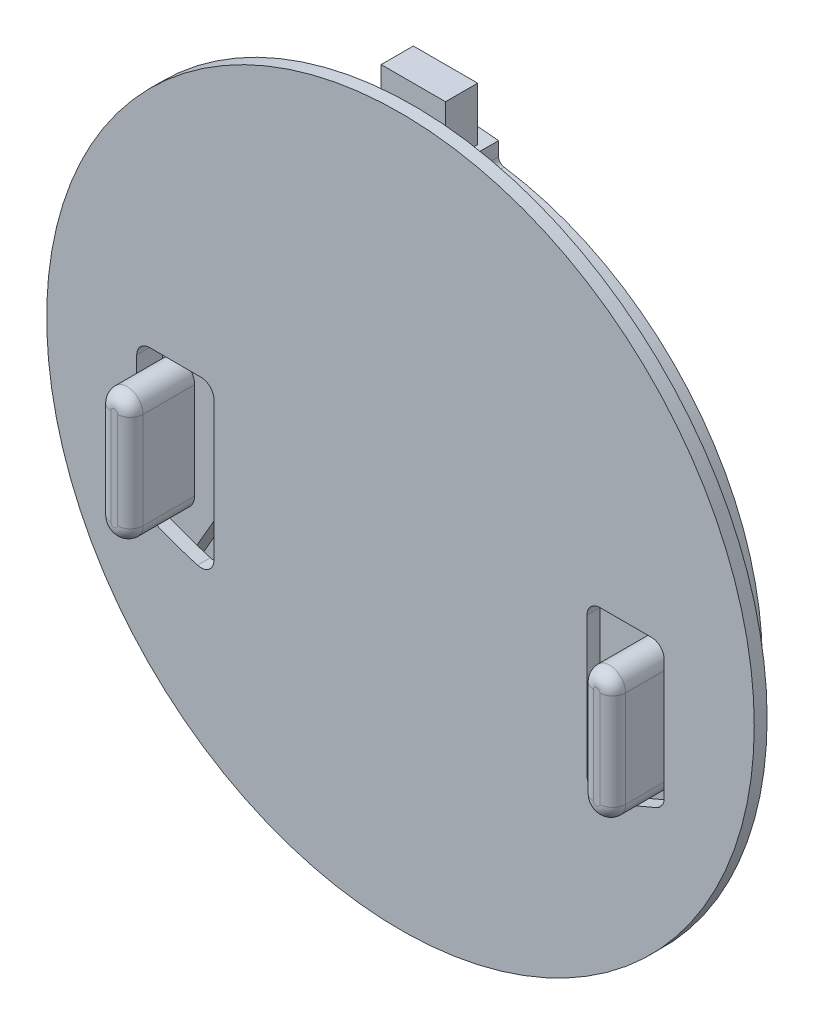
ISO-10303-21;
HEADER;
FILE_DESCRIPTION(('STEP AP214'),'2;1');
FILE_NAME('part.step','',(''),(''),'','','');
FILE_SCHEMA(('AUTOMOTIVE_DESIGN { 1 0 10303 214 1 1 1 1 }'));
ENDSEC;
DATA;
#1=APPLICATION_CONTEXT('core data for automotive mechanical design processes');
#2=APPLICATION_PROTOCOL_DEFINITION('international standard','automotive_design',2000,#1);
#3=PRODUCT_CONTEXT('',#1,'mechanical');
#4=PRODUCT('Part','Part','',(#3));
#5=PRODUCT_RELATED_PRODUCT_CATEGORY('part','',(#4));
#6=PRODUCT_DEFINITION_FORMATION('','',#4);
#7=PRODUCT_DEFINITION_CONTEXT('part definition',#1,'design');
#8=PRODUCT_DEFINITION('design','',#6,#7);
#9=PRODUCT_DEFINITION_SHAPE('','',#8);
#10=(LENGTH_UNIT() NAMED_UNIT(*) SI_UNIT(.MILLI.,.METRE.));
#11=(NAMED_UNIT(*) PLANE_ANGLE_UNIT() SI_UNIT($,.RADIAN.));
#12=(NAMED_UNIT(*) SI_UNIT($,.STERADIAN.) SOLID_ANGLE_UNIT());
#13=UNCERTAINTY_MEASURE_WITH_UNIT(LENGTH_MEASURE(1.E-05),#10,'distance_accuracy_value','');
#14=(GEOMETRIC_REPRESENTATION_CONTEXT(3) GLOBAL_UNCERTAINTY_ASSIGNED_CONTEXT((#13)) GLOBAL_UNIT_ASSIGNED_CONTEXT((#10,
#11,#12)) REPRESENTATION_CONTEXT('',''));
#15=CARTESIAN_POINT('',(0.,0.,0.));
#16=DIRECTION('',(0.,0.,1.));
#17=DIRECTION('',(1.,0.,0.));
#18=AXIS2_PLACEMENT_3D('',#15,#16,#17);
#19=CARTESIAN_POINT('',(-5.,58.,-5.));
#20=DIRECTION('',(1.,0.,0.));
#21=DIRECTION('',(0.,0.,-1.));
#22=AXIS2_PLACEMENT_3D('',#19,#20,#21);
#23=PLANE('',#22);
#24=DIRECTION('',(0.,0.,1.));
#25=VECTOR('',#24,1.);
#26=CARTESIAN_POINT('',(-5.,0.,-5.));
#27=LINE('',#26,#25);
#28=CARTESIAN_POINT('',(-5.,0.,-5.));
#29=VERTEX_POINT('',#28);
#30=CARTESIAN_POINT('',(-5.,0.,0.));
#31=VERTEX_POINT('',#30);
#32=EDGE_CURVE('E458',#29,#31,#27,.T.);
#33=ORIENTED_EDGE('',*,*,#32,.T.);
#34=DIRECTION('',(0.,-1.,0.));
#35=VECTOR('',#34,1.);
#36=CARTESIAN_POINT('',(-5.,58.,0.));
#37=LINE('',#36,#35);
#38=CARTESIAN_POINT('',(-5.,58.,0.));
#39=VERTEX_POINT('',#38);
#40=EDGE_CURVE('E13',#39,#31,#37,.T.);
#41=ORIENTED_EDGE('',*,*,#40,.F.);
#42=DIRECTION('',(0.,0.,1.));
#43=VECTOR('',#42,1.);
#44=CARTESIAN_POINT('',(-5.,58.,-5.));
#45=LINE('',#44,#43);
#46=CARTESIAN_POINT('',(-5.,58.,-5.));
#47=VERTEX_POINT('',#46);
#48=EDGE_CURVE('E446',#47,#39,#45,.T.);
#49=ORIENTED_EDGE('',*,*,#48,.F.);
#50=DIRECTION('',(0.,-1.,0.));
#51=VECTOR('',#50,1.);
#52=CARTESIAN_POINT('',(-5.,58.,-5.));
#53=LINE('',#52,#51);
#54=EDGE_CURVE('E454',#47,#29,#53,.T.);
#55=ORIENTED_EDGE('',*,*,#54,.T.);
#56=EDGE_LOOP('',(#33,#41,#49,#55));
#57=FACE_BOUND('',#56,.T.);
#58=ADVANCED_FACE('F395',(#57),#23,.F.);
#59=CARTESIAN_POINT('',(-5.,58.,0.));
#60=DIRECTION('',(0.,0.,-1.));
#61=DIRECTION('',(-1.,0.,0.));
#62=AXIS2_PLACEMENT_3D('',#59,#60,#61);
#63=PLANE('',#62);
#64=DIRECTION('',(1.,0.,0.));
#65=VECTOR('',#64,1.);
#66=CARTESIAN_POINT('',(-5.,0.,0.));
#67=LINE('',#66,#65);
#68=CARTESIAN_POINT('',(5.,0.,0.));
#69=VERTEX_POINT('',#68);
#70=EDGE_CURVE('E450',#31,#69,#67,.T.);
#71=ORIENTED_EDGE('',*,*,#70,.T.);
#72=DIRECTION('',(0.,-1.,0.));
#73=VECTOR('',#72,1.);
#74=CARTESIAN_POINT('',(5.,58.,0.));
#75=LINE('',#74,#73);
#76=CARTESIAN_POINT('',(5.,58.,0.));
#77=VERTEX_POINT('',#76);
#78=EDGE_CURVE('E403',#77,#69,#75,.T.);
#79=ORIENTED_EDGE('',*,*,#78,.F.);
#80=DIRECTION('',(1.,0.,0.));
#81=VECTOR('',#80,1.);
#82=CARTESIAN_POINT('',(-5.,58.,0.));
#83=LINE('',#82,#81);
#84=EDGE_CURVE('E441',#39,#77,#83,.T.);
#85=ORIENTED_EDGE('',*,*,#84,.F.);
#86=ORIENTED_EDGE('',*,*,#40,.T.);
#87=EDGE_LOOP('',(#71,#79,#85,#86));
#88=FACE_BOUND('',#87,.T.);
#89=ADVANCED_FACE('F449',(#88),#63,.F.);
#90=CARTESIAN_POINT('',(5.,58.,-5.));
#91=DIRECTION('',(-1.,0.,0.));
#92=DIRECTION('',(0.,0.,1.));
#93=AXIS2_PLACEMENT_3D('',#90,#91,#92);
#94=PLANE('',#93);
#95=DIRECTION('',(0.,0.,-1.));
#96=VECTOR('',#95,1.);
#97=CARTESIAN_POINT('',(5.,0.,-5.));
#98=LINE('',#97,#96);
#99=CARTESIAN_POINT('',(5.,0.,-5.));
#100=VERTEX_POINT('',#99);
#101=EDGE_CURVE('E428',#69,#100,#98,.T.);
#102=ORIENTED_EDGE('',*,*,#101,.T.);
#103=DIRECTION('',(0.,-1.,0.));
#104=VECTOR('',#103,1.);
#105=CARTESIAN_POINT('',(5.,58.,-5.));
#106=LINE('',#105,#104);
#107=CARTESIAN_POINT('',(5.,58.,-5.));
#108=VERTEX_POINT('',#107);
#109=EDGE_CURVE('E451',#108,#100,#106,.T.);
#110=ORIENTED_EDGE('',*,*,#109,.F.);
#111=DIRECTION('',(0.,0.,-1.));
#112=VECTOR('',#111,1.);
#113=CARTESIAN_POINT('',(5.,58.,-5.));
#114=LINE('',#113,#112);
#115=EDGE_CURVE('E444',#77,#108,#114,.T.);
#116=ORIENTED_EDGE('',*,*,#115,.F.);
#117=ORIENTED_EDGE('',*,*,#78,.T.);
#118=EDGE_LOOP('',(#102,#110,#116,#117));
#119=FACE_BOUND('',#118,.T.);
#120=ADVANCED_FACE('F452',(#119),#94,.F.);
#121=CARTESIAN_POINT('',(-5.,58.,-5.));
#122=DIRECTION('',(0.,0.,1.));
#123=DIRECTION('',(1.,0.,0.));
#124=AXIS2_PLACEMENT_3D('',#121,#122,#123);
#125=PLANE('',#124);
#126=DIRECTION('',(-1.,0.,0.));
#127=VECTOR('',#126,1.);
#128=CARTESIAN_POINT('',(-5.,0.,-5.));
#129=LINE('',#128,#127);
#130=EDGE_CURVE('E434',#100,#29,#129,.T.);
#131=ORIENTED_EDGE('',*,*,#130,.T.);
#132=ORIENTED_EDGE('',*,*,#54,.F.);
#133=DIRECTION('',(-1.,0.,0.));
#134=VECTOR('',#133,1.);
#135=CARTESIAN_POINT('',(-5.,58.,-5.));
#136=LINE('',#135,#134);
#137=EDGE_CURVE('E411',#108,#47,#136,.T.);
#138=ORIENTED_EDGE('',*,*,#137,.F.);
#139=ORIENTED_EDGE('',*,*,#109,.T.);
#140=EDGE_LOOP('',(#131,#132,#138,#139));
#141=FACE_BOUND('',#140,.T.);
#142=ADVANCED_FACE('F465',(#141),#125,.F.);
#143=CARTESIAN_POINT('',(0.,58.,0.));
#144=DIRECTION('',(0.,1.,0.));
#145=DIRECTION('',(0.,0.,1.));
#146=AXIS2_PLACEMENT_3D('',#143,#144,#145);
#147=PLANE('',#146);
#148=ORIENTED_EDGE('',*,*,#48,.T.);
#149=ORIENTED_EDGE('',*,*,#84,.T.);
#150=ORIENTED_EDGE('',*,*,#115,.T.);
#151=ORIENTED_EDGE('',*,*,#137,.T.);
#152=EDGE_LOOP('',(#148,#149,#150,#151));
#153=FACE_BOUND('',#152,.T.);
#154=ADVANCED_FACE('F442',(#153),#147,.T.);
#155=CARTESIAN_POINT('',(0.,0.,0.));
#156=DIRECTION('',(0.,1.,0.));
#157=DIRECTION('',(0.,0.,1.));
#158=AXIS2_PLACEMENT_3D('',#155,#156,#157);
#159=PLANE('',#158);
#160=ORIENTED_EDGE('',*,*,#32,.F.);
#161=ORIENTED_EDGE('',*,*,#130,.F.);
#162=ORIENTED_EDGE('',*,*,#101,.F.);
#163=ORIENTED_EDGE('',*,*,#70,.F.);
#164=EDGE_LOOP('',(#160,#161,#162,#163));
#165=FACE_BOUND('',#164,.T.);
#166=ADVANCED_FACE('F468',(#165),#159,.F.);
#167=CLOSED_SHELL('',(#58,#89,#120,#142,#154,#166));
#168=MANIFOLD_SOLID_BREP('B2_NOT_SHOWN',#167);
#169=CARTESIAN_POINT('',(0.,0.,0.));
#170=DIRECTION('',(0.,0.,1.));
#171=DIRECTION('',(1.,0.,0.));
#172=AXIS2_PLACEMENT_3D('',#169,#170,#171);
#173=PLANE('',#172);
#174=CARTESIAN_POINT('',(0.,0.,0.));
#175=DIRECTION('',(0.,0.,1.));
#176=DIRECTION('',(1.,0.,0.));
#177=AXIS2_PLACEMENT_3D('',#174,#175,#176);
#178=CIRCLE('',#177,55.);
#179=CARTESIAN_POINT('',(55.,0.,0.));
#180=VERTEX_POINT('',#179);
#181=EDGE_CURVE('E2101',#180,#180,#178,.T.);
#182=ORIENTED_EDGE('',*,*,#181,.F.);
#183=EDGE_LOOP('',(#182));
#184=FACE_BOUND('',#183,.T.);
#185=CARTESIAN_POINT('',(-15.,36.,0.));
#186=DIRECTION('',(0.,0.,1.));
#187=DIRECTION('',(1.,0.,0.));
#188=AXIS2_PLACEMENT_3D('',#185,#186,#187);
#189=CIRCLE('',#188,5.);
#190=CARTESIAN_POINT('',(-10.,36.,0.));
#191=VERTEX_POINT('',#190);
#192=EDGE_CURVE('E2106',#191,#191,#189,.F.);
#193=ORIENTED_EDGE('',*,*,#192,.F.);
#194=EDGE_LOOP('',(#193));
#195=FACE_BOUND('',#194,.T.);
#196=CARTESIAN_POINT('',(15.,36.,0.));
#197=DIRECTION('',(0.,0.,1.));
#198=DIRECTION('',(1.,0.,0.));
#199=AXIS2_PLACEMENT_3D('',#196,#197,#198);
#200=CIRCLE('',#199,5.);
#201=CARTESIAN_POINT('',(20.,36.,0.));
#202=VERTEX_POINT('',#201);
#203=EDGE_CURVE('E2113',#202,#202,#200,.F.);
#204=ORIENTED_EDGE('',*,*,#203,.F.);
#205=EDGE_LOOP('',(#204));
#206=FACE_BOUND('',#205,.T.);
#207=CARTESIAN_POINT('',(-25.,8.,0.));
#208=DIRECTION('',(0.,0.,1.));
#209=DIRECTION('',(1.,0.,0.));
#210=AXIS2_PLACEMENT_3D('',#207,#208,#209);
#211=CIRCLE('',#210,5.);
#212=CARTESIAN_POINT('',(-20.,8.,0.));
#213=VERTEX_POINT('',#212);
#214=EDGE_CURVE('E2117',#213,#213,#211,.F.);
#215=ORIENTED_EDGE('',*,*,#214,.F.);
#216=EDGE_LOOP('',(#215));
#217=FACE_BOUND('',#216,.T.);
#218=CARTESIAN_POINT('',(25.,8.,0.));
#219=DIRECTION('',(0.,0.,1.));
#220=DIRECTION('',(1.,0.,0.));
#221=AXIS2_PLACEMENT_3D('',#218,#219,#220);
#222=CIRCLE('',#221,5.);
#223=CARTESIAN_POINT('',(30.,8.,0.));
#224=VERTEX_POINT('',#223);
#225=EDGE_CURVE('E2121',#224,#224,#222,.F.);
#226=ORIENTED_EDGE('',*,*,#225,.F.);
#227=EDGE_LOOP('',(#226));
#228=FACE_BOUND('',#227,.T.);
#229=CARTESIAN_POINT('',(0.,0.,0.));
#230=DIRECTION('',(0.,0.,1.));
#231=DIRECTION('',(1.,0.,0.));
#232=AXIS2_PLACEMENT_3D('',#229,#230,#231);
#233=CIRCLE('',#232,43.4432577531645);
#234=CARTESIAN_POINT('',(-41.,-14.3637266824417,0.));
#235=VERTEX_POINT('',#234);
#236=CARTESIAN_POINT('',(-26.1461367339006,34.6943248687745,0.));
#237=VERTEX_POINT('',#236);
#238=EDGE_CURVE('E1785',#235,#237,#233,.F.);
#239=ORIENTED_EDGE('',*,*,#238,.F.);
#240=DIRECTION('',(0.,1.,0.));
#241=VECTOR('',#240,1.);
#242=CARTESIAN_POINT('',(-41.,1.9048596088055,0.));
#243=LINE('',#242,#241);
#244=CARTESIAN_POINT('',(-41.,-16.8015151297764,0.));
#245=VERTEX_POINT('',#244);
#246=EDGE_CURVE('E1370',#245,#235,#243,.T.);
#247=ORIENTED_EDGE('',*,*,#246,.F.);
#248=CARTESIAN_POINT('',(-39.,-16.8015151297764,0.));
#249=DIRECTION('',(0.,0.,1.));
#250=DIRECTION('',(1.,0.,0.));
#251=AXIS2_PLACEMENT_3D('',#248,#249,#250);
#252=CIRCLE('',#251,2.);
#253=CARTESIAN_POINT('',(-39.8275862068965,-18.6222570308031,0.));
#254=VERTEX_POINT('',#253);
#255=EDGE_CURVE('E1407',#254,#245,#252,.F.);
#256=ORIENTED_EDGE('',*,*,#255,.F.);
#257=CARTESIAN_POINT('',(-15.,36.,0.));
#258=DIRECTION('',(0.,0.,1.));
#259=DIRECTION('',(1.,0.,0.));
#260=AXIS2_PLACEMENT_3D('',#257,#258,#259);
#261=CIRCLE('',#260,60.);
#262=CARTESIAN_POINT('',(-31.551724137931,-21.6718339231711,0.));
#263=VERTEX_POINT('',#262);
#264=EDGE_CURVE('E1411',#263,#254,#261,.F.);
#265=ORIENTED_EDGE('',*,*,#264,.F.);
#266=CARTESIAN_POINT('',(-31.,-19.7494394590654,0.));
#267=DIRECTION('',(0.,0.,1.));
#268=DIRECTION('',(1.,0.,0.));
#269=AXIS2_PLACEMENT_3D('',#266,#267,#268);
#270=CIRCLE('',#269,2.);
#271=CARTESIAN_POINT('',(-29.,-19.7494394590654,0.));
#272=VERTEX_POINT('',#271);
#273=EDGE_CURVE('E1415',#272,#263,#270,.F.);
#274=ORIENTED_EDGE('',*,*,#273,.F.);
#275=DIRECTION('',(0.,-1.,0.));
#276=VECTOR('',#275,1.);
#277=CARTESIAN_POINT('',(-29.,1.90485960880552,0.));
#278=LINE('',#277,#276);
#279=CARTESIAN_POINT('',(-29.,1.90485960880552,0.));
#280=VERTEX_POINT('',#279);
#281=EDGE_CURVE('E1419',#280,#272,#278,.T.);
#282=ORIENTED_EDGE('',*,*,#281,.F.);
#283=CARTESIAN_POINT('',(-31.,1.90485960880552,0.));
#284=DIRECTION('',(0.,0.,1.));
#285=DIRECTION('',(1.,0.,0.));
#286=AXIS2_PLACEMENT_3D('',#283,#284,#285);
#287=CIRCLE('',#286,2.);
#288=CARTESIAN_POINT('',(-31.,3.90485960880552,0.));
#289=VERTEX_POINT('',#288);
#290=EDGE_CURVE('E1423',#289,#280,#287,.F.);
#291=ORIENTED_EDGE('',*,*,#290,.F.);
#292=DIRECTION('',(1.,0.,0.));
#293=VECTOR('',#292,1.);
#294=CARTESIAN_POINT('',(-39.,3.90485960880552,0.));
#295=LINE('',#294,#293);
#296=CARTESIAN_POINT('',(-39.,3.90485960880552,0.));
#297=VERTEX_POINT('',#296);
#298=EDGE_CURVE('E1427',#297,#289,#295,.T.);
#299=ORIENTED_EDGE('',*,*,#298,.F.);
#300=CARTESIAN_POINT('',(-39.,1.90485960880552,0.));
#301=DIRECTION('',(0.,0.,1.));
#302=DIRECTION('',(1.,0.,0.));
#303=AXIS2_PLACEMENT_3D('',#300,#301,#302);
#304=CIRCLE('',#303,2.);
#305=CARTESIAN_POINT('',(-41.,1.9048596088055,0.));
#306=VERTEX_POINT('',#305);
#307=EDGE_CURVE('E1431',#306,#297,#304,.F.);
#308=ORIENTED_EDGE('',*,*,#307,.F.);
#309=DIRECTION('',(0.,-1.,0.));
#310=VECTOR('',#309,1.);
#311=CARTESIAN_POINT('',(-41.,0.,0.));
#312=LINE('',#311,#310);
#313=CARTESIAN_POINT('',(-41.,6.28718707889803,0.));
#314=VERTEX_POINT('',#313);
#315=EDGE_CURVE('E1759',#314,#306,#312,.T.);
#316=ORIENTED_EDGE('',*,*,#315,.F.);
#317=CARTESIAN_POINT('',(-31.,6.28718707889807,0.));
#318=DIRECTION('',(0.,0.,1.));
#319=DIRECTION('',(1.,0.,0.));
#320=AXIS2_PLACEMENT_3D('',#317,#318,#319);
#321=CIRCLE('',#320,10.);
#322=CARTESIAN_POINT('',(-39.6602540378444,11.2871870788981,0.));
#323=VERTEX_POINT('',#322);
#324=EDGE_CURVE('E1597',#314,#323,#321,.F.);
#325=ORIENTED_EDGE('',*,*,#324,.T.);
#326=DIRECTION('',(-0.5,-0.866025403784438,0.));
#327=VECTOR('',#326,1.);
#328=CARTESIAN_POINT('',(-34.6326859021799,19.9951905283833,0.));
#329=LINE('',#328,#327);
#330=EDGE_CURVE('E1779',#237,#323,#329,.T.);
#331=ORIENTED_EDGE('',*,*,#330,.F.);
#332=EDGE_LOOP('',(#239,#247,#256,#265,#274,#282,#291,#299,#308,#316,#325,#331));
#333=FACE_BOUND('',#332,.T.);
#334=CARTESIAN_POINT('',(4.,44.,0.));
#335=DIRECTION('',(0.,0.,1.));
#336=DIRECTION('',(1.,0.,0.));
#337=AXIS2_PLACEMENT_3D('',#334,#335,#336);
#338=CIRCLE('',#337,2.);
#339=CARTESIAN_POINT('',(6.,44.,0.));
#340=VERTEX_POINT('',#339);
#341=CARTESIAN_POINT('',(3.99999999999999,42.,0.));
#342=VERTEX_POINT('',#341);
#343=EDGE_CURVE('E1611',#340,#342,#338,.F.);
#344=ORIENTED_EDGE('',*,*,#343,.F.);
#345=DIRECTION('',(0.,-1.,0.));
#346=VECTOR('',#345,1.);
#347=CARTESIAN_POINT('',(6.00000000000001,0.,0.));
#348=LINE('',#347,#346);
#349=CARTESIAN_POINT('',(6.,49.6386945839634,0.));
#350=VERTEX_POINT('',#349);
#351=EDGE_CURVE('E1606',#350,#340,#348,.T.);
#352=ORIENTED_EDGE('',*,*,#351,.F.);
#353=CARTESIAN_POINT('',(0.,0.,0.));
#354=DIRECTION('',(0.,0.,1.));
#355=DIRECTION('',(1.,0.,0.));
#356=AXIS2_PLACEMENT_3D('',#353,#354,#355);
#357=CIRCLE('',#356,50.);
#358=CARTESIAN_POINT('',(-6.,49.6386945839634,0.));
#359=VERTEX_POINT('',#358);
#360=EDGE_CURVE('E1132',#359,#350,#357,.F.);
#361=ORIENTED_EDGE('',*,*,#360,.F.);
#362=DIRECTION('',(0.,-1.,0.));
#363=VECTOR('',#362,1.);
#364=CARTESIAN_POINT('',(-6.00000000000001,0.,0.));
#365=LINE('',#364,#363);
#366=CARTESIAN_POINT('',(-6.,44.,0.));
#367=VERTEX_POINT('',#366);
#368=EDGE_CURVE('E1667',#359,#367,#365,.T.);
#369=ORIENTED_EDGE('',*,*,#368,.T.);
#370=CARTESIAN_POINT('',(-4.,44.,0.));
#371=DIRECTION('',(0.,0.,1.));
#372=DIRECTION('',(1.,0.,0.));
#373=AXIS2_PLACEMENT_3D('',#370,#371,#372);
#374=CIRCLE('',#373,2.);
#375=CARTESIAN_POINT('',(-3.99999999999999,42.,0.));
#376=VERTEX_POINT('',#375);
#377=EDGE_CURVE('E1672',#367,#376,#374,.T.);
#378=ORIENTED_EDGE('',*,*,#377,.T.);
#379=DIRECTION('',(1.,0.,0.));
#380=VECTOR('',#379,1.);
#381=CARTESIAN_POINT('',(0.,42.,0.));
#382=LINE('',#381,#380);
#383=CARTESIAN_POINT('',(-2.99999999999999,42.,0.));
#384=VERTEX_POINT('',#383);
#385=EDGE_CURVE('E1676',#376,#384,#382,.T.);
#386=ORIENTED_EDGE('',*,*,#385,.T.);
#387=DIRECTION('',(0.,-1.,0.));
#388=VECTOR('',#387,1.);
#389=CARTESIAN_POINT('',(-3.,0.,0.));
#390=LINE('',#389,#388);
#391=CARTESIAN_POINT('',(-3.,23.3205080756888,0.));
#392=VERTEX_POINT('',#391);
#393=EDGE_CURVE('E1680',#384,#392,#390,.T.);
#394=ORIENTED_EDGE('',*,*,#393,.T.);
#395=CARTESIAN_POINT('',(-5.,23.3205080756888,0.));
#396=DIRECTION('',(0.,0.,1.));
#397=DIRECTION('',(1.,0.,0.));
#398=AXIS2_PLACEMENT_3D('',#395,#396,#397);
#399=CIRCLE('',#398,2.);
#400=CARTESIAN_POINT('',(-3.26794919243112,22.3205080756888,0.));
#401=VERTEX_POINT('',#400);
#402=EDGE_CURVE('E1684',#392,#401,#399,.F.);
#403=ORIENTED_EDGE('',*,*,#402,.T.);
#404=DIRECTION('',(-0.5,-0.866025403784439,0.));
#405=VECTOR('',#404,1.);
#406=CARTESIAN_POINT('',(-12.1160254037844,6.99519052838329,0.));
#407=LINE('',#406,#405);
#408=CARTESIAN_POINT('',(-31.9514380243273,-27.3607519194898,0.));
#409=VERTEX_POINT('',#408);
#410=EDGE_CURVE('E1688',#401,#409,#407,.T.);
#411=ORIENTED_EDGE('',*,*,#410,.T.);
#412=CARTESIAN_POINT('',(-30.2193872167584,-28.3607519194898,0.));
#413=DIRECTION('',(0.,0.,1.));
#414=DIRECTION('',(1.,0.,0.));
#415=AXIS2_PLACEMENT_3D('',#412,#413,#414);
#416=CIRCLE('',#415,2.00000000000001);
#417=CARTESIAN_POINT('',(-31.6777372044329,-29.7294064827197,0.));
#418=VERTEX_POINT('',#417);
#419=EDGE_CURVE('E1552',#409,#418,#416,.T.);
#420=ORIENTED_EDGE('',*,*,#419,.T.);
#421=CARTESIAN_POINT('',(0.,0.,0.));
#422=DIRECTION('',(0.,0.,1.));
#423=DIRECTION('',(1.,0.,0.));
#424=AXIS2_PLACEMENT_3D('',#421,#422,#423);
#425=CIRCLE('',#424,43.4432577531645);
#426=CARTESIAN_POINT('',(31.6777372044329,-29.7294064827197,0.));
#427=VERTEX_POINT('',#426);
#428=EDGE_CURVE('E1641',#427,#418,#425,.F.);
#429=ORIENTED_EDGE('',*,*,#428,.F.);
#430=CARTESIAN_POINT('',(30.2193872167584,-28.3607519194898,0.));
#431=DIRECTION('',(0.,0.,1.));
#432=DIRECTION('',(1.,0.,0.));
#433=AXIS2_PLACEMENT_3D('',#430,#431,#432);
#434=CIRCLE('',#433,2.);
#435=CARTESIAN_POINT('',(31.9514380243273,-27.3607519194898,0.));
#436=VERTEX_POINT('',#435);
#437=EDGE_CURVE('E1636',#436,#427,#434,.F.);
#438=ORIENTED_EDGE('',*,*,#437,.F.);
#439=DIRECTION('',(0.5,-0.866025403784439,0.));
#440=VECTOR('',#439,1.);
#441=CARTESIAN_POINT('',(12.1160254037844,6.99519052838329,0.));
#442=LINE('',#441,#440);
#443=CARTESIAN_POINT('',(3.26794919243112,22.3205080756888,0.));
#444=VERTEX_POINT('',#443);
#445=EDGE_CURVE('E1631',#444,#436,#442,.T.);
#446=ORIENTED_EDGE('',*,*,#445,.F.);
#447=CARTESIAN_POINT('',(5.,23.3205080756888,0.));
#448=DIRECTION('',(0.,0.,1.));
#449=DIRECTION('',(1.,0.,0.));
#450=AXIS2_PLACEMENT_3D('',#447,#448,#449);
#451=CIRCLE('',#450,2.);
#452=CARTESIAN_POINT('',(3.,23.3205080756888,0.));
#453=VERTEX_POINT('',#452);
#454=EDGE_CURVE('E1626',#453,#444,#451,.T.);
#455=ORIENTED_EDGE('',*,*,#454,.F.);
#456=DIRECTION('',(0.,-1.,0.));
#457=VECTOR('',#456,1.);
#458=CARTESIAN_POINT('',(3.,0.,0.));
#459=LINE('',#458,#457);
#460=CARTESIAN_POINT('',(2.99999999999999,42.,0.));
#461=VERTEX_POINT('',#460);
#462=EDGE_CURVE('E1621',#461,#453,#459,.T.);
#463=ORIENTED_EDGE('',*,*,#462,.F.);
#464=DIRECTION('',(-1.,0.,0.));
#465=VECTOR('',#464,1.);
#466=CARTESIAN_POINT('',(0.,42.,0.));
#467=LINE('',#466,#465);
#468=EDGE_CURVE('E1616',#342,#461,#467,.T.);
#469=ORIENTED_EDGE('',*,*,#468,.F.);
#470=EDGE_LOOP('',(#344,#352,#361,#369,#378,#386,#394,#403,#411,#420,#429,#438,#446,#455,#463,#469));
#471=FACE_BOUND('',#470,.T.);
#472=DIRECTION('',(0.,1.,0.));
#473=VECTOR('',#472,1.);
#474=CARTESIAN_POINT('',(41.,1.9048596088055,0.));
#475=LINE('',#474,#473);
#476=CARTESIAN_POINT('',(41.,-16.8015151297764,0.));
#477=VERTEX_POINT('',#476);
#478=CARTESIAN_POINT('',(41.,-14.3637266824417,0.));
#479=VERTEX_POINT('',#478);
#480=EDGE_CURVE('E1336',#477,#479,#475,.T.);
#481=ORIENTED_EDGE('',*,*,#480,.T.);
#482=CARTESIAN_POINT('',(0.,0.,0.));
#483=DIRECTION('',(0.,0.,1.));
#484=DIRECTION('',(1.,0.,0.));
#485=AXIS2_PLACEMENT_3D('',#482,#483,#484);
#486=CIRCLE('',#485,43.4432577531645);
#487=CARTESIAN_POINT('',(26.1461367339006,34.6943248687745,0.));
#488=VERTEX_POINT('',#487);
#489=EDGE_CURVE('E1574',#479,#488,#486,.T.);
#490=ORIENTED_EDGE('',*,*,#489,.T.);
#491=DIRECTION('',(0.5,-0.866025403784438,0.));
#492=VECTOR('',#491,1.);
#493=CARTESIAN_POINT('',(34.6326859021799,19.9951905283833,0.));
#494=LINE('',#493,#492);
#495=CARTESIAN_POINT('',(39.6602540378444,11.2871870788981,0.));
#496=VERTEX_POINT('',#495);
#497=EDGE_CURVE('E1547',#488,#496,#494,.T.);
#498=ORIENTED_EDGE('',*,*,#497,.T.);
#499=CARTESIAN_POINT('',(31.,6.28718707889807,0.));
#500=DIRECTION('',(0.,0.,1.));
#501=DIRECTION('',(1.,0.,0.));
#502=AXIS2_PLACEMENT_3D('',#499,#500,#501);
#503=CIRCLE('',#502,10.);
#504=CARTESIAN_POINT('',(41.,6.28718707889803,0.));
#505=VERTEX_POINT('',#504);
#506=EDGE_CURVE('E1563',#505,#496,#503,.T.);
#507=ORIENTED_EDGE('',*,*,#506,.F.);
#508=DIRECTION('',(0.,-1.,0.));
#509=VECTOR('',#508,1.);
#510=CARTESIAN_POINT('',(41.,0.,0.));
#511=LINE('',#510,#509);
#512=CARTESIAN_POINT('',(41.,1.90485960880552,0.));
#513=VERTEX_POINT('',#512);
#514=EDGE_CURVE('E1569',#505,#513,#511,.T.);
#515=ORIENTED_EDGE('',*,*,#514,.T.);
#516=CARTESIAN_POINT('',(39.,1.90485960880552,0.));
#517=DIRECTION('',(0.,0.,1.));
#518=DIRECTION('',(1.,0.,0.));
#519=AXIS2_PLACEMENT_3D('',#516,#517,#518);
#520=CIRCLE('',#519,2.);
#521=CARTESIAN_POINT('',(39.,3.90485960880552,0.));
#522=VERTEX_POINT('',#521);
#523=EDGE_CURVE('E1339',#513,#522,#520,.T.);
#524=ORIENTED_EDGE('',*,*,#523,.T.);
#525=DIRECTION('',(-1.,0.,0.));
#526=VECTOR('',#525,1.);
#527=CARTESIAN_POINT('',(39.,3.90485960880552,0.));
#528=LINE('',#527,#526);
#529=CARTESIAN_POINT('',(31.,3.90485960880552,0.));
#530=VERTEX_POINT('',#529);
#531=EDGE_CURVE('E1392',#522,#530,#528,.T.);
#532=ORIENTED_EDGE('',*,*,#531,.T.);
#533=CARTESIAN_POINT('',(31.,1.90485960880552,0.));
#534=DIRECTION('',(0.,0.,1.));
#535=DIRECTION('',(1.,0.,0.));
#536=AXIS2_PLACEMENT_3D('',#533,#534,#535);
#537=CIRCLE('',#536,2.);
#538=CARTESIAN_POINT('',(29.,1.90485960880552,0.));
#539=VERTEX_POINT('',#538);
#540=EDGE_CURVE('E1364',#530,#539,#537,.T.);
#541=ORIENTED_EDGE('',*,*,#540,.T.);
#542=DIRECTION('',(0.,-1.,0.));
#543=VECTOR('',#542,1.);
#544=CARTESIAN_POINT('',(29.,1.90485960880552,0.));
#545=LINE('',#544,#543);
#546=CARTESIAN_POINT('',(29.,-19.7494394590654,0.));
#547=VERTEX_POINT('',#546);
#548=EDGE_CURVE('E1323',#539,#547,#545,.T.);
#549=ORIENTED_EDGE('',*,*,#548,.T.);
#550=CARTESIAN_POINT('',(31.,-19.7494394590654,0.));
#551=DIRECTION('',(0.,0.,1.));
#552=DIRECTION('',(1.,0.,0.));
#553=AXIS2_PLACEMENT_3D('',#550,#551,#552);
#554=CIRCLE('',#553,2.);
#555=CARTESIAN_POINT('',(31.551724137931,-21.6718339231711,0.));
#556=VERTEX_POINT('',#555);
#557=EDGE_CURVE('E1328',#547,#556,#554,.T.);
#558=ORIENTED_EDGE('',*,*,#557,.T.);
#559=CARTESIAN_POINT('',(15.,36.,0.));
#560=DIRECTION('',(0.,0.,1.));
#561=DIRECTION('',(1.,0.,0.));
#562=AXIS2_PLACEMENT_3D('',#559,#560,#561);
#563=CIRCLE('',#562,60.);
#564=CARTESIAN_POINT('',(39.8275862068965,-18.6222570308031,0.));
#565=VERTEX_POINT('',#564);
#566=EDGE_CURVE('E1351',#556,#565,#563,.T.);
#567=ORIENTED_EDGE('',*,*,#566,.T.);
#568=CARTESIAN_POINT('',(39.,-16.8015151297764,0.));
#569=DIRECTION('',(0.,0.,1.));
#570=DIRECTION('',(1.,0.,0.));
#571=AXIS2_PLACEMENT_3D('',#568,#569,#570);
#572=CIRCLE('',#571,2.);
#573=EDGE_CURVE('E1333',#565,#477,#572,.T.);
#574=ORIENTED_EDGE('',*,*,#573,.T.);
#575=EDGE_LOOP('',(#481,#490,#498,#507,#515,#524,#532,#541,#549,#558,#567,#574));
#576=FACE_BOUND('',#575,.T.);
#577=ADVANCED_FACE('F531',(#184,#195,#206,#217,#228,#333,#471,#576),#173,.F.);
#578=CARTESIAN_POINT('',(0.,0.,2.));
#579=DIRECTION('',(0.,0.,1.));
#580=DIRECTION('',(1.,0.,0.));
#581=AXIS2_PLACEMENT_3D('',#578,#579,#580);
#582=PLANE('',#581);
#583=CARTESIAN_POINT('',(0.,0.,2.));
#584=DIRECTION('',(0.,0.,1.));
#585=DIRECTION('',(1.,0.,0.));
#586=AXIS2_PLACEMENT_3D('',#583,#584,#585);
#587=CIRCLE('',#586,55.);
#588=CARTESIAN_POINT('',(55.,0.,2.));
#589=VERTEX_POINT('',#588);
#590=EDGE_CURVE('E2102',#589,#589,#587,.T.);
#591=ORIENTED_EDGE('',*,*,#590,.T.);
#592=EDGE_LOOP('',(#591));
#593=FACE_BOUND('',#592,.T.);
#594=DIRECTION('',(0.,-1.,0.));
#595=VECTOR('',#594,1.);
#596=CARTESIAN_POINT('',(-41.,1.9048596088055,2.));
#597=LINE('',#596,#595);
#598=CARTESIAN_POINT('',(-41.,1.9048596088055,2.));
#599=VERTEX_POINT('',#598);
#600=CARTESIAN_POINT('',(-41.,-16.8015151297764,2.));
#601=VERTEX_POINT('',#600);
#602=EDGE_CURVE('E1439',#599,#601,#597,.T.);
#603=ORIENTED_EDGE('',*,*,#602,.F.);
#604=CARTESIAN_POINT('',(-39.,1.90485960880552,2.));
#605=DIRECTION('',(0.,0.,1.));
#606=DIRECTION('',(1.,0.,0.));
#607=AXIS2_PLACEMENT_3D('',#604,#605,#606);
#608=CIRCLE('',#607,2.);
#609=CARTESIAN_POINT('',(-39.,3.90485960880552,2.));
#610=VERTEX_POINT('',#609);
#611=EDGE_CURVE('E1435',#610,#599,#608,.T.);
#612=ORIENTED_EDGE('',*,*,#611,.F.);
#613=DIRECTION('',(-1.,0.,0.));
#614=VECTOR('',#613,1.);
#615=CARTESIAN_POINT('',(-39.,3.90485960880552,2.));
#616=LINE('',#615,#614);
#617=CARTESIAN_POINT('',(-31.,3.90485960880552,2.));
#618=VERTEX_POINT('',#617);
#619=EDGE_CURVE('E1463',#618,#610,#616,.T.);
#620=ORIENTED_EDGE('',*,*,#619,.F.);
#621=CARTESIAN_POINT('',(-31.,1.90485960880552,2.));
#622=DIRECTION('',(0.,0.,1.));
#623=DIRECTION('',(-1.,0.,0.));
#624=AXIS2_PLACEMENT_3D('',#621,#622,#623);
#625=CIRCLE('',#624,2.);
#626=CARTESIAN_POINT('',(-29.,1.90485960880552,2.));
#627=VERTEX_POINT('',#626);
#628=EDGE_CURVE('E1459',#627,#618,#625,.T.);
#629=ORIENTED_EDGE('',*,*,#628,.F.);
#630=DIRECTION('',(0.,1.,0.));
#631=VECTOR('',#630,1.);
#632=CARTESIAN_POINT('',(-29.,1.90485960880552,2.));
#633=LINE('',#632,#631);
#634=CARTESIAN_POINT('',(-29.,-19.7494394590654,2.));
#635=VERTEX_POINT('',#634);
#636=EDGE_CURVE('E1455',#635,#627,#633,.T.);
#637=ORIENTED_EDGE('',*,*,#636,.F.);
#638=CARTESIAN_POINT('',(-31.,-19.7494394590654,2.));
#639=DIRECTION('',(0.,0.,1.));
#640=DIRECTION('',(-1.,0.,0.));
#641=AXIS2_PLACEMENT_3D('',#638,#639,#640);
#642=CIRCLE('',#641,2.);
#643=CARTESIAN_POINT('',(-31.551724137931,-21.6718339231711,2.));
#644=VERTEX_POINT('',#643);
#645=EDGE_CURVE('E1451',#644,#635,#642,.T.);
#646=ORIENTED_EDGE('',*,*,#645,.F.);
#647=CARTESIAN_POINT('',(-15.,36.,2.));
#648=DIRECTION('',(0.,0.,1.));
#649=DIRECTION('',(1.,0.,0.));
#650=AXIS2_PLACEMENT_3D('',#647,#648,#649);
#651=CIRCLE('',#650,60.);
#652=CARTESIAN_POINT('',(-39.8275862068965,-18.6222570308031,2.));
#653=VERTEX_POINT('',#652);
#654=EDGE_CURVE('E1447',#653,#644,#651,.T.);
#655=ORIENTED_EDGE('',*,*,#654,.F.);
#656=CARTESIAN_POINT('',(-39.,-16.8015151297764,2.));
#657=DIRECTION('',(0.,0.,1.));
#658=DIRECTION('',(1.,0.,0.));
#659=AXIS2_PLACEMENT_3D('',#656,#657,#658);
#660=CIRCLE('',#659,2.);
#661=EDGE_CURVE('E1443',#601,#653,#660,.T.);
#662=ORIENTED_EDGE('',*,*,#661,.F.);
#663=EDGE_LOOP('',(#603,#612,#620,#629,#637,#646,#655,#662));
#664=FACE_BOUND('',#663,.T.);
#665=CARTESIAN_POINT('',(31.,1.90485960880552,2.));
#666=DIRECTION('',(0.,0.,-1.));
#667=DIRECTION('',(1.,0.,0.));
#668=AXIS2_PLACEMENT_3D('',#665,#666,#667);
#669=CIRCLE('',#668,2.);
#670=CARTESIAN_POINT('',(29.,1.90485960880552,2.));
#671=VERTEX_POINT('',#670);
#672=CARTESIAN_POINT('',(31.,3.90485960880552,2.));
#673=VERTEX_POINT('',#672);
#674=EDGE_CURVE('E1355',#671,#673,#669,.T.);
#675=ORIENTED_EDGE('',*,*,#674,.T.);
#676=DIRECTION('',(1.,0.,0.));
#677=VECTOR('',#676,1.);
#678=CARTESIAN_POINT('',(39.,3.90485960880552,2.));
#679=LINE('',#678,#677);
#680=CARTESIAN_POINT('',(39.,3.90485960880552,2.));
#681=VERTEX_POINT('',#680);
#682=EDGE_CURVE('E1360',#673,#681,#679,.T.);
#683=ORIENTED_EDGE('',*,*,#682,.T.);
#684=CARTESIAN_POINT('',(39.,1.90485960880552,2.));
#685=DIRECTION('',(0.,0.,-1.));
#686=DIRECTION('',(-1.,0.,0.));
#687=AXIS2_PLACEMENT_3D('',#684,#685,#686);
#688=CIRCLE('',#687,2.);
#689=CARTESIAN_POINT('',(41.,1.90485960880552,2.));
#690=VERTEX_POINT('',#689);
#691=EDGE_CURVE('E1366',#681,#690,#688,.T.);
#692=ORIENTED_EDGE('',*,*,#691,.T.);
#693=DIRECTION('',(0.,-1.,0.));
#694=VECTOR('',#693,1.);
#695=CARTESIAN_POINT('',(41.,1.9048596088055,2.));
#696=LINE('',#695,#694);
#697=CARTESIAN_POINT('',(41.,-16.8015151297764,2.));
#698=VERTEX_POINT('',#697);
#699=EDGE_CURVE('E549',#690,#698,#696,.T.);
#700=ORIENTED_EDGE('',*,*,#699,.T.);
#701=CARTESIAN_POINT('',(39.,-16.8015151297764,2.));
#702=DIRECTION('',(0.,0.,-1.));
#703=DIRECTION('',(-1.,0.,0.));
#704=AXIS2_PLACEMENT_3D('',#701,#702,#703);
#705=CIRCLE('',#704,2.);
#706=CARTESIAN_POINT('',(39.8275862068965,-18.6222570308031,2.));
#707=VERTEX_POINT('',#706);
#708=EDGE_CURVE('E1332',#698,#707,#705,.T.);
#709=ORIENTED_EDGE('',*,*,#708,.T.);
#710=CARTESIAN_POINT('',(15.,36.,2.));
#711=DIRECTION('',(0.,0.,-1.));
#712=DIRECTION('',(-1.,0.,0.));
#713=AXIS2_PLACEMENT_3D('',#710,#711,#712);
#714=CIRCLE('',#713,60.);
#715=CARTESIAN_POINT('',(31.551724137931,-21.6718339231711,2.));
#716=VERTEX_POINT('',#715);
#717=EDGE_CURVE('E1343',#707,#716,#714,.T.);
#718=ORIENTED_EDGE('',*,*,#717,.T.);
#719=CARTESIAN_POINT('',(31.,-19.7494394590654,2.));
#720=DIRECTION('',(0.,0.,-1.));
#721=DIRECTION('',(1.,0.,0.));
#722=AXIS2_PLACEMENT_3D('',#719,#720,#721);
#723=CIRCLE('',#722,2.);
#724=CARTESIAN_POINT('',(29.,-19.7494394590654,2.));
#725=VERTEX_POINT('',#724);
#726=EDGE_CURVE('E1327',#716,#725,#723,.T.);
#727=ORIENTED_EDGE('',*,*,#726,.T.);
#728=DIRECTION('',(0.,1.,0.));
#729=VECTOR('',#728,1.);
#730=CARTESIAN_POINT('',(29.,1.90485960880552,2.));
#731=LINE('',#730,#729);
#732=EDGE_CURVE('E1322',#725,#671,#731,.T.);
#733=ORIENTED_EDGE('',*,*,#732,.T.);
#734=EDGE_LOOP('',(#675,#683,#692,#700,#709,#718,#727,#733));
#735=FACE_BOUND('',#734,.T.);
#736=ADVANCED_FACE('F2307',(#593,#664,#735),#582,.T.);
#737=CARTESIAN_POINT('',(-15.,36.,-1.));
#738=DIRECTION('',(0.,0.,-1.));
#739=DIRECTION('',(-1.,0.,0.));
#740=AXIS2_PLACEMENT_3D('',#737,#738,#739);
#741=PLANE('',#740);
#742=CARTESIAN_POINT('',(-15.,36.,-1.));
#743=DIRECTION('',(0.,0.,-1.));
#744=DIRECTION('',(-1.,0.,0.));
#745=AXIS2_PLACEMENT_3D('',#742,#743,#744);
#746=CIRCLE('',#745,5.);
#747=CARTESIAN_POINT('',(-20.,36.,-1.));
#748=VERTEX_POINT('',#747);
#749=EDGE_CURVE('E2097',#748,#748,#746,.T.);
#750=ORIENTED_EDGE('',*,*,#749,.T.);
#751=EDGE_LOOP('',(#750));
#752=FACE_BOUND('',#751,.T.);
#753=CARTESIAN_POINT('',(-37.5,-0.595140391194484,-1.));
#754=DIRECTION('',(0.,0.,1.));
#755=DIRECTION('',(1.,0.,0.));
#756=AXIS2_PLACEMENT_3D('',#753,#754,#755);
#757=CIRCLE('',#756,2.5);
#758=CARTESIAN_POINT('',(-35.,-0.595140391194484,-1.));
#759=VERTEX_POINT('',#758);
#760=CARTESIAN_POINT('',(-40.,-0.595140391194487,-1.));
#761=VERTEX_POINT('',#760);
#762=EDGE_CURVE('E1518',#759,#761,#757,.T.);
#763=ORIENTED_EDGE('',*,*,#762,.F.);
#764=DIRECTION('',(0.,1.,0.));
#765=VECTOR('',#764,1.);
#766=CARTESIAN_POINT('',(-35.,-0.595140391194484,-1.));
#767=LINE('',#766,#765);
#768=CARTESIAN_POINT('',(-35.,-15.5951403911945,-1.));
#769=VERTEX_POINT('',#768);
#770=EDGE_CURVE('E1527',#769,#759,#767,.T.);
#771=ORIENTED_EDGE('',*,*,#770,.F.);
#772=CARTESIAN_POINT('',(-37.5,-15.5951403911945,-1.));
#773=DIRECTION('',(0.,0.,1.));
#774=DIRECTION('',(1.,0.,0.));
#775=AXIS2_PLACEMENT_3D('',#772,#773,#774);
#776=CIRCLE('',#775,2.49999999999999);
#777=CARTESIAN_POINT('',(-40.,-15.5951403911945,-1.));
#778=VERTEX_POINT('',#777);
#779=EDGE_CURVE('E1522',#778,#769,#776,.T.);
#780=ORIENTED_EDGE('',*,*,#779,.F.);
#781=DIRECTION('',(0.,1.,0.));
#782=VECTOR('',#781,1.);
#783=CARTESIAN_POINT('',(-40.,6.01923788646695,-1.));
#784=LINE('',#783,#782);
#785=CARTESIAN_POINT('',(-40.,-16.9504172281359,-1.));
#786=VERTEX_POINT('',#785);
#787=EDGE_CURVE('E2021',#786,#778,#784,.T.);
#788=ORIENTED_EDGE('',*,*,#787,.F.);
#789=CARTESIAN_POINT('',(-43.,-16.9504172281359,-1.));
#790=DIRECTION('',(0.,0.,1.));
#791=DIRECTION('',(-1.,0.,0.));
#792=AXIS2_PLACEMENT_3D('',#789,#790,#791);
#793=CIRCLE('',#792,2.99999999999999);
#794=CARTESIAN_POINT('',(-41.5,-19.5484934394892,-1.));
#795=VERTEX_POINT('',#794);
#796=EDGE_CURVE('E2017',#795,#786,#793,.T.);
#797=ORIENTED_EDGE('',*,*,#796,.F.);
#798=DIRECTION('',(0.866025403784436,0.500000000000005,0.));
#799=VECTOR('',#798,1.);
#800=CARTESIAN_POINT('',(-45.0849316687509,-21.618254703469,-1.));
#801=LINE('',#800,#799);
#802=CARTESIAN_POINT('',(-45.0849316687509,-21.618254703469,-1.));
#803=VERTEX_POINT('',#802);
#804=EDGE_CURVE('E2014',#803,#795,#801,.T.);
#805=ORIENTED_EDGE('',*,*,#804,.F.);
#806=CARTESIAN_POINT('',(0.,0.,-1.));
#807=DIRECTION('',(0.,0.,-1.));
#808=DIRECTION('',(-1.,0.,0.));
#809=AXIS2_PLACEMENT_3D('',#806,#807,#808);
#810=CIRCLE('',#809,50.);
#811=CARTESIAN_POINT('',(-41.059980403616,-28.5320523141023,-1.));
#812=VERTEX_POINT('',#811);
#813=EDGE_CURVE('E2011',#812,#803,#810,.T.);
#814=ORIENTED_EDGE('',*,*,#813,.F.);
#815=DIRECTION('',(-0.866025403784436,-0.500000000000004,0.));
#816=VECTOR('',#815,1.);
#817=CARTESIAN_POINT('',(-41.059980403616,-28.5320523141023,-1.));
#818=LINE('',#817,#816);
#819=CARTESIAN_POINT('',(-37.7679491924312,-26.631397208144,-1.));
#820=VERTEX_POINT('',#819);
#821=EDGE_CURVE('E2008',#820,#812,#818,.T.);
#822=ORIENTED_EDGE('',*,*,#821,.F.);
#823=CARTESIAN_POINT('',(-39.2679491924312,-24.0333209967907,-1.));
#824=DIRECTION('',(0.,0.,-1.));
#825=DIRECTION('',(-1.,0.,0.));
#826=AXIS2_PLACEMENT_3D('',#823,#824,#825);
#827=CIRCLE('',#826,3.);
#828=CARTESIAN_POINT('',(-36.6698729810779,-25.5333209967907,-1.));
#829=VERTEX_POINT('',#828);
#830=EDGE_CURVE('E2005',#829,#820,#827,.T.);
#831=ORIENTED_EDGE('',*,*,#830,.F.);
#832=DIRECTION('',(-0.500000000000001,-0.866025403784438,0.));
#833=VECTOR('',#832,1.);
#834=CARTESIAN_POINT('',(-8.66987298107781,22.9641016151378,-1.));
#835=LINE('',#834,#833);
#836=CARTESIAN_POINT('',(-8.66987298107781,22.9641016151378,-1.));
#837=VERTEX_POINT('',#836);
#838=EDGE_CURVE('E2002',#837,#829,#835,.T.);
#839=ORIENTED_EDGE('',*,*,#838,.F.);
#840=CARTESIAN_POINT('',(-13.,25.4641016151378,-1.));
#841=DIRECTION('',(0.,0.,-1.));
#842=DIRECTION('',(1.,0.,0.));
#843=AXIS2_PLACEMENT_3D('',#840,#841,#842);
#844=CIRCLE('',#843,5.);
#845=CARTESIAN_POINT('',(-7.99999999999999,25.4641016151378,-1.));
#846=VERTEX_POINT('',#845);
#847=EDGE_CURVE('E1999',#846,#837,#844,.T.);
#848=ORIENTED_EDGE('',*,*,#847,.F.);
#849=DIRECTION('',(0.,-1.,0.));
#850=VECTOR('',#849,1.);
#851=CARTESIAN_POINT('',(-7.99999999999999,39.,-1.));
#852=LINE('',#851,#850);
#853=CARTESIAN_POINT('',(-7.99999999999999,39.,-1.));
#854=VERTEX_POINT('',#853);
#855=EDGE_CURVE('E1996',#854,#846,#852,.T.);
#856=ORIENTED_EDGE('',*,*,#855,.F.);
#857=CARTESIAN_POINT('',(-13.,39.,-1.));
#858=DIRECTION('',(0.,0.,-1.));
#859=DIRECTION('',(-1.,0.,0.));
#860=AXIS2_PLACEMENT_3D('',#857,#858,#859);
#861=CIRCLE('',#860,5.);
#862=CARTESIAN_POINT('',(-13.,44.,-1.));
#863=VERTEX_POINT('',#862);
#864=EDGE_CURVE('E1993',#863,#854,#861,.T.);
#865=ORIENTED_EDGE('',*,*,#864,.F.);
#866=DIRECTION('',(1.,0.,0.));
#867=VECTOR('',#866,1.);
#868=CARTESIAN_POINT('',(-15.,44.,-1.));
#869=LINE('',#868,#867);
#870=CARTESIAN_POINT('',(-15.,44.,-1.));
#871=VERTEX_POINT('',#870);
#872=EDGE_CURVE('E1990',#871,#863,#869,.T.);
#873=ORIENTED_EDGE('',*,*,#872,.F.);
#874=CARTESIAN_POINT('',(-15.,36.,-1.));
#875=DIRECTION('',(0.,0.,-1.));
#876=DIRECTION('',(-1.,0.,0.));
#877=AXIS2_PLACEMENT_3D('',#874,#875,#876);
#878=CIRCLE('',#877,7.99999999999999);
#879=CARTESIAN_POINT('',(-21.9282032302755,40.,-1.));
#880=VERTEX_POINT('',#879);
#881=EDGE_CURVE('E1900',#880,#871,#878,.T.);
#882=ORIENTED_EDGE('',*,*,#881,.F.);
#883=DIRECTION('',(0.500000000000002,0.866025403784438,0.));
#884=VECTOR('',#883,1.);
#885=CARTESIAN_POINT('',(-21.9282032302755,40.,-1.));
#886=LINE('',#885,#884);
#887=CARTESIAN_POINT('',(-38.6602540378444,11.019237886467,-1.));
#888=VERTEX_POINT('',#887);
#889=EDGE_CURVE('E1947',#888,#880,#886,.T.);
#890=ORIENTED_EDGE('',*,*,#889,.F.);
#891=CARTESIAN_POINT('',(-30.,6.01923788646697,-1.));
#892=DIRECTION('',(0.,0.,-1.));
#893=DIRECTION('',(1.,0.,0.));
#894=AXIS2_PLACEMENT_3D('',#891,#892,#893);
#895=CIRCLE('',#894,10.);
#896=CARTESIAN_POINT('',(-40.,6.01923788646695,-1.));
#897=VERTEX_POINT('',#896);
#898=EDGE_CURVE('E2025',#897,#888,#895,.T.);
#899=ORIENTED_EDGE('',*,*,#898,.F.);
#900=EDGE_CURVE('E2020',#761,#897,#784,.T.);
#901=ORIENTED_EDGE('',*,*,#900,.F.);
#902=EDGE_LOOP('',(#763,#771,#780,#788,#797,#805,#814,#822,#831,#839,#848,#856,#865,#873,#882,
#890,#899,#901));
#903=FACE_BOUND('',#902,.T.);
#904=ADVANCED_FACE('F2253',(#752,#903),#741,.F.);
#905=CARTESIAN_POINT('',(0.,0.,2.));
#906=DIRECTION('',(0.,0.,-1.));
#907=DIRECTION('',(-1.,0.,0.));
#908=AXIS2_PLACEMENT_3D('',#905,#906,#907);
#909=CYLINDRICAL_SURFACE('',#908,55.);
#910=ORIENTED_EDGE('',*,*,#590,.F.);
#911=EDGE_LOOP('',(#910));
#912=FACE_BOUND('',#911,.T.);
#913=ORIENTED_EDGE('',*,*,#181,.T.);
#914=EDGE_LOOP('',(#913));
#915=FACE_BOUND('',#914,.T.);
#916=ADVANCED_FACE('F2319',(#912,#915),#909,.T.);
#917=CARTESIAN_POINT('',(-15.,36.,-1.));
#918=DIRECTION('',(0.,0.,1.));
#919=DIRECTION('',(1.,0.,0.));
#920=AXIS2_PLACEMENT_3D('',#917,#918,#919);
#921=CYLINDRICAL_SURFACE('',#920,5.);
#922=ORIENTED_EDGE('',*,*,#749,.F.);
#923=EDGE_LOOP('',(#922));
#924=FACE_BOUND('',#923,.T.);
#925=ORIENTED_EDGE('',*,*,#192,.T.);
#926=EDGE_LOOP('',(#925));
#927=FACE_BOUND('',#926,.T.);
#928=ADVANCED_FACE('F2322',(#924,#927),#921,.T.);
#929=CARTESIAN_POINT('',(15.,36.,-1.));
#930=DIRECTION('',(0.,0.,1.));
#931=DIRECTION('',(1.,0.,0.));
#932=AXIS2_PLACEMENT_3D('',#929,#930,#931);
#933=CYLINDRICAL_SURFACE('',#932,5.);
#934=CARTESIAN_POINT('',(15.,36.,-1.));
#935=DIRECTION('',(0.,0.,-1.));
#936=DIRECTION('',(1.,0.,0.));
#937=AXIS2_PLACEMENT_3D('',#934,#935,#936);
#938=CIRCLE('',#937,5.);
#939=CARTESIAN_POINT('',(20.,36.,-1.));
#940=VERTEX_POINT('',#939);
#941=EDGE_CURVE('E2093',#940,#940,#938,.T.);
#942=ORIENTED_EDGE('',*,*,#941,.F.);
#943=EDGE_LOOP('',(#942));
#944=FACE_BOUND('',#943,.T.);
#945=ORIENTED_EDGE('',*,*,#203,.T.);
#946=EDGE_LOOP('',(#945));
#947=FACE_BOUND('',#946,.T.);
#948=ADVANCED_FACE('F3516',(#944,#947),#933,.T.);
#949=CARTESIAN_POINT('',(-25.,8.,-0.75));
#950=DIRECTION('',(0.,0.,1.));
#951=DIRECTION('',(1.,0.,0.));
#952=AXIS2_PLACEMENT_3D('',#949,#950,#951);
#953=CYLINDRICAL_SURFACE('',#952,5.);
#954=CARTESIAN_POINT('',(-25.,8.,-0.75));
#955=DIRECTION('',(0.,0.,-1.));
#956=DIRECTION('',(-1.,0.,0.));
#957=AXIS2_PLACEMENT_3D('',#954,#955,#956);
#958=CIRCLE('',#957,5.);
#959=CARTESIAN_POINT('',(-30.,8.,-0.75));
#960=VERTEX_POINT('',#959);
#961=EDGE_CURVE('E2089',#960,#960,#958,.T.);
#962=ORIENTED_EDGE('',*,*,#961,.F.);
#963=EDGE_LOOP('',(#962));
#964=FACE_BOUND('',#963,.T.);
#965=ORIENTED_EDGE('',*,*,#214,.T.);
#966=EDGE_LOOP('',(#965));
#967=FACE_BOUND('',#966,.T.);
#968=ADVANCED_FACE('F3523',(#964,#967),#953,.T.);
#969=CARTESIAN_POINT('',(-25.,8.,-0.75));
#970=DIRECTION('',(0.,0.,-1.));
#971=DIRECTION('',(-1.,0.,0.));
#972=AXIS2_PLACEMENT_3D('',#969,#970,#971);
#973=PLANE('',#972);
#974=ORIENTED_EDGE('',*,*,#961,.T.);
#975=EDGE_LOOP('',(#974));
#976=FACE_BOUND('',#975,.T.);
#977=ADVANCED_FACE('F3531',(#976),#973,.T.);
#978=CARTESIAN_POINT('',(25.,8.,-0.75));
#979=DIRECTION('',(0.,0.,1.));
#980=DIRECTION('',(1.,0.,0.));
#981=AXIS2_PLACEMENT_3D('',#978,#979,#980);
#982=CYLINDRICAL_SURFACE('',#981,5.);
#983=CARTESIAN_POINT('',(25.,8.,-0.75));
#984=DIRECTION('',(0.,0.,-1.));
#985=DIRECTION('',(1.,0.,0.));
#986=AXIS2_PLACEMENT_3D('',#983,#984,#985);
#987=CIRCLE('',#986,5.);
#988=CARTESIAN_POINT('',(30.,8.,-0.75));
#989=VERTEX_POINT('',#988);
#990=EDGE_CURVE('E2085',#989,#989,#987,.T.);
#991=ORIENTED_EDGE('',*,*,#990,.F.);
#992=EDGE_LOOP('',(#991));
#993=FACE_BOUND('',#992,.T.);
#994=ORIENTED_EDGE('',*,*,#225,.T.);
#995=EDGE_LOOP('',(#994));
#996=FACE_BOUND('',#995,.T.);
#997=ADVANCED_FACE('F3539',(#993,#996),#982,.T.);
#998=CARTESIAN_POINT('',(25.,8.,-0.75));
#999=DIRECTION('',(0.,0.,1.));
#1000=DIRECTION('',(1.,0.,0.));
#1001=AXIS2_PLACEMENT_3D('',#998,#999,#1000);
#1002=PLANE('',#1001);
#1003=ORIENTED_EDGE('',*,*,#990,.T.);
#1004=EDGE_LOOP('',(#1003));
#1005=FACE_BOUND('',#1004,.T.);
#1006=ADVANCED_FACE('F3547',(#1005),#1002,.F.);
#1007=CARTESIAN_POINT('',(-15.,36.,-4.));
#1008=DIRECTION('',(0.,0.,1.));
#1009=DIRECTION('',(1.,0.,0.));
#1010=AXIS2_PLACEMENT_3D('',#1007,#1008,#1009);
#1011=CYLINDRICAL_SURFACE('',#1010,7.99999999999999);
#1012=ORIENTED_EDGE('',*,*,#881,.T.);
#1013=DIRECTION('',(0.,0.,1.));
#1014=VECTOR('',#1013,1.);
#1015=CARTESIAN_POINT('',(-15.,44.,-4.));
#1016=LINE('',#1015,#1014);
#1017=CARTESIAN_POINT('',(-15.,44.,-4.));
#1018=VERTEX_POINT('',#1017);
#1019=EDGE_CURVE('E2081',#1018,#871,#1016,.T.);
#1020=ORIENTED_EDGE('',*,*,#1019,.F.);
#1021=CARTESIAN_POINT('',(-15.,36.,-4.));
#1022=DIRECTION('',(0.,0.,-1.));
#1023=DIRECTION('',(-1.,0.,0.));
#1024=AXIS2_PLACEMENT_3D('',#1021,#1022,#1023);
#1025=CIRCLE('',#1024,7.99999999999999);
#1026=CARTESIAN_POINT('',(-21.9282032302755,40.,-4.));
#1027=VERTEX_POINT('',#1026);
#1028=EDGE_CURVE('E1942',#1027,#1018,#1025,.T.);
#1029=ORIENTED_EDGE('',*,*,#1028,.F.);
#1030=DIRECTION('',(0.,0.,1.));
#1031=VECTOR('',#1030,1.);
#1032=CARTESIAN_POINT('',(-21.9282032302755,40.,-4.));
#1033=LINE('',#1032,#1031);
#1034=EDGE_CURVE('E1986',#1027,#880,#1033,.T.);
#1035=ORIENTED_EDGE('',*,*,#1034,.T.);
#1036=EDGE_LOOP('',(#1012,#1020,#1029,#1035));
#1037=FACE_BOUND('',#1036,.T.);
#1038=ADVANCED_FACE('F2261',(#1037),#1011,.T.);
#1039=CARTESIAN_POINT('',(-15.,44.,-4.));
#1040=DIRECTION('',(0.,-1.,0.));
#1041=DIRECTION('',(0.,0.,-1.));
#1042=AXIS2_PLACEMENT_3D('',#1039,#1040,#1041);
#1043=PLANE('',#1042);
#1044=ORIENTED_EDGE('',*,*,#872,.T.);
#1045=DIRECTION('',(0.,0.,1.));
#1046=VECTOR('',#1045,1.);
#1047=CARTESIAN_POINT('',(-13.,44.,-4.));
#1048=LINE('',#1047,#1046);
#1049=CARTESIAN_POINT('',(-13.,44.,-4.));
#1050=VERTEX_POINT('',#1049);
#1051=EDGE_CURVE('E2077',#1050,#863,#1048,.T.);
#1052=ORIENTED_EDGE('',*,*,#1051,.F.);
#1053=DIRECTION('',(1.,0.,0.));
#1054=VECTOR('',#1053,1.);
#1055=CARTESIAN_POINT('',(-15.,44.,-4.));
#1056=LINE('',#1055,#1054);
#1057=EDGE_CURVE('E1946',#1018,#1050,#1056,.T.);
#1058=ORIENTED_EDGE('',*,*,#1057,.F.);
#1059=ORIENTED_EDGE('',*,*,#1019,.T.);
#1060=EDGE_LOOP('',(#1044,#1052,#1058,#1059));
#1061=FACE_BOUND('',#1060,.T.);
#1062=ADVANCED_FACE('F3562',(#1061),#1043,.F.);
#1063=CARTESIAN_POINT('',(-13.,39.,-4.));
#1064=DIRECTION('',(0.,0.,1.));
#1065=DIRECTION('',(1.,0.,0.));
#1066=AXIS2_PLACEMENT_3D('',#1063,#1064,#1065);
#1067=CYLINDRICAL_SURFACE('',#1066,5.);
#1068=ORIENTED_EDGE('',*,*,#864,.T.);
#1069=DIRECTION('',(0.,0.,1.));
#1070=VECTOR('',#1069,1.);
#1071=CARTESIAN_POINT('',(-7.99999999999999,39.,-4.));
#1072=LINE('',#1071,#1070);
#1073=CARTESIAN_POINT('',(-7.99999999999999,39.,-4.));
#1074=VERTEX_POINT('',#1073);
#1075=EDGE_CURVE('E2073',#1074,#854,#1072,.T.);
#1076=ORIENTED_EDGE('',*,*,#1075,.F.);
#1077=CARTESIAN_POINT('',(-13.,39.,-4.));
#1078=DIRECTION('',(0.,0.,-1.));
#1079=DIRECTION('',(-1.,0.,0.));
#1080=AXIS2_PLACEMENT_3D('',#1077,#1078,#1079);
#1081=CIRCLE('',#1080,5.);
#1082=EDGE_CURVE('E1950',#1050,#1074,#1081,.T.);
#1083=ORIENTED_EDGE('',*,*,#1082,.F.);
#1084=ORIENTED_EDGE('',*,*,#1051,.T.);
#1085=EDGE_LOOP('',(#1068,#1076,#1083,#1084));
#1086=FACE_BOUND('',#1085,.T.);
#1087=ADVANCED_FACE('F3569',(#1086),#1067,.T.);
#1088=CARTESIAN_POINT('',(-7.99999999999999,39.,-4.));
#1089=DIRECTION('',(-1.,0.,0.));
#1090=DIRECTION('',(0.,-1.,0.));
#1091=AXIS2_PLACEMENT_3D('',#1088,#1089,#1090);
#1092=PLANE('',#1091);
#1093=ORIENTED_EDGE('',*,*,#855,.T.);
#1094=DIRECTION('',(0.,0.,1.));
#1095=VECTOR('',#1094,1.);
#1096=CARTESIAN_POINT('',(-7.99999999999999,25.4641016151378,-4.));
#1097=LINE('',#1096,#1095);
#1098=CARTESIAN_POINT('',(-7.99999999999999,25.4641016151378,-4.));
#1099=VERTEX_POINT('',#1098);
#1100=EDGE_CURVE('E2069',#1099,#846,#1097,.T.);
#1101=ORIENTED_EDGE('',*,*,#1100,.F.);
#1102=DIRECTION('',(0.,-1.,0.));
#1103=VECTOR('',#1102,1.);
#1104=CARTESIAN_POINT('',(-7.99999999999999,39.,-4.));
#1105=LINE('',#1104,#1103);
#1106=EDGE_CURVE('E1953',#1074,#1099,#1105,.T.);
#1107=ORIENTED_EDGE('',*,*,#1106,.F.);
#1108=ORIENTED_EDGE('',*,*,#1075,.T.);
#1109=EDGE_LOOP('',(#1093,#1101,#1107,#1108));
#1110=FACE_BOUND('',#1109,.T.);
#1111=ADVANCED_FACE('F3577',(#1110),#1092,.F.);
#1112=CARTESIAN_POINT('',(-13.,25.4641016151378,-4.));
#1113=DIRECTION('',(0.,0.,1.));
#1114=DIRECTION('',(1.,0.,0.));
#1115=AXIS2_PLACEMENT_3D('',#1112,#1113,#1114);
#1116=CYLINDRICAL_SURFACE('',#1115,5.);
#1117=ORIENTED_EDGE('',*,*,#847,.T.);
#1118=DIRECTION('',(0.,0.,1.));
#1119=VECTOR('',#1118,1.);
#1120=CARTESIAN_POINT('',(-8.66987298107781,22.9641016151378,-4.));
#1121=LINE('',#1120,#1119);
#1122=CARTESIAN_POINT('',(-8.66987298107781,22.9641016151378,-4.));
#1123=VERTEX_POINT('',#1122);
#1124=EDGE_CURVE('E2065',#1123,#837,#1121,.T.);
#1125=ORIENTED_EDGE('',*,*,#1124,.F.);
#1126=CARTESIAN_POINT('',(-13.,25.4641016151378,-4.));
#1127=DIRECTION('',(0.,0.,-1.));
#1128=DIRECTION('',(1.,0.,0.));
#1129=AXIS2_PLACEMENT_3D('',#1126,#1127,#1128);
#1130=CIRCLE('',#1129,5.);
#1131=EDGE_CURVE('E1956',#1099,#1123,#1130,.T.);
#1132=ORIENTED_EDGE('',*,*,#1131,.F.);
#1133=ORIENTED_EDGE('',*,*,#1100,.T.);
#1134=EDGE_LOOP('',(#1117,#1125,#1132,#1133));
#1135=FACE_BOUND('',#1134,.T.);
#1136=ADVANCED_FACE('F3585',(#1135),#1116,.T.);
#1137=CARTESIAN_POINT('',(-8.66987298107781,22.9641016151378,-4.));
#1138=DIRECTION('',(-0.866025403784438,0.500000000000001,0.));
#1139=DIRECTION('',(-0.500000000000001,-0.866025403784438,0.));
#1140=AXIS2_PLACEMENT_3D('',#1137,#1138,#1139);
#1141=PLANE('',#1140);
#1142=ORIENTED_EDGE('',*,*,#838,.T.);
#1143=DIRECTION('',(0.,0.,1.));
#1144=VECTOR('',#1143,1.);
#1145=CARTESIAN_POINT('',(-36.6698729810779,-25.5333209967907,-4.));
#1146=LINE('',#1145,#1144);
#1147=CARTESIAN_POINT('',(-36.6698729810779,-25.5333209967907,-4.));
#1148=VERTEX_POINT('',#1147);
#1149=EDGE_CURVE('E2061',#1148,#829,#1146,.T.);
#1150=ORIENTED_EDGE('',*,*,#1149,.F.);
#1151=DIRECTION('',(-0.500000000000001,-0.866025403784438,0.));
#1152=VECTOR('',#1151,1.);
#1153=CARTESIAN_POINT('',(-8.66987298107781,22.9641016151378,-4.));
#1154=LINE('',#1153,#1152);
#1155=EDGE_CURVE('E1959',#1123,#1148,#1154,.T.);
#1156=ORIENTED_EDGE('',*,*,#1155,.F.);
#1157=ORIENTED_EDGE('',*,*,#1124,.T.);
#1158=EDGE_LOOP('',(#1142,#1150,#1156,#1157));
#1159=FACE_BOUND('',#1158,.T.);
#1160=ADVANCED_FACE('F3593',(#1159),#1141,.F.);
#1161=CARTESIAN_POINT('',(-39.2679491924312,-24.0333209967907,-4.));
#1162=DIRECTION('',(0.,0.,1.));
#1163=DIRECTION('',(1.,0.,0.));
#1164=AXIS2_PLACEMENT_3D('',#1161,#1162,#1163);
#1165=CYLINDRICAL_SURFACE('',#1164,3.);
#1166=ORIENTED_EDGE('',*,*,#830,.T.);
#1167=DIRECTION('',(0.,0.,1.));
#1168=VECTOR('',#1167,1.);
#1169=CARTESIAN_POINT('',(-37.7679491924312,-26.631397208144,-4.));
#1170=LINE('',#1169,#1168);
#1171=CARTESIAN_POINT('',(-37.7679491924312,-26.631397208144,-4.));
#1172=VERTEX_POINT('',#1171);
#1173=EDGE_CURVE('E2057',#1172,#820,#1170,.T.);
#1174=ORIENTED_EDGE('',*,*,#1173,.F.);
#1175=CARTESIAN_POINT('',(-39.2679491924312,-24.0333209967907,-4.));
#1176=DIRECTION('',(0.,0.,-1.));
#1177=DIRECTION('',(-1.,0.,0.));
#1178=AXIS2_PLACEMENT_3D('',#1175,#1176,#1177);
#1179=CIRCLE('',#1178,3.);
#1180=EDGE_CURVE('E1962',#1148,#1172,#1179,.T.);
#1181=ORIENTED_EDGE('',*,*,#1180,.F.);
#1182=ORIENTED_EDGE('',*,*,#1149,.T.);
#1183=EDGE_LOOP('',(#1166,#1174,#1181,#1182));
#1184=FACE_BOUND('',#1183,.T.);
#1185=ADVANCED_FACE('F3601',(#1184),#1165,.T.);
#1186=CARTESIAN_POINT('',(-41.059980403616,-28.5320523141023,-4.));
#1187=DIRECTION('',(-0.500000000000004,0.866025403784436,0.));
#1188=DIRECTION('',(-0.866025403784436,-0.500000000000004,0.));
#1189=AXIS2_PLACEMENT_3D('',#1186,#1187,#1188);
#1190=PLANE('',#1189);
#1191=ORIENTED_EDGE('',*,*,#821,.T.);
#1192=DIRECTION('',(0.,0.,1.));
#1193=VECTOR('',#1192,1.);
#1194=CARTESIAN_POINT('',(-41.059980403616,-28.5320523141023,-4.));
#1195=LINE('',#1194,#1193);
#1196=CARTESIAN_POINT('',(-41.059980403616,-28.5320523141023,-4.));
#1197=VERTEX_POINT('',#1196);
#1198=EDGE_CURVE('E2053',#1197,#812,#1195,.T.);
#1199=ORIENTED_EDGE('',*,*,#1198,.F.);
#1200=DIRECTION('',(-0.866025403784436,-0.500000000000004,0.));
#1201=VECTOR('',#1200,1.);
#1202=CARTESIAN_POINT('',(-41.059980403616,-28.5320523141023,-4.));
#1203=LINE('',#1202,#1201);
#1204=EDGE_CURVE('E1965',#1172,#1197,#1203,.T.);
#1205=ORIENTED_EDGE('',*,*,#1204,.F.);
#1206=ORIENTED_EDGE('',*,*,#1173,.T.);
#1207=EDGE_LOOP('',(#1191,#1199,#1205,#1206));
#1208=FACE_BOUND('',#1207,.T.);
#1209=ADVANCED_FACE('F3609',(#1208),#1190,.F.);
#1210=CARTESIAN_POINT('',(0.,0.,-4.));
#1211=DIRECTION('',(0.,0.,1.));
#1212=DIRECTION('',(1.,0.,0.));
#1213=AXIS2_PLACEMENT_3D('',#1210,#1211,#1212);
#1214=CYLINDRICAL_SURFACE('',#1213,50.);
#1215=ORIENTED_EDGE('',*,*,#813,.T.);
#1216=DIRECTION('',(0.,0.,1.));
#1217=VECTOR('',#1216,1.);
#1218=CARTESIAN_POINT('',(-45.0849316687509,-21.618254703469,-4.));
#1219=LINE('',#1218,#1217);
#1220=CARTESIAN_POINT('',(-45.0849316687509,-21.618254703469,-4.));
#1221=VERTEX_POINT('',#1220);
#1222=EDGE_CURVE('E2049',#1221,#803,#1219,.T.);
#1223=ORIENTED_EDGE('',*,*,#1222,.F.);
#1224=CARTESIAN_POINT('',(0.,0.,-4.));
#1225=DIRECTION('',(0.,0.,-1.));
#1226=DIRECTION('',(-1.,0.,0.));
#1227=AXIS2_PLACEMENT_3D('',#1224,#1225,#1226);
#1228=CIRCLE('',#1227,50.);
#1229=EDGE_CURVE('E1968',#1197,#1221,#1228,.T.);
#1230=ORIENTED_EDGE('',*,*,#1229,.F.);
#1231=ORIENTED_EDGE('',*,*,#1198,.T.);
#1232=EDGE_LOOP('',(#1215,#1223,#1230,#1231));
#1233=FACE_BOUND('',#1232,.T.);
#1234=ADVANCED_FACE('F3617',(#1233),#1214,.T.);
#1235=CARTESIAN_POINT('',(-45.0849316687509,-21.618254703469,-4.));
#1236=DIRECTION('',(0.500000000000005,-0.866025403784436,0.));
#1237=DIRECTION('',(0.866025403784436,0.500000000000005,0.));
#1238=AXIS2_PLACEMENT_3D('',#1235,#1236,#1237);
#1239=PLANE('',#1238);
#1240=ORIENTED_EDGE('',*,*,#804,.T.);
#1241=DIRECTION('',(0.,0.,1.));
#1242=VECTOR('',#1241,1.);
#1243=CARTESIAN_POINT('',(-41.5,-19.5484934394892,-4.));
#1244=LINE('',#1243,#1242);
#1245=CARTESIAN_POINT('',(-41.5,-19.5484934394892,-4.));
#1246=VERTEX_POINT('',#1245);
#1247=EDGE_CURVE('E2045',#1246,#795,#1244,.T.);
#1248=ORIENTED_EDGE('',*,*,#1247,.F.);
#1249=DIRECTION('',(0.866025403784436,0.500000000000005,0.));
#1250=VECTOR('',#1249,1.);
#1251=CARTESIAN_POINT('',(-45.0849316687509,-21.618254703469,-4.));
#1252=LINE('',#1251,#1250);
#1253=EDGE_CURVE('E1971',#1221,#1246,#1252,.T.);
#1254=ORIENTED_EDGE('',*,*,#1253,.F.);
#1255=ORIENTED_EDGE('',*,*,#1222,.T.);
#1256=EDGE_LOOP('',(#1240,#1248,#1254,#1255));
#1257=FACE_BOUND('',#1256,.T.);
#1258=ADVANCED_FACE('F3625',(#1257),#1239,.F.);
#1259=CARTESIAN_POINT('',(-43.,-16.9504172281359,-4.));
#1260=DIRECTION('',(0.,0.,1.));
#1261=DIRECTION('',(1.,0.,0.));
#1262=AXIS2_PLACEMENT_3D('',#1259,#1260,#1261);
#1263=CYLINDRICAL_SURFACE('',#1262,2.99999999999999);
#1264=ORIENTED_EDGE('',*,*,#796,.T.);
#1265=DIRECTION('',(0.,0.,1.));
#1266=VECTOR('',#1265,1.);
#1267=CARTESIAN_POINT('',(-40.,-16.9504172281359,-4.));
#1268=LINE('',#1267,#1266);
#1269=CARTESIAN_POINT('',(-40.,-16.9504172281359,-4.));
#1270=VERTEX_POINT('',#1269);
#1271=EDGE_CURVE('E2041',#1270,#786,#1268,.T.);
#1272=ORIENTED_EDGE('',*,*,#1271,.F.);
#1273=CARTESIAN_POINT('',(-43.,-16.9504172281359,-4.));
#1274=DIRECTION('',(0.,0.,1.));
#1275=DIRECTION('',(-1.,0.,0.));
#1276=AXIS2_PLACEMENT_3D('',#1273,#1274,#1275);
#1277=CIRCLE('',#1276,2.99999999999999);
#1278=EDGE_CURVE('E1974',#1246,#1270,#1277,.T.);
#1279=ORIENTED_EDGE('',*,*,#1278,.F.);
#1280=ORIENTED_EDGE('',*,*,#1247,.T.);
#1281=EDGE_LOOP('',(#1264,#1272,#1279,#1280));
#1282=FACE_BOUND('',#1281,.T.);
#1283=ADVANCED_FACE('F3186',(#1282),#1263,.F.);
#1284=CARTESIAN_POINT('',(-40.,6.01923788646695,-4.));
#1285=DIRECTION('',(1.,0.,0.));
#1286=DIRECTION('',(0.,1.,0.));
#1287=AXIS2_PLACEMENT_3D('',#1284,#1285,#1286);
#1288=PLANE('',#1287);
#1289=ORIENTED_EDGE('',*,*,#787,.T.);
#1290=DIRECTION('',(0.,0.,-1.));
#1291=VECTOR('',#1290,1.);
#1292=CARTESIAN_POINT('',(-40.,-15.5951403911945,9.));
#1293=LINE('',#1292,#1291);
#1294=CARTESIAN_POINT('',(-40.,-15.5951403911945,7.));
#1295=VERTEX_POINT('',#1294);
#1296=EDGE_CURVE('E1539',#1295,#778,#1293,.T.);
#1297=ORIENTED_EDGE('',*,*,#1296,.F.);
#1298=DIRECTION('',(0.,-1.,0.));
#1299=VECTOR('',#1298,1.);
#1300=CARTESIAN_POINT('',(-40.,-0.595140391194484,7.));
#1301=LINE('',#1300,#1299);
#1302=CARTESIAN_POINT('',(-40.,-0.595140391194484,7.));
#1303=VERTEX_POINT('',#1302);
#1304=EDGE_CURVE('E2146',#1295,#1303,#1301,.F.);
#1305=ORIENTED_EDGE('',*,*,#1304,.T.);
#1306=DIRECTION('',(0.,0.,-1.));
#1307=VECTOR('',#1306,1.);
#1308=CARTESIAN_POINT('',(-40.,-0.595140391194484,9.));
#1309=LINE('',#1308,#1307);
#1310=EDGE_CURVE('E1543',#1303,#761,#1309,.T.);
#1311=ORIENTED_EDGE('',*,*,#1310,.T.);
#1312=ORIENTED_EDGE('',*,*,#900,.T.);
#1313=DIRECTION('',(0.,0.,1.));
#1314=VECTOR('',#1313,1.);
#1315=CARTESIAN_POINT('',(-40.,6.01923788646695,-4.));
#1316=LINE('',#1315,#1314);
#1317=CARTESIAN_POINT('',(-40.,6.01923788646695,-4.));
#1318=VERTEX_POINT('',#1317);
#1319=EDGE_CURVE('E2037',#1318,#897,#1316,.T.);
#1320=ORIENTED_EDGE('',*,*,#1319,.F.);
#1321=DIRECTION('',(0.,1.,0.));
#1322=VECTOR('',#1321,1.);
#1323=CARTESIAN_POINT('',(-40.,6.01923788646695,-4.));
#1324=LINE('',#1323,#1322);
#1325=EDGE_CURVE('E1977',#1270,#1318,#1324,.T.);
#1326=ORIENTED_EDGE('',*,*,#1325,.F.);
#1327=ORIENTED_EDGE('',*,*,#1271,.T.);
#1328=EDGE_LOOP('',(#1289,#1297,#1305,#1311,#1312,#1320,#1326,#1327));
#1329=FACE_BOUND('',#1328,.T.);
#1330=ADVANCED_FACE('F2244',(#1329),#1288,.F.);
#1331=CARTESIAN_POINT('',(-30.,6.01923788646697,-4.));
#1332=DIRECTION('',(0.,0.,1.));
#1333=DIRECTION('',(1.,0.,0.));
#1334=AXIS2_PLACEMENT_3D('',#1331,#1332,#1333);
#1335=CYLINDRICAL_SURFACE('',#1334,10.);
#1336=ORIENTED_EDGE('',*,*,#898,.T.);
#1337=DIRECTION('',(0.,0.,1.));
#1338=VECTOR('',#1337,1.);
#1339=CARTESIAN_POINT('',(-38.6602540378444,11.019237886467,-4.));
#1340=LINE('',#1339,#1338);
#1341=CARTESIAN_POINT('',(-38.6602540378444,11.019237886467,-4.));
#1342=VERTEX_POINT('',#1341);
#1343=EDGE_CURVE('E2033',#1342,#888,#1340,.T.);
#1344=ORIENTED_EDGE('',*,*,#1343,.F.);
#1345=CARTESIAN_POINT('',(-30.,6.01923788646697,-4.));
#1346=DIRECTION('',(0.,0.,-1.));
#1347=DIRECTION('',(1.,0.,0.));
#1348=AXIS2_PLACEMENT_3D('',#1345,#1346,#1347);
#1349=CIRCLE('',#1348,10.);
#1350=EDGE_CURVE('E1980',#1318,#1342,#1349,.T.);
#1351=ORIENTED_EDGE('',*,*,#1350,.F.);
#1352=ORIENTED_EDGE('',*,*,#1319,.T.);
#1353=EDGE_LOOP('',(#1336,#1344,#1351,#1352));
#1354=FACE_BOUND('',#1353,.T.);
#1355=ADVANCED_FACE('F2250',(#1354),#1335,.T.);
#1356=CARTESIAN_POINT('',(-21.9282032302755,40.,-4.));
#1357=DIRECTION('',(0.866025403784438,-0.500000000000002,0.));
#1358=DIRECTION('',(0.500000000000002,0.866025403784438,0.));
#1359=AXIS2_PLACEMENT_3D('',#1356,#1357,#1358);
#1360=PLANE('',#1359);
#1361=ORIENTED_EDGE('',*,*,#889,.T.);
#1362=ORIENTED_EDGE('',*,*,#1034,.F.);
#1363=DIRECTION('',(0.500000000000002,0.866025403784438,0.));
#1364=VECTOR('',#1363,1.);
#1365=CARTESIAN_POINT('',(-21.9282032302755,40.,-4.));
#1366=LINE('',#1365,#1364);
#1367=EDGE_CURVE('E1983',#1342,#1027,#1366,.T.);
#1368=ORIENTED_EDGE('',*,*,#1367,.F.);
#1369=ORIENTED_EDGE('',*,*,#1343,.T.);
#1370=EDGE_LOOP('',(#1361,#1362,#1368,#1369));
#1371=FACE_BOUND('',#1370,.T.);
#1372=ADVANCED_FACE('F2257',(#1371),#1360,.F.);
#1373=CARTESIAN_POINT('',(-15.,36.,-4.));
#1374=DIRECTION('',(0.,0.,-1.));
#1375=DIRECTION('',(-1.,0.,0.));
#1376=AXIS2_PLACEMENT_3D('',#1373,#1374,#1375);
#1377=PLANE('',#1376);
#1378=ORIENTED_EDGE('',*,*,#1028,.T.);
#1379=ORIENTED_EDGE('',*,*,#1057,.T.);
#1380=ORIENTED_EDGE('',*,*,#1082,.T.);
#1381=ORIENTED_EDGE('',*,*,#1106,.T.);
#1382=ORIENTED_EDGE('',*,*,#1131,.T.);
#1383=ORIENTED_EDGE('',*,*,#1155,.T.);
#1384=ORIENTED_EDGE('',*,*,#1180,.T.);
#1385=ORIENTED_EDGE('',*,*,#1204,.T.);
#1386=ORIENTED_EDGE('',*,*,#1229,.T.);
#1387=ORIENTED_EDGE('',*,*,#1253,.T.);
#1388=ORIENTED_EDGE('',*,*,#1278,.T.);
#1389=ORIENTED_EDGE('',*,*,#1325,.T.);
#1390=ORIENTED_EDGE('',*,*,#1350,.T.);
#1391=ORIENTED_EDGE('',*,*,#1367,.T.);
#1392=EDGE_LOOP('',(#1378,#1379,#1380,#1381,#1382,#1383,#1384,#1385,#1386,#1387,#1388,#1389,
#1390,#1391));
#1393=FACE_BOUND('',#1392,.T.);
#1394=ADVANCED_FACE('F2264',(#1393),#1377,.T.);
#1395=CARTESIAN_POINT('',(13.,39.,-4.));
#1396=DIRECTION('',(0.,0.,1.));
#1397=DIRECTION('',(1.,0.,0.));
#1398=AXIS2_PLACEMENT_3D('',#1395,#1396,#1397);
#1399=CYLINDRICAL_SURFACE('',#1398,5.);
#1400=CARTESIAN_POINT('',(13.,39.,-1.));
#1401=DIRECTION('',(0.,0.,-1.));
#1402=DIRECTION('',(1.,0.,0.));
#1403=AXIS2_PLACEMENT_3D('',#1400,#1401,#1402);
#1404=CIRCLE('',#1403,5.);
#1405=CARTESIAN_POINT('',(7.99999999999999,38.9999999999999,-1.));
#1406=VERTEX_POINT('',#1405);
#1407=CARTESIAN_POINT('',(13.,44.,-1.));
#1408=VERTEX_POINT('',#1407);
#1409=EDGE_CURVE('E1896',#1406,#1408,#1404,.T.);
#1410=ORIENTED_EDGE('',*,*,#1409,.T.);
#1411=DIRECTION('',(0.,0.,1.));
#1412=VECTOR('',#1411,1.);
#1413=CARTESIAN_POINT('',(13.,44.,-4.));
#1414=LINE('',#1413,#1412);
#1415=CARTESIAN_POINT('',(13.,44.,-4.));
#1416=VERTEX_POINT('',#1415);
#1417=EDGE_CURVE('E1771',#1416,#1408,#1414,.T.);
#1418=ORIENTED_EDGE('',*,*,#1417,.F.);
#1419=CARTESIAN_POINT('',(13.,39.,-4.));
#1420=DIRECTION('',(0.,0.,-1.));
#1421=DIRECTION('',(1.,0.,0.));
#1422=AXIS2_PLACEMENT_3D('',#1419,#1420,#1421);
#1423=CIRCLE('',#1422,5.);
#1424=CARTESIAN_POINT('',(7.99999999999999,38.9999999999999,-4.));
#1425=VERTEX_POINT('',#1424);
#1426=EDGE_CURVE('E1858',#1425,#1416,#1423,.T.);
#1427=ORIENTED_EDGE('',*,*,#1426,.F.);
#1428=DIRECTION('',(0.,0.,1.));
#1429=VECTOR('',#1428,1.);
#1430=CARTESIAN_POINT('',(7.99999999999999,38.9999999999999,-4.));
#1431=LINE('',#1430,#1429);
#1432=EDGE_CURVE('E1849',#1425,#1406,#1431,.T.);
#1433=ORIENTED_EDGE('',*,*,#1432,.T.);
#1434=EDGE_LOOP('',(#1410,#1418,#1427,#1433));
#1435=FACE_BOUND('',#1434,.T.);
#1436=ADVANCED_FACE('F3666',(#1435),#1399,.T.);
#1437=CARTESIAN_POINT('',(15.,44.,-4.));
#1438=DIRECTION('',(0.,-1.,0.));
#1439=DIRECTION('',(0.,0.,-1.));
#1440=AXIS2_PLACEMENT_3D('',#1437,#1438,#1439);
#1441=PLANE('',#1440);
#1442=DIRECTION('',(1.,0.,0.));
#1443=VECTOR('',#1442,1.);
#1444=CARTESIAN_POINT('',(15.,44.,-1.));
#1445=LINE('',#1444,#1443);
#1446=CARTESIAN_POINT('',(15.,44.,-1.));
#1447=VERTEX_POINT('',#1446);
#1448=EDGE_CURVE('E1893',#1408,#1447,#1445,.T.);
#1449=ORIENTED_EDGE('',*,*,#1448,.T.);
#1450=DIRECTION('',(0.,0.,1.));
#1451=VECTOR('',#1450,1.);
#1452=CARTESIAN_POINT('',(15.,44.,-4.));
#1453=LINE('',#1452,#1451);
#1454=CARTESIAN_POINT('',(15.,44.,-4.));
#1455=VERTEX_POINT('',#1454);
#1456=EDGE_CURVE('E1801',#1455,#1447,#1453,.T.);
#1457=ORIENTED_EDGE('',*,*,#1456,.F.);
#1458=DIRECTION('',(1.,0.,0.));
#1459=VECTOR('',#1458,1.);
#1460=CARTESIAN_POINT('',(15.,44.,-4.));
#1461=LINE('',#1460,#1459);
#1462=EDGE_CURVE('E1936',#1416,#1455,#1461,.T.);
#1463=ORIENTED_EDGE('',*,*,#1462,.F.);
#1464=ORIENTED_EDGE('',*,*,#1417,.T.);
#1465=EDGE_LOOP('',(#1449,#1457,#1463,#1464));
#1466=FACE_BOUND('',#1465,.T.);
#1467=ADVANCED_FACE('F3676',(#1466),#1441,.F.);
#1468=CARTESIAN_POINT('',(15.,36.,-4.));
#1469=DIRECTION('',(0.,0.,1.));
#1470=DIRECTION('',(1.,0.,0.));
#1471=AXIS2_PLACEMENT_3D('',#1468,#1469,#1470);
#1472=CYLINDRICAL_SURFACE('',#1471,8.);
#1473=CARTESIAN_POINT('',(15.,36.,-1.));
#1474=DIRECTION('',(0.,0.,-1.));
#1475=DIRECTION('',(1.,0.,0.));
#1476=AXIS2_PLACEMENT_3D('',#1473,#1474,#1475);
#1477=CIRCLE('',#1476,8.);
#1478=CARTESIAN_POINT('',(21.9282032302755,40.,-1.));
#1479=VERTEX_POINT('',#1478);
#1480=EDGE_CURVE('E1890',#1447,#1479,#1477,.T.);
#1481=ORIENTED_EDGE('',*,*,#1480,.T.);
#1482=DIRECTION('',(0.,0.,1.));
#1483=VECTOR('',#1482,1.);
#1484=CARTESIAN_POINT('',(21.9282032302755,40.,-4.));
#1485=LINE('',#1484,#1483);
#1486=CARTESIAN_POINT('',(21.9282032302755,40.,-4.));
#1487=VERTEX_POINT('',#1486);
#1488=EDGE_CURVE('E1805',#1487,#1479,#1485,.T.);
#1489=ORIENTED_EDGE('',*,*,#1488,.F.);
#1490=CARTESIAN_POINT('',(15.,36.,-4.));
#1491=DIRECTION('',(0.,0.,-1.));
#1492=DIRECTION('',(1.,0.,0.));
#1493=AXIS2_PLACEMENT_3D('',#1490,#1491,#1492);
#1494=CIRCLE('',#1493,8.);
#1495=EDGE_CURVE('E1933',#1455,#1487,#1494,.T.);
#1496=ORIENTED_EDGE('',*,*,#1495,.F.);
#1497=ORIENTED_EDGE('',*,*,#1456,.T.);
#1498=EDGE_LOOP('',(#1481,#1489,#1496,#1497));
#1499=FACE_BOUND('',#1498,.T.);
#1500=ADVANCED_FACE('F3687',(#1499),#1472,.T.);
#1501=CARTESIAN_POINT('',(21.9282032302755,40.,-4.));
#1502=DIRECTION('',(-0.866025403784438,-0.500000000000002,0.));
#1503=DIRECTION('',(0.500000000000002,-0.866025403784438,0.));
#1504=AXIS2_PLACEMENT_3D('',#1501,#1502,#1503);
#1505=PLANE('',#1504);
#1506=DIRECTION('',(0.500000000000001,-0.866025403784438,0.));
#1507=VECTOR('',#1506,1.);
#1508=CARTESIAN_POINT('',(21.9282032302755,40.,-1.));
#1509=LINE('',#1508,#1507);
#1510=CARTESIAN_POINT('',(38.6602540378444,11.019237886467,-1.));
#1511=VERTEX_POINT('',#1510);
#1512=EDGE_CURVE('E1887',#1479,#1511,#1509,.T.);
#1513=ORIENTED_EDGE('',*,*,#1512,.T.);
#1514=DIRECTION('',(0.,0.,1.));
#1515=VECTOR('',#1514,1.);
#1516=CARTESIAN_POINT('',(38.6602540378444,11.019237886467,-4.));
#1517=LINE('',#1516,#1515);
#1518=CARTESIAN_POINT('',(38.6602540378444,11.019237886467,-4.));
#1519=VERTEX_POINT('',#1518);
#1520=EDGE_CURVE('E1809',#1519,#1511,#1517,.T.);
#1521=ORIENTED_EDGE('',*,*,#1520,.F.);
#1522=DIRECTION('',(0.500000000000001,-0.866025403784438,0.));
#1523=VECTOR('',#1522,1.);
#1524=CARTESIAN_POINT('',(21.9282032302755,40.,-4.));
#1525=LINE('',#1524,#1523);
#1526=EDGE_CURVE('E1930',#1487,#1519,#1525,.T.);
#1527=ORIENTED_EDGE('',*,*,#1526,.F.);
#1528=ORIENTED_EDGE('',*,*,#1488,.T.);
#1529=EDGE_LOOP('',(#1513,#1521,#1527,#1528));
#1530=FACE_BOUND('',#1529,.T.);
#1531=ADVANCED_FACE('F3698',(#1530),#1505,.F.);
#1532=CARTESIAN_POINT('',(30.,6.01923788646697,-4.));
#1533=DIRECTION('',(0.,0.,1.));
#1534=DIRECTION('',(1.,0.,0.));
#1535=AXIS2_PLACEMENT_3D('',#1532,#1533,#1534);
#1536=CYLINDRICAL_SURFACE('',#1535,10.);
#1537=CARTESIAN_POINT('',(30.,6.01923788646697,-1.));
#1538=DIRECTION('',(0.,0.,-1.));
#1539=DIRECTION('',(-1.,0.,0.));
#1540=AXIS2_PLACEMENT_3D('',#1537,#1538,#1539);
#1541=CIRCLE('',#1540,10.);
#1542=CARTESIAN_POINT('',(40.,6.01923788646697,-1.));
#1543=VERTEX_POINT('',#1542);
#1544=EDGE_CURVE('E1884',#1511,#1543,#1541,.T.);
#1545=ORIENTED_EDGE('',*,*,#1544,.T.);
#1546=DIRECTION('',(0.,0.,1.));
#1547=VECTOR('',#1546,1.);
#1548=CARTESIAN_POINT('',(40.,6.01923788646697,-4.));
#1549=LINE('',#1548,#1547);
#1550=CARTESIAN_POINT('',(40.,6.01923788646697,-4.));
#1551=VERTEX_POINT('',#1550);
#1552=EDGE_CURVE('E1813',#1551,#1543,#1549,.T.);
#1553=ORIENTED_EDGE('',*,*,#1552,.F.);
#1554=CARTESIAN_POINT('',(30.,6.01923788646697,-4.));
#1555=DIRECTION('',(0.,0.,-1.));
#1556=DIRECTION('',(-1.,0.,0.));
#1557=AXIS2_PLACEMENT_3D('',#1554,#1555,#1556);
#1558=CIRCLE('',#1557,10.);
#1559=EDGE_CURVE('E1927',#1519,#1551,#1558,.T.);
#1560=ORIENTED_EDGE('',*,*,#1559,.F.);
#1561=ORIENTED_EDGE('',*,*,#1520,.T.);
#1562=EDGE_LOOP('',(#1545,#1553,#1560,#1561));
#1563=FACE_BOUND('',#1562,.T.);
#1564=ADVANCED_FACE('F2537',(#1563),#1536,.T.);
#1565=CARTESIAN_POINT('',(40.,6.01923788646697,-4.));
#1566=DIRECTION('',(-1.,0.,0.));
#1567=DIRECTION('',(0.,-1.,0.));
#1568=AXIS2_PLACEMENT_3D('',#1565,#1566,#1567);
#1569=PLANE('',#1568);
#1570=DIRECTION('',(0.,-1.,0.));
#1571=VECTOR('',#1570,1.);
#1572=CARTESIAN_POINT('',(40.,6.01923788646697,-1.));
#1573=LINE('',#1572,#1571);
#1574=CARTESIAN_POINT('',(40.,-0.595140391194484,-1.));
#1575=VERTEX_POINT('',#1574);
#1576=EDGE_CURVE('E1880',#1543,#1575,#1573,.T.);
#1577=ORIENTED_EDGE('',*,*,#1576,.T.);
#1578=DIRECTION('',(0.,0.,-1.));
#1579=VECTOR('',#1578,1.);
#1580=CARTESIAN_POINT('',(40.,-0.595140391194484,9.));
#1581=LINE('',#1580,#1579);
#1582=CARTESIAN_POINT('',(40.,-0.595140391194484,7.));
#1583=VERTEX_POINT('',#1582);
#1584=EDGE_CURVE('E1504',#1583,#1575,#1581,.T.);
#1585=ORIENTED_EDGE('',*,*,#1584,.F.);
#1586=DIRECTION('',(0.,-1.,0.));
#1587=VECTOR('',#1586,1.);
#1588=CARTESIAN_POINT('',(40.,-0.595140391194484,7.));
#1589=LINE('',#1588,#1587);
#1590=CARTESIAN_POINT('',(40.,-15.5951403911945,7.));
#1591=VERTEX_POINT('',#1590);
#1592=EDGE_CURVE('E2154',#1583,#1591,#1589,.T.);
#1593=ORIENTED_EDGE('',*,*,#1592,.T.);
#1594=DIRECTION('',(0.,0.,-1.));
#1595=VECTOR('',#1594,1.);
#1596=CARTESIAN_POINT('',(40.,-15.5951403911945,9.));
#1597=LINE('',#1596,#1595);
#1598=CARTESIAN_POINT('',(40.,-15.5951403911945,-1.));
#1599=VERTEX_POINT('',#1598);
#1600=EDGE_CURVE('E1507',#1591,#1599,#1597,.T.);
#1601=ORIENTED_EDGE('',*,*,#1600,.T.);
#1602=CARTESIAN_POINT('',(40.,-16.9504172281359,-1.));
#1603=VERTEX_POINT('',#1602);
#1604=EDGE_CURVE('E1879',#1599,#1603,#1573,.T.);
#1605=ORIENTED_EDGE('',*,*,#1604,.T.);
#1606=DIRECTION('',(0.,0.,1.));
#1607=VECTOR('',#1606,1.);
#1608=CARTESIAN_POINT('',(40.,-16.9504172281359,-4.));
#1609=LINE('',#1608,#1607);
#1610=CARTESIAN_POINT('',(40.,-16.9504172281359,-4.));
#1611=VERTEX_POINT('',#1610);
#1612=EDGE_CURVE('E1817',#1611,#1603,#1609,.T.);
#1613=ORIENTED_EDGE('',*,*,#1612,.F.);
#1614=DIRECTION('',(0.,-1.,0.));
#1615=VECTOR('',#1614,1.);
#1616=CARTESIAN_POINT('',(40.,6.01923788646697,-4.));
#1617=LINE('',#1616,#1615);
#1618=EDGE_CURVE('E1924',#1551,#1611,#1617,.T.);
#1619=ORIENTED_EDGE('',*,*,#1618,.F.);
#1620=ORIENTED_EDGE('',*,*,#1552,.T.);
#1621=EDGE_LOOP('',(#1577,#1585,#1593,#1601,#1605,#1613,#1619,#1620));
#1622=FACE_BOUND('',#1621,.T.);
#1623=ADVANCED_FACE('F2224',(#1622),#1569,.F.);
#1624=CARTESIAN_POINT('',(43.,-16.9504172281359,-4.));
#1625=DIRECTION('',(0.,0.,1.));
#1626=DIRECTION('',(1.,0.,0.));
#1627=AXIS2_PLACEMENT_3D('',#1624,#1625,#1626);
#1628=CYLINDRICAL_SURFACE('',#1627,3.);
#1629=CARTESIAN_POINT('',(43.,-16.9504172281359,-1.));
#1630=DIRECTION('',(0.,0.,1.));
#1631=DIRECTION('',(1.,0.,0.));
#1632=AXIS2_PLACEMENT_3D('',#1629,#1630,#1631);
#1633=CIRCLE('',#1632,3.);
#1634=CARTESIAN_POINT('',(41.5,-19.5484934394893,-1.));
#1635=VERTEX_POINT('',#1634);
#1636=EDGE_CURVE('E1876',#1603,#1635,#1633,.T.);
#1637=ORIENTED_EDGE('',*,*,#1636,.T.);
#1638=DIRECTION('',(0.,0.,1.));
#1639=VECTOR('',#1638,1.);
#1640=CARTESIAN_POINT('',(41.5,-19.5484934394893,-4.));
#1641=LINE('',#1640,#1639);
#1642=CARTESIAN_POINT('',(41.5,-19.5484934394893,-4.));
#1643=VERTEX_POINT('',#1642);
#1644=EDGE_CURVE('E1821',#1643,#1635,#1641,.T.);
#1645=ORIENTED_EDGE('',*,*,#1644,.F.);
#1646=CARTESIAN_POINT('',(43.,-16.9504172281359,-4.));
#1647=DIRECTION('',(0.,0.,1.));
#1648=DIRECTION('',(1.,0.,0.));
#1649=AXIS2_PLACEMENT_3D('',#1646,#1647,#1648);
#1650=CIRCLE('',#1649,3.);
#1651=EDGE_CURVE('E1921',#1611,#1643,#1650,.T.);
#1652=ORIENTED_EDGE('',*,*,#1651,.F.);
#1653=ORIENTED_EDGE('',*,*,#1612,.T.);
#1654=EDGE_LOOP('',(#1637,#1645,#1652,#1653));
#1655=FACE_BOUND('',#1654,.T.);
#1656=ADVANCED_FACE('F2536',(#1655),#1628,.F.);
#1657=CARTESIAN_POINT('',(45.0849316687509,-21.618254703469,-4.));
#1658=DIRECTION('',(-0.500000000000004,-0.866025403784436,0.));
#1659=DIRECTION('',(0.866025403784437,-0.500000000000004,0.));
#1660=AXIS2_PLACEMENT_3D('',#1657,#1658,#1659);
#1661=PLANE('',#1660);
#1662=DIRECTION('',(0.866025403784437,-0.500000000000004,0.));
#1663=VECTOR('',#1662,1.);
#1664=CARTESIAN_POINT('',(45.0849316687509,-21.618254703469,-1.));
#1665=LINE('',#1664,#1663);
#1666=CARTESIAN_POINT('',(45.0849316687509,-21.618254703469,-1.));
#1667=VERTEX_POINT('',#1666);
#1668=EDGE_CURVE('E1873',#1635,#1667,#1665,.T.);
#1669=ORIENTED_EDGE('',*,*,#1668,.T.);
#1670=DIRECTION('',(0.,0.,1.));
#1671=VECTOR('',#1670,1.);
#1672=CARTESIAN_POINT('',(45.0849316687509,-21.618254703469,-4.));
#1673=LINE('',#1672,#1671);
#1674=CARTESIAN_POINT('',(45.0849316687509,-21.618254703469,-4.));
#1675=VERTEX_POINT('',#1674);
#1676=EDGE_CURVE('E1825',#1675,#1667,#1673,.T.);
#1677=ORIENTED_EDGE('',*,*,#1676,.F.);
#1678=DIRECTION('',(0.866025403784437,-0.500000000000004,0.));
#1679=VECTOR('',#1678,1.);
#1680=CARTESIAN_POINT('',(45.0849316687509,-21.618254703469,-4.));
#1681=LINE('',#1680,#1679);
#1682=EDGE_CURVE('E1918',#1643,#1675,#1681,.T.);
#1683=ORIENTED_EDGE('',*,*,#1682,.F.);
#1684=ORIENTED_EDGE('',*,*,#1644,.T.);
#1685=EDGE_LOOP('',(#1669,#1677,#1683,#1684));
#1686=FACE_BOUND('',#1685,.T.);
#1687=ADVANCED_FACE('F3314',(#1686),#1661,.F.);
#1688=CARTESIAN_POINT('',(0.,0.,-4.));
#1689=DIRECTION('',(0.,0.,1.));
#1690=DIRECTION('',(1.,0.,0.));
#1691=AXIS2_PLACEMENT_3D('',#1688,#1689,#1690);
#1692=CYLINDRICAL_SURFACE('',#1691,50.);
#1693=CARTESIAN_POINT('',(0.,0.,-1.));
#1694=DIRECTION('',(0.,0.,-1.));
#1695=DIRECTION('',(1.,0.,0.));
#1696=AXIS2_PLACEMENT_3D('',#1693,#1694,#1695);
#1697=CIRCLE('',#1696,50.);
#1698=CARTESIAN_POINT('',(41.059980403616,-28.5320523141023,-1.));
#1699=VERTEX_POINT('',#1698);
#1700=EDGE_CURVE('E1870',#1667,#1699,#1697,.T.);
#1701=ORIENTED_EDGE('',*,*,#1700,.T.);
#1702=DIRECTION('',(0.,0.,1.));
#1703=VECTOR('',#1702,1.);
#1704=CARTESIAN_POINT('',(41.059980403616,-28.5320523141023,-4.));
#1705=LINE('',#1704,#1703);
#1706=CARTESIAN_POINT('',(41.059980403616,-28.5320523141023,-4.));
#1707=VERTEX_POINT('',#1706);
#1708=EDGE_CURVE('E1829',#1707,#1699,#1705,.T.);
#1709=ORIENTED_EDGE('',*,*,#1708,.F.);
#1710=CARTESIAN_POINT('',(0.,0.,-4.));
#1711=DIRECTION('',(0.,0.,-1.));
#1712=DIRECTION('',(1.,0.,0.));
#1713=AXIS2_PLACEMENT_3D('',#1710,#1711,#1712);
#1714=CIRCLE('',#1713,50.);
#1715=EDGE_CURVE('E1915',#1675,#1707,#1714,.T.);
#1716=ORIENTED_EDGE('',*,*,#1715,.F.);
#1717=ORIENTED_EDGE('',*,*,#1676,.T.);
#1718=EDGE_LOOP('',(#1701,#1709,#1716,#1717));
#1719=FACE_BOUND('',#1718,.T.);
#1720=ADVANCED_FACE('F3325',(#1719),#1692,.T.);
#1721=CARTESIAN_POINT('',(41.059980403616,-28.5320523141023,-4.));
#1722=DIRECTION('',(0.500000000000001,0.866025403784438,0.));
#1723=DIRECTION('',(-0.866025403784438,0.500000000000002,0.));
#1724=AXIS2_PLACEMENT_3D('',#1721,#1722,#1723);
#1725=PLANE('',#1724);
#1726=DIRECTION('',(-0.866025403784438,0.500000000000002,0.));
#1727=VECTOR('',#1726,1.);
#1728=CARTESIAN_POINT('',(41.059980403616,-28.5320523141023,-1.));
#1729=LINE('',#1728,#1727);
#1730=CARTESIAN_POINT('',(37.7679491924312,-26.6313972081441,-1.));
#1731=VERTEX_POINT('',#1730);
#1732=EDGE_CURVE('E1867',#1699,#1731,#1729,.T.);
#1733=ORIENTED_EDGE('',*,*,#1732,.T.);
#1734=DIRECTION('',(0.,0.,1.));
#1735=VECTOR('',#1734,1.);
#1736=CARTESIAN_POINT('',(37.7679491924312,-26.6313972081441,-4.));
#1737=LINE('',#1736,#1735);
#1738=CARTESIAN_POINT('',(37.7679491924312,-26.6313972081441,-4.));
#1739=VERTEX_POINT('',#1738);
#1740=EDGE_CURVE('E1833',#1739,#1731,#1737,.T.);
#1741=ORIENTED_EDGE('',*,*,#1740,.F.);
#1742=DIRECTION('',(-0.866025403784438,0.500000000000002,0.));
#1743=VECTOR('',#1742,1.);
#1744=CARTESIAN_POINT('',(41.059980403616,-28.5320523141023,-4.));
#1745=LINE('',#1744,#1743);
#1746=EDGE_CURVE('E1912',#1707,#1739,#1745,.T.);
#1747=ORIENTED_EDGE('',*,*,#1746,.F.);
#1748=ORIENTED_EDGE('',*,*,#1708,.T.);
#1749=EDGE_LOOP('',(#1733,#1741,#1747,#1748));
#1750=FACE_BOUND('',#1749,.T.);
#1751=ADVANCED_FACE('F3336',(#1750),#1725,.F.);
#1752=CARTESIAN_POINT('',(39.2679491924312,-24.0333209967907,-4.));
#1753=DIRECTION('',(0.,0.,1.));
#1754=DIRECTION('',(1.,0.,0.));
#1755=AXIS2_PLACEMENT_3D('',#1752,#1753,#1754);
#1756=CYLINDRICAL_SURFACE('',#1755,2.99999999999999);
#1757=CARTESIAN_POINT('',(39.2679491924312,-24.0333209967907,-1.));
#1758=DIRECTION('',(0.,0.,-1.));
#1759=DIRECTION('',(1.,0.,0.));
#1760=AXIS2_PLACEMENT_3D('',#1757,#1758,#1759);
#1761=CIRCLE('',#1760,2.99999999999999);
#1762=CARTESIAN_POINT('',(36.6698729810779,-25.5333209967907,-1.));
#1763=VERTEX_POINT('',#1762);
#1764=EDGE_CURVE('E1864',#1731,#1763,#1761,.T.);
#1765=ORIENTED_EDGE('',*,*,#1764,.T.);
#1766=DIRECTION('',(0.,0.,1.));
#1767=VECTOR('',#1766,1.);
#1768=CARTESIAN_POINT('',(36.6698729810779,-25.5333209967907,-4.));
#1769=LINE('',#1768,#1767);
#1770=CARTESIAN_POINT('',(36.6698729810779,-25.5333209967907,-4.));
#1771=VERTEX_POINT('',#1770);
#1772=EDGE_CURVE('E1837',#1771,#1763,#1769,.T.);
#1773=ORIENTED_EDGE('',*,*,#1772,.F.);
#1774=CARTESIAN_POINT('',(39.2679491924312,-24.0333209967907,-4.));
#1775=DIRECTION('',(0.,0.,-1.));
#1776=DIRECTION('',(1.,0.,0.));
#1777=AXIS2_PLACEMENT_3D('',#1774,#1775,#1776);
#1778=CIRCLE('',#1777,2.99999999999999);
#1779=EDGE_CURVE('E1909',#1739,#1771,#1778,.T.);
#1780=ORIENTED_EDGE('',*,*,#1779,.F.);
#1781=ORIENTED_EDGE('',*,*,#1740,.T.);
#1782=EDGE_LOOP('',(#1765,#1773,#1780,#1781));
#1783=FACE_BOUND('',#1782,.T.);
#1784=ADVANCED_FACE('F3347',(#1783),#1756,.T.);
#1785=CARTESIAN_POINT('',(8.66987298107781,22.9641016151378,-4.));
#1786=DIRECTION('',(0.866025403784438,0.500000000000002,0.));
#1787=DIRECTION('',(-0.500000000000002,0.866025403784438,0.));
#1788=AXIS2_PLACEMENT_3D('',#1785,#1786,#1787);
#1789=PLANE('',#1788);
#1790=DIRECTION('',(-0.500000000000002,0.866025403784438,0.));
#1791=VECTOR('',#1790,1.);
#1792=CARTESIAN_POINT('',(8.66987298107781,22.9641016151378,-1.));
#1793=LINE('',#1792,#1791);
#1794=CARTESIAN_POINT('',(8.66987298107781,22.9641016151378,-1.));
#1795=VERTEX_POINT('',#1794);
#1796=EDGE_CURVE('E1861',#1763,#1795,#1793,.T.);
#1797=ORIENTED_EDGE('',*,*,#1796,.T.);
#1798=DIRECTION('',(0.,0.,1.));
#1799=VECTOR('',#1798,1.);
#1800=CARTESIAN_POINT('',(8.66987298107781,22.9641016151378,-4.));
#1801=LINE('',#1800,#1799);
#1802=CARTESIAN_POINT('',(8.66987298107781,22.9641016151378,-4.));
#1803=VERTEX_POINT('',#1802);
#1804=EDGE_CURVE('E1841',#1803,#1795,#1801,.T.);
#1805=ORIENTED_EDGE('',*,*,#1804,.F.);
#1806=DIRECTION('',(-0.500000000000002,0.866025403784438,0.));
#1807=VECTOR('',#1806,1.);
#1808=CARTESIAN_POINT('',(8.66987298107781,22.9641016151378,-4.));
#1809=LINE('',#1808,#1807);
#1810=EDGE_CURVE('E1906',#1771,#1803,#1809,.T.);
#1811=ORIENTED_EDGE('',*,*,#1810,.F.);
#1812=ORIENTED_EDGE('',*,*,#1772,.T.);
#1813=EDGE_LOOP('',(#1797,#1805,#1811,#1812));
#1814=FACE_BOUND('',#1813,.T.);
#1815=ADVANCED_FACE('F3358',(#1814),#1789,.F.);
#1816=CARTESIAN_POINT('',(13.,25.4641016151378,-4.));
#1817=DIRECTION('',(0.,0.,1.));
#1818=DIRECTION('',(1.,0.,0.));
#1819=AXIS2_PLACEMENT_3D('',#1816,#1817,#1818);
#1820=CYLINDRICAL_SURFACE('',#1819,5.);
#1821=CARTESIAN_POINT('',(13.,25.4641016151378,-1.));
#1822=DIRECTION('',(0.,0.,-1.));
#1823=DIRECTION('',(-1.,0.,0.));
#1824=AXIS2_PLACEMENT_3D('',#1821,#1822,#1823);
#1825=CIRCLE('',#1824,5.);
#1826=CARTESIAN_POINT('',(8.,25.4641016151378,-1.));
#1827=VERTEX_POINT('',#1826);
#1828=EDGE_CURVE('E1857',#1795,#1827,#1825,.T.);
#1829=ORIENTED_EDGE('',*,*,#1828,.T.);
#1830=DIRECTION('',(0.,0.,1.));
#1831=VECTOR('',#1830,1.);
#1832=CARTESIAN_POINT('',(8.,25.4641016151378,-4.));
#1833=LINE('',#1832,#1831);
#1834=CARTESIAN_POINT('',(8.,25.4641016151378,-4.));
#1835=VERTEX_POINT('',#1834);
#1836=EDGE_CURVE('E1845',#1835,#1827,#1833,.T.);
#1837=ORIENTED_EDGE('',*,*,#1836,.F.);
#1838=CARTESIAN_POINT('',(13.,25.4641016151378,-4.));
#1839=DIRECTION('',(0.,0.,-1.));
#1840=DIRECTION('',(-1.,0.,0.));
#1841=AXIS2_PLACEMENT_3D('',#1838,#1839,#1840);
#1842=CIRCLE('',#1841,5.);
#1843=EDGE_CURVE('E1903',#1803,#1835,#1842,.T.);
#1844=ORIENTED_EDGE('',*,*,#1843,.F.);
#1845=ORIENTED_EDGE('',*,*,#1804,.T.);
#1846=EDGE_LOOP('',(#1829,#1837,#1844,#1845));
#1847=FACE_BOUND('',#1846,.T.);
#1848=ADVANCED_FACE('F3369',(#1847),#1820,.T.);
#1849=CARTESIAN_POINT('',(7.99999999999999,38.9999999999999,-4.));
#1850=DIRECTION('',(1.,0.,0.));
#1851=DIRECTION('',(0.,1.,0.));
#1852=AXIS2_PLACEMENT_3D('',#1849,#1850,#1851);
#1853=PLANE('',#1852);
#1854=DIRECTION('',(0.,1.,0.));
#1855=VECTOR('',#1854,1.);
#1856=CARTESIAN_POINT('',(7.99999999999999,38.9999999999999,-1.));
#1857=LINE('',#1856,#1855);
#1858=EDGE_CURVE('E1854',#1827,#1406,#1857,.T.);
#1859=ORIENTED_EDGE('',*,*,#1858,.T.);
#1860=ORIENTED_EDGE('',*,*,#1432,.F.);
#1861=DIRECTION('',(0.,1.,0.));
#1862=VECTOR('',#1861,1.);
#1863=CARTESIAN_POINT('',(7.99999999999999,38.9999999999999,-4.));
#1864=LINE('',#1863,#1862);
#1865=EDGE_CURVE('E1853',#1835,#1425,#1864,.T.);
#1866=ORIENTED_EDGE('',*,*,#1865,.F.);
#1867=ORIENTED_EDGE('',*,*,#1836,.T.);
#1868=EDGE_LOOP('',(#1859,#1860,#1866,#1867));
#1869=FACE_BOUND('',#1868,.T.);
#1870=ADVANCED_FACE('F3380',(#1869),#1853,.F.);
#1871=CARTESIAN_POINT('',(13.,39.,-4.));
#1872=DIRECTION('',(0.,0.,1.));
#1873=DIRECTION('',(1.,0.,0.));
#1874=AXIS2_PLACEMENT_3D('',#1871,#1872,#1873);
#1875=PLANE('',#1874);
#1876=ORIENTED_EDGE('',*,*,#1426,.T.);
#1877=ORIENTED_EDGE('',*,*,#1462,.T.);
#1878=ORIENTED_EDGE('',*,*,#1495,.T.);
#1879=ORIENTED_EDGE('',*,*,#1526,.T.);
#1880=ORIENTED_EDGE('',*,*,#1559,.T.);
#1881=ORIENTED_EDGE('',*,*,#1618,.T.);
#1882=ORIENTED_EDGE('',*,*,#1651,.T.);
#1883=ORIENTED_EDGE('',*,*,#1682,.T.);
#1884=ORIENTED_EDGE('',*,*,#1715,.T.);
#1885=ORIENTED_EDGE('',*,*,#1746,.T.);
#1886=ORIENTED_EDGE('',*,*,#1779,.T.);
#1887=ORIENTED_EDGE('',*,*,#1810,.T.);
#1888=ORIENTED_EDGE('',*,*,#1843,.T.);
#1889=ORIENTED_EDGE('',*,*,#1865,.T.);
#1890=EDGE_LOOP('',(#1876,#1877,#1878,#1879,#1880,#1881,#1882,#1883,#1884,#1885,#1886,#1887,
#1888,#1889));
#1891=FACE_BOUND('',#1890,.T.);
#1892=ADVANCED_FACE('F3391',(#1891),#1875,.F.);
#1893=CARTESIAN_POINT('',(13.,39.,-1.));
#1894=DIRECTION('',(0.,0.,1.));
#1895=DIRECTION('',(1.,0.,0.));
#1896=AXIS2_PLACEMENT_3D('',#1893,#1894,#1895);
#1897=PLANE('',#1896);
#1898=CARTESIAN_POINT('',(37.5,-0.595140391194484,-1.));
#1899=DIRECTION('',(0.,0.,-1.));
#1900=DIRECTION('',(-1.,0.,0.));
#1901=AXIS2_PLACEMENT_3D('',#1898,#1899,#1900);
#1902=CIRCLE('',#1901,2.5);
#1903=CARTESIAN_POINT('',(35.,-0.595140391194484,-1.));
#1904=VERTEX_POINT('',#1903);
#1905=EDGE_CURVE('E1492',#1904,#1575,#1902,.T.);
#1906=ORIENTED_EDGE('',*,*,#1905,.T.);
#1907=ORIENTED_EDGE('',*,*,#1576,.F.);
#1908=ORIENTED_EDGE('',*,*,#1544,.F.);
#1909=ORIENTED_EDGE('',*,*,#1512,.F.);
#1910=ORIENTED_EDGE('',*,*,#1480,.F.);
#1911=ORIENTED_EDGE('',*,*,#1448,.F.);
#1912=ORIENTED_EDGE('',*,*,#1409,.F.);
#1913=ORIENTED_EDGE('',*,*,#1858,.F.);
#1914=ORIENTED_EDGE('',*,*,#1828,.F.);
#1915=ORIENTED_EDGE('',*,*,#1796,.F.);
#1916=ORIENTED_EDGE('',*,*,#1764,.F.);
#1917=ORIENTED_EDGE('',*,*,#1732,.F.);
#1918=ORIENTED_EDGE('',*,*,#1700,.F.);
#1919=ORIENTED_EDGE('',*,*,#1668,.F.);
#1920=ORIENTED_EDGE('',*,*,#1636,.F.);
#1921=ORIENTED_EDGE('',*,*,#1604,.F.);
#1922=CARTESIAN_POINT('',(37.5,-15.5951403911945,-1.));
#1923=DIRECTION('',(0.,0.,-1.));
#1924=DIRECTION('',(-1.,0.,0.));
#1925=AXIS2_PLACEMENT_3D('',#1922,#1923,#1924);
#1926=CIRCLE('',#1925,2.49999999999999);
#1927=CARTESIAN_POINT('',(35.,-15.5951403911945,-1.));
#1928=VERTEX_POINT('',#1927);
#1929=EDGE_CURVE('E1500',#1599,#1928,#1926,.T.);
#1930=ORIENTED_EDGE('',*,*,#1929,.T.);
#1931=DIRECTION('',(0.,1.,0.));
#1932=VECTOR('',#1931,1.);
#1933=CARTESIAN_POINT('',(35.,-0.595140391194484,-1.));
#1934=LINE('',#1933,#1932);
#1935=EDGE_CURVE('E1496',#1928,#1904,#1934,.T.);
#1936=ORIENTED_EDGE('',*,*,#1935,.T.);
#1937=EDGE_LOOP('',(#1906,#1907,#1908,#1909,#1910,#1911,#1912,#1913,#1914,#1915,#1916,#1917,
#1918,#1919,#1920,#1921,#1930,#1936));
#1938=FACE_BOUND('',#1937,.T.);
#1939=ORIENTED_EDGE('',*,*,#941,.T.);
#1940=EDGE_LOOP('',(#1939));
#1941=FACE_BOUND('',#1940,.T.);
#1942=ADVANCED_FACE('F2235',(#1938,#1941),#1897,.T.);
#1943=CARTESIAN_POINT('',(-41.,0.,113.507700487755));
#1944=DIRECTION('',(1.,0.,0.));
#1945=DIRECTION('',(0.,0.,-1.));
#1946=AXIS2_PLACEMENT_3D('',#1943,#1944,#1945);
#1947=PLANE('',#1946);
#1948=DIRECTION('',(0.,0.,-1.));
#1949=VECTOR('',#1948,1.);
#1950=CARTESIAN_POINT('',(-41.,6.28718707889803,113.507700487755));
#1951=LINE('',#1950,#1949);
#1952=CARTESIAN_POINT('',(-41.,6.28718707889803,-4.25));
#1953=VERTEX_POINT('',#1952);
#1954=EDGE_CURVE('E1772',#314,#1953,#1951,.T.);
#1955=ORIENTED_EDGE('',*,*,#1954,.F.);
#1956=ORIENTED_EDGE('',*,*,#315,.T.);
#1957=DIRECTION('',(0.,0.,1.));
#1958=VECTOR('',#1957,1.);
#1959=CARTESIAN_POINT('',(-41.,1.9048596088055,-5.001));
#1960=LINE('',#1959,#1958);
#1961=EDGE_CURVE('E1466',#306,#599,#1960,.T.);
#1962=ORIENTED_EDGE('',*,*,#1961,.T.);
#1963=ORIENTED_EDGE('',*,*,#602,.T.);
#1964=DIRECTION('',(0.,0.,1.));
#1965=VECTOR('',#1964,1.);
#1966=CARTESIAN_POINT('',(-41.,-16.8015151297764,-5.001));
#1967=LINE('',#1966,#1965);
#1968=EDGE_CURVE('E1487',#245,#601,#1967,.T.);
#1969=ORIENTED_EDGE('',*,*,#1968,.F.);
#1970=ORIENTED_EDGE('',*,*,#246,.T.);
#1971=DIRECTION('',(0.,0.,-1.));
#1972=VECTOR('',#1971,1.);
#1973=CARTESIAN_POINT('',(-41.,-14.3637266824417,113.507700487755));
#1974=LINE('',#1973,#1972);
#1975=CARTESIAN_POINT('',(-41.,-14.3637266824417,-4.25));
#1976=VERTEX_POINT('',#1975);
#1977=EDGE_CURVE('E1776',#235,#1976,#1974,.T.);
#1978=ORIENTED_EDGE('',*,*,#1977,.T.);
#1979=DIRECTION('',(0.,-1.,0.));
#1980=VECTOR('',#1979,1.);
#1981=CARTESIAN_POINT('',(-41.,0.,-4.25));
#1982=LINE('',#1981,#1980);
#1983=EDGE_CURVE('E1764',#1953,#1976,#1982,.T.);
#1984=ORIENTED_EDGE('',*,*,#1983,.F.);
#1985=EDGE_LOOP('',(#1955,#1956,#1962,#1963,#1969,#1970,#1978,#1984));
#1986=FACE_BOUND('',#1985,.T.);
#1987=ADVANCED_FACE('F2395',(#1986),#1947,.T.);
#1988=CARTESIAN_POINT('',(0.,0.,113.507700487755));
#1989=DIRECTION('',(0.,0.,-1.));
#1990=DIRECTION('',(-1.,0.,0.));
#1991=AXIS2_PLACEMENT_3D('',#1988,#1989,#1990);
#1992=CYLINDRICAL_SURFACE('',#1991,43.4432577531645);
#1993=ORIENTED_EDGE('',*,*,#1977,.F.);
#1994=ORIENTED_EDGE('',*,*,#238,.T.);
#1995=DIRECTION('',(0.,0.,-1.));
#1996=VECTOR('',#1995,1.);
#1997=CARTESIAN_POINT('',(-26.1461367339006,34.6943248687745,113.507700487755));
#1998=LINE('',#1997,#1996);
#1999=CARTESIAN_POINT('',(-26.1461367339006,34.6943248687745,-4.25));
#2000=VERTEX_POINT('',#1999);
#2001=EDGE_CURVE('E1784',#237,#2000,#1998,.T.);
#2002=ORIENTED_EDGE('',*,*,#2001,.T.);
#2003=CARTESIAN_POINT('',(0.,0.,-4.25));
#2004=DIRECTION('',(0.,0.,-1.));
#2005=DIRECTION('',(-1.,0.,0.));
#2006=AXIS2_PLACEMENT_3D('',#2003,#2004,#2005);
#2007=CIRCLE('',#2006,43.4432577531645);
#2008=EDGE_CURVE('E1760',#1976,#2000,#2007,.T.);
#2009=ORIENTED_EDGE('',*,*,#2008,.F.);
#2010=EDGE_LOOP('',(#1993,#1994,#2002,#2009));
#2011=FACE_BOUND('',#2010,.T.);
#2012=ADVANCED_FACE('F2411',(#2011),#1992,.T.);
#2013=CARTESIAN_POINT('',(-34.6326859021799,19.9951905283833,113.507700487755));
#2014=DIRECTION('',(0.866025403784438,-0.5,0.));
#2015=DIRECTION('',(0.5,0.866025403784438,0.));
#2016=AXIS2_PLACEMENT_3D('',#2013,#2014,#2015);
#2017=PLANE('',#2016);
#2018=ORIENTED_EDGE('',*,*,#2001,.F.);
#2019=ORIENTED_EDGE('',*,*,#330,.T.);
#2020=DIRECTION('',(0.,0.,-1.));
#2021=VECTOR('',#2020,1.);
#2022=CARTESIAN_POINT('',(-39.6602540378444,11.2871870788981,113.507700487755));
#2023=LINE('',#2022,#2021);
#2024=CARTESIAN_POINT('',(-39.6602540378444,11.2871870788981,-4.25));
#2025=VERTEX_POINT('',#2024);
#2026=EDGE_CURVE('E1783',#323,#2025,#2023,.T.);
#2027=ORIENTED_EDGE('',*,*,#2026,.T.);
#2028=DIRECTION('',(-0.5,-0.866025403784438,0.));
#2029=VECTOR('',#2028,1.);
#2030=CARTESIAN_POINT('',(-34.6326859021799,19.9951905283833,-4.25));
#2031=LINE('',#2030,#2029);
#2032=EDGE_CURVE('E1755',#2000,#2025,#2031,.T.);
#2033=ORIENTED_EDGE('',*,*,#2032,.F.);
#2034=EDGE_LOOP('',(#2018,#2019,#2027,#2033));
#2035=FACE_BOUND('',#2034,.T.);
#2036=ADVANCED_FACE('F2405',(#2035),#2017,.T.);
#2037=CARTESIAN_POINT('',(-31.,6.28718707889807,113.507700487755));
#2038=DIRECTION('',(0.,0.,-1.));
#2039=DIRECTION('',(-1.,0.,0.));
#2040=AXIS2_PLACEMENT_3D('',#2037,#2038,#2039);
#2041=CYLINDRICAL_SURFACE('',#2040,10.);
#2042=ORIENTED_EDGE('',*,*,#324,.F.);
#2043=ORIENTED_EDGE('',*,*,#1954,.T.);
#2044=CARTESIAN_POINT('',(-31.,6.28718707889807,-4.25));
#2045=DIRECTION('',(0.,0.,-1.));
#2046=DIRECTION('',(-1.,0.,0.));
#2047=AXIS2_PLACEMENT_3D('',#2044,#2045,#2046);
#2048=CIRCLE('',#2047,10.);
#2049=EDGE_CURVE('E1768',#1953,#2025,#2048,.T.);
#2050=ORIENTED_EDGE('',*,*,#2049,.T.);
#2051=ORIENTED_EDGE('',*,*,#2026,.F.);
#2052=EDGE_LOOP('',(#2042,#2043,#2050,#2051));
#2053=FACE_BOUND('',#2052,.T.);
#2054=ADVANCED_FACE('F2400',(#2053),#2041,.F.);
#2055=CARTESIAN_POINT('',(6.00000000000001,0.,113.507700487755));
#2056=DIRECTION('',(1.,0.,0.));
#2057=DIRECTION('',(0.,1.,0.));
#2058=AXIS2_PLACEMENT_3D('',#2055,#2056,#2057);
#2059=PLANE('',#2058);
#2060=DIRECTION('',(0.,0.,-1.));
#2061=VECTOR('',#2060,1.);
#2062=CARTESIAN_POINT('',(6.,49.6386945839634,113.507700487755));
#2063=LINE('',#2062,#2061);
#2064=CARTESIAN_POINT('',(6.,49.6386945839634,-7.25));
#2065=VERTEX_POINT('',#2064);
#2066=EDGE_CURVE('E1126',#350,#2065,#2063,.T.);
#2067=ORIENTED_EDGE('',*,*,#2066,.F.);
#2068=ORIENTED_EDGE('',*,*,#351,.T.);
#2069=DIRECTION('',(0.,0.,-1.));
#2070=VECTOR('',#2069,1.);
#2071=CARTESIAN_POINT('',(6.,44.,113.507700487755));
#2072=LINE('',#2071,#2070);
#2073=CARTESIAN_POINT('',(6.,44.,-4.25));
#2074=VERTEX_POINT('',#2073);
#2075=EDGE_CURVE('E1602',#340,#2074,#2072,.T.);
#2076=ORIENTED_EDGE('',*,*,#2075,.T.);
#2077=DIRECTION('',(0.,-1.,0.));
#2078=VECTOR('',#2077,1.);
#2079=CARTESIAN_POINT('',(6.00000000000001,0.,-4.25));
#2080=LINE('',#2079,#2078);
#2081=CARTESIAN_POINT('',(6.,47.4868402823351,-4.25));
#2082=VERTEX_POINT('',#2081);
#2083=EDGE_CURVE('E1318',#2082,#2074,#2080,.T.);
#2084=ORIENTED_EDGE('',*,*,#2083,.F.);
#2085=DIRECTION('',(0.,0.,1.));
#2086=VECTOR('',#2085,1.);
#2087=CARTESIAN_POINT('',(6.,47.4868402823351,-7.25));
#2088=LINE('',#2087,#2086);
#2089=CARTESIAN_POINT('',(6.,47.4868402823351,-7.25));
#2090=VERTEX_POINT('',#2089);
#2091=EDGE_CURVE('E1143',#2090,#2082,#2088,.T.);
#2092=ORIENTED_EDGE('',*,*,#2091,.F.);
#2093=DIRECTION('',(0.,-1.,0.));
#2094=VECTOR('',#2093,1.);
#2095=CARTESIAN_POINT('',(6.00000000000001,0.,-7.25));
#2096=LINE('',#2095,#2094);
#2097=EDGE_CURVE('E1140',#2065,#2090,#2096,.T.);
#2098=ORIENTED_EDGE('',*,*,#2097,.F.);
#2099=EDGE_LOOP('',(#2067,#2068,#2076,#2084,#2092,#2098));
#2100=FACE_BOUND('',#2099,.T.);
#2101=ADVANCED_FACE('F1141',(#2100),#2059,.T.);
#2102=CARTESIAN_POINT('',(0.,0.,113.507700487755));
#2103=DIRECTION('',(0.,0.,-1.));
#2104=DIRECTION('',(-1.,0.,0.));
#2105=AXIS2_PLACEMENT_3D('',#2102,#2103,#2104);
#2106=CYLINDRICAL_SURFACE('',#2105,50.);
#2107=DIRECTION('',(0.,0.,-1.));
#2108=VECTOR('',#2107,1.);
#2109=CARTESIAN_POINT('',(-6.,49.6386945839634,113.507700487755));
#2110=LINE('',#2109,#2108);
#2111=CARTESIAN_POINT('',(-6.,49.6386945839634,-7.25));
#2112=VERTEX_POINT('',#2111);
#2113=EDGE_CURVE('E1137',#359,#2112,#2110,.T.);
#2114=ORIENTED_EDGE('',*,*,#2113,.F.);
#2115=ORIENTED_EDGE('',*,*,#360,.T.);
#2116=ORIENTED_EDGE('',*,*,#2066,.T.);
#2117=CARTESIAN_POINT('',(0.,0.,-7.25));
#2118=DIRECTION('',(0.,0.,-1.));
#2119=DIRECTION('',(-1.,0.,0.));
#2120=AXIS2_PLACEMENT_3D('',#2117,#2118,#2119);
#2121=CIRCLE('',#2120,50.);
#2122=EDGE_CURVE('E1130',#2112,#2065,#2121,.T.);
#2123=ORIENTED_EDGE('',*,*,#2122,.F.);
#2124=EDGE_LOOP('',(#2114,#2115,#2116,#2123));
#2125=FACE_BOUND('',#2124,.T.);
#2126=ADVANCED_FACE('F1128',(#2125),#2106,.T.);
#2127=CARTESIAN_POINT('',(-6.00000000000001,0.,113.507700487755));
#2128=DIRECTION('',(1.,0.,0.));
#2129=DIRECTION('',(0.,1.,0.));
#2130=AXIS2_PLACEMENT_3D('',#2127,#2128,#2129);
#2131=PLANE('',#2130);
#2132=ORIENTED_EDGE('',*,*,#368,.F.);
#2133=ORIENTED_EDGE('',*,*,#2113,.T.);
#2134=DIRECTION('',(0.,1.,0.));
#2135=VECTOR('',#2134,1.);
#2136=CARTESIAN_POINT('',(-6.00000000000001,0.,-7.25));
#2137=LINE('',#2136,#2135);
#2138=CARTESIAN_POINT('',(-6.,47.4868402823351,-7.25));
#2139=VERTEX_POINT('',#2138);
#2140=EDGE_CURVE('E1153',#2139,#2112,#2137,.T.);
#2141=ORIENTED_EDGE('',*,*,#2140,.F.);
#2142=DIRECTION('',(0.,0.,1.));
#2143=VECTOR('',#2142,1.);
#2144=CARTESIAN_POINT('',(-6.,47.4868402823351,-7.25));
#2145=LINE('',#2144,#2143);
#2146=CARTESIAN_POINT('',(-6.,47.4868402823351,-4.25));
#2147=VERTEX_POINT('',#2146);
#2148=EDGE_CURVE('E1215',#2139,#2147,#2145,.T.);
#2149=ORIENTED_EDGE('',*,*,#2148,.T.);
#2150=DIRECTION('',(0.,-1.,0.));
#2151=VECTOR('',#2150,1.);
#2152=CARTESIAN_POINT('',(-6.00000000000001,0.,-4.25));
#2153=LINE('',#2152,#2151);
#2154=CARTESIAN_POINT('',(-6.,44.,-4.25));
#2155=VERTEX_POINT('',#2154);
#2156=EDGE_CURVE('E1396',#2147,#2155,#2153,.T.);
#2157=ORIENTED_EDGE('',*,*,#2156,.T.);
#2158=DIRECTION('',(0.,0.,-1.));
#2159=VECTOR('',#2158,1.);
#2160=CARTESIAN_POINT('',(-6.,44.,113.507700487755));
#2161=LINE('',#2160,#2159);
#2162=EDGE_CURVE('E1593',#367,#2155,#2161,.T.);
#2163=ORIENTED_EDGE('',*,*,#2162,.F.);
#2164=EDGE_LOOP('',(#2132,#2133,#2141,#2149,#2157,#2163));
#2165=FACE_BOUND('',#2164,.T.);
#2166=ADVANCED_FACE('F2672',(#2165),#2131,.F.);
#2167=CARTESIAN_POINT('',(-4.,44.,113.507700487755));
#2168=DIRECTION('',(0.,0.,-1.));
#2169=DIRECTION('',(-1.,0.,0.));
#2170=AXIS2_PLACEMENT_3D('',#2167,#2168,#2169);
#2171=CYLINDRICAL_SURFACE('',#2170,2.);
#2172=ORIENTED_EDGE('',*,*,#377,.F.);
#2173=ORIENTED_EDGE('',*,*,#2162,.T.);
#2174=CARTESIAN_POINT('',(-4.,44.,-4.25));
#2175=DIRECTION('',(0.,0.,-1.));
#2176=DIRECTION('',(-1.,0.,0.));
#2177=AXIS2_PLACEMENT_3D('',#2174,#2175,#2176);
#2178=CIRCLE('',#2177,2.);
#2179=CARTESIAN_POINT('',(-3.99999999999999,42.,-4.25));
#2180=VERTEX_POINT('',#2179);
#2181=EDGE_CURVE('E1598',#2155,#2180,#2178,.F.);
#2182=ORIENTED_EDGE('',*,*,#2181,.T.);
#2183=DIRECTION('',(0.,0.,-1.));
#2184=VECTOR('',#2183,1.);
#2185=CARTESIAN_POINT('',(-3.99999999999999,42.,113.507700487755));
#2186=LINE('',#2185,#2184);
#2187=EDGE_CURVE('E1663',#376,#2180,#2186,.T.);
#2188=ORIENTED_EDGE('',*,*,#2187,.F.);
#2189=EDGE_LOOP('',(#2172,#2173,#2182,#2188));
#2190=FACE_BOUND('',#2189,.T.);
#2191=ADVANCED_FACE('F2682',(#2190),#2171,.T.);
#2192=CARTESIAN_POINT('',(0.,42.,113.507700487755));
#2193=DIRECTION('',(0.,1.,0.));
#2194=DIRECTION('',(0.,0.,1.));
#2195=AXIS2_PLACEMENT_3D('',#2192,#2193,#2194);
#2196=PLANE('',#2195);
#2197=ORIENTED_EDGE('',*,*,#385,.F.);
#2198=ORIENTED_EDGE('',*,*,#2187,.T.);
#2199=DIRECTION('',(1.,0.,0.));
#2200=VECTOR('',#2199,1.);
#2201=CARTESIAN_POINT('',(0.,42.,-4.25));
#2202=LINE('',#2201,#2200);
#2203=CARTESIAN_POINT('',(-2.99999999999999,42.,-4.25));
#2204=VERTEX_POINT('',#2203);
#2205=EDGE_CURVE('E1662',#2180,#2204,#2202,.T.);
#2206=ORIENTED_EDGE('',*,*,#2205,.T.);
#2207=DIRECTION('',(0.,0.,-1.));
#2208=VECTOR('',#2207,1.);
#2209=CARTESIAN_POINT('',(-2.99999999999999,42.,113.507700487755));
#2210=LINE('',#2209,#2208);
#2211=EDGE_CURVE('E1658',#384,#2204,#2210,.T.);
#2212=ORIENTED_EDGE('',*,*,#2211,.F.);
#2213=EDGE_LOOP('',(#2197,#2198,#2206,#2212));
#2214=FACE_BOUND('',#2213,.T.);
#2215=ADVANCED_FACE('F2693',(#2214),#2196,.F.);
#2216=CARTESIAN_POINT('',(-3.,0.,113.507700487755));
#2217=DIRECTION('',(1.,0.,0.));
#2218=DIRECTION('',(0.,1.,0.));
#2219=AXIS2_PLACEMENT_3D('',#2216,#2217,#2218);
#2220=PLANE('',#2219);
#2221=ORIENTED_EDGE('',*,*,#393,.F.);
#2222=ORIENTED_EDGE('',*,*,#2211,.T.);
#2223=DIRECTION('',(0.,-1.,0.));
#2224=VECTOR('',#2223,1.);
#2225=CARTESIAN_POINT('',(-3.,0.,-4.25));
#2226=LINE('',#2225,#2224);
#2227=CARTESIAN_POINT('',(-3.,23.3205080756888,-4.25));
#2228=VERTEX_POINT('',#2227);
#2229=EDGE_CURVE('E1657',#2204,#2228,#2226,.T.);
#2230=ORIENTED_EDGE('',*,*,#2229,.T.);
#2231=DIRECTION('',(0.,0.,-1.));
#2232=VECTOR('',#2231,1.);
#2233=CARTESIAN_POINT('',(-3.,23.3205080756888,113.507700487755));
#2234=LINE('',#2233,#2232);
#2235=EDGE_CURVE('E1653',#392,#2228,#2234,.T.);
#2236=ORIENTED_EDGE('',*,*,#2235,.F.);
#2237=EDGE_LOOP('',(#2221,#2222,#2230,#2236));
#2238=FACE_BOUND('',#2237,.T.);
#2239=ADVANCED_FACE('F2705',(#2238),#2220,.F.);
#2240=CARTESIAN_POINT('',(-5.,23.3205080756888,113.507700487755));
#2241=DIRECTION('',(0.,0.,-1.));
#2242=DIRECTION('',(-1.,0.,0.));
#2243=AXIS2_PLACEMENT_3D('',#2240,#2241,#2242);
#2244=CYLINDRICAL_SURFACE('',#2243,2.);
#2245=ORIENTED_EDGE('',*,*,#402,.F.);
#2246=ORIENTED_EDGE('',*,*,#2235,.T.);
#2247=CARTESIAN_POINT('',(-5.,23.3205080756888,-4.25));
#2248=DIRECTION('',(0.,0.,-1.));
#2249=DIRECTION('',(-1.,0.,0.));
#2250=AXIS2_PLACEMENT_3D('',#2247,#2248,#2249);
#2251=CIRCLE('',#2250,2.);
#2252=CARTESIAN_POINT('',(-3.26794919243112,22.3205080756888,-4.25));
#2253=VERTEX_POINT('',#2252);
#2254=EDGE_CURVE('E1652',#2228,#2253,#2251,.T.);
#2255=ORIENTED_EDGE('',*,*,#2254,.T.);
#2256=DIRECTION('',(0.,0.,-1.));
#2257=VECTOR('',#2256,1.);
#2258=CARTESIAN_POINT('',(-3.26794919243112,22.3205080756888,113.507700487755));
#2259=LINE('',#2258,#2257);
#2260=EDGE_CURVE('E1648',#401,#2253,#2259,.T.);
#2261=ORIENTED_EDGE('',*,*,#2260,.F.);
#2262=EDGE_LOOP('',(#2245,#2246,#2255,#2261));
#2263=FACE_BOUND('',#2262,.T.);
#2264=ADVANCED_FACE('F2716',(#2263),#2244,.F.);
#2265=CARTESIAN_POINT('',(-12.1160254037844,6.99519052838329,113.507700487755));
#2266=DIRECTION('',(0.866025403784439,-0.5,0.));
#2267=DIRECTION('',(0.5,0.866025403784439,0.));
#2268=AXIS2_PLACEMENT_3D('',#2265,#2266,#2267);
#2269=PLANE('',#2268);
#2270=ORIENTED_EDGE('',*,*,#410,.F.);
#2271=ORIENTED_EDGE('',*,*,#2260,.T.);
#2272=DIRECTION('',(-0.5,-0.866025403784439,0.));
#2273=VECTOR('',#2272,1.);
#2274=CARTESIAN_POINT('',(-12.1160254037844,6.99519052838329,-4.25));
#2275=LINE('',#2274,#2273);
#2276=CARTESIAN_POINT('',(-31.9514380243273,-27.3607519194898,-4.25));
#2277=VERTEX_POINT('',#2276);
#2278=EDGE_CURVE('E1646',#2253,#2277,#2275,.T.);
#2279=ORIENTED_EDGE('',*,*,#2278,.T.);
#2280=DIRECTION('',(0.,0.,-1.));
#2281=VECTOR('',#2280,1.);
#2282=CARTESIAN_POINT('',(-31.9514380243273,-27.3607519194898,113.507700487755));
#2283=LINE('',#2282,#2281);
#2284=EDGE_CURVE('E1642',#409,#2277,#2283,.T.);
#2285=ORIENTED_EDGE('',*,*,#2284,.F.);
#2286=EDGE_LOOP('',(#2270,#2271,#2279,#2285));
#2287=FACE_BOUND('',#2286,.T.);
#2288=ADVANCED_FACE('F2727',(#2287),#2269,.F.);
#2289=CARTESIAN_POINT('',(-30.2193872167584,-28.3607519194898,113.507700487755));
#2290=DIRECTION('',(0.,0.,-1.));
#2291=DIRECTION('',(-1.,0.,0.));
#2292=AXIS2_PLACEMENT_3D('',#2289,#2290,#2291);
#2293=CYLINDRICAL_SURFACE('',#2292,2.00000000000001);
#2294=ORIENTED_EDGE('',*,*,#419,.F.);
#2295=ORIENTED_EDGE('',*,*,#2284,.T.);
#2296=CARTESIAN_POINT('',(-30.2193872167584,-28.3607519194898,-4.25));
#2297=DIRECTION('',(0.,0.,-1.));
#2298=DIRECTION('',(-1.,0.,0.));
#2299=AXIS2_PLACEMENT_3D('',#2296,#2297,#2298);
#2300=CIRCLE('',#2299,2.00000000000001);
#2301=CARTESIAN_POINT('',(-31.6777372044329,-29.7294064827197,-4.25));
#2302=VERTEX_POINT('',#2301);
#2303=EDGE_CURVE('E1647',#2277,#2302,#2300,.F.);
#2304=ORIENTED_EDGE('',*,*,#2303,.T.);
#2305=DIRECTION('',(0.,0.,-1.));
#2306=VECTOR('',#2305,1.);
#2307=CARTESIAN_POINT('',(-31.6777372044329,-29.7294064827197,113.507700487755));
#2308=LINE('',#2307,#2306);
#2309=EDGE_CURVE('E1637',#418,#2302,#2308,.T.);
#2310=ORIENTED_EDGE('',*,*,#2309,.F.);
#2311=EDGE_LOOP('',(#2294,#2295,#2304,#2310));
#2312=FACE_BOUND('',#2311,.T.);
#2313=ADVANCED_FACE('F2738',(#2312),#2293,.T.);
#2314=CARTESIAN_POINT('',(0.,0.,113.507700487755));
#2315=DIRECTION('',(0.,0.,-1.));
#2316=DIRECTION('',(-1.,0.,0.));
#2317=AXIS2_PLACEMENT_3D('',#2314,#2315,#2316);
#2318=CYLINDRICAL_SURFACE('',#2317,43.4432577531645);
#2319=DIRECTION('',(0.,0.,-1.));
#2320=VECTOR('',#2319,1.);
#2321=CARTESIAN_POINT('',(31.6777372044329,-29.7294064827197,113.507700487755));
#2322=LINE('',#2321,#2320);
#2323=CARTESIAN_POINT('',(31.6777372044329,-29.7294064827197,-4.25));
#2324=VERTEX_POINT('',#2323);
#2325=EDGE_CURVE('E1632',#427,#2324,#2322,.T.);
#2326=ORIENTED_EDGE('',*,*,#2325,.F.);
#2327=ORIENTED_EDGE('',*,*,#428,.T.);
#2328=ORIENTED_EDGE('',*,*,#2309,.T.);
#2329=CARTESIAN_POINT('',(0.,0.,-4.25));
#2330=DIRECTION('',(0.,0.,-1.));
#2331=DIRECTION('',(-1.,0.,0.));
#2332=AXIS2_PLACEMENT_3D('',#2329,#2330,#2331);
#2333=CIRCLE('',#2332,43.4432577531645);
#2334=EDGE_CURVE('E1671',#2324,#2302,#2333,.T.);
#2335=ORIENTED_EDGE('',*,*,#2334,.F.);
#2336=EDGE_LOOP('',(#2326,#2327,#2328,#2335));
#2337=FACE_BOUND('',#2336,.T.);
#2338=ADVANCED_FACE('F2749',(#2337),#2318,.T.);
#2339=CARTESIAN_POINT('',(30.2193872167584,-28.3607519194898,113.507700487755));
#2340=DIRECTION('',(0.,0.,-1.));
#2341=DIRECTION('',(-1.,0.,0.));
#2342=AXIS2_PLACEMENT_3D('',#2339,#2340,#2341);
#2343=CYLINDRICAL_SURFACE('',#2342,2.);
#2344=DIRECTION('',(0.,0.,-1.));
#2345=VECTOR('',#2344,1.);
#2346=CARTESIAN_POINT('',(31.9514380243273,-27.3607519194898,113.507700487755));
#2347=LINE('',#2346,#2345);
#2348=CARTESIAN_POINT('',(31.9514380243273,-27.3607519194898,-4.25));
#2349=VERTEX_POINT('',#2348);
#2350=EDGE_CURVE('E1627',#436,#2349,#2347,.T.);
#2351=ORIENTED_EDGE('',*,*,#2350,.F.);
#2352=ORIENTED_EDGE('',*,*,#437,.T.);
#2353=ORIENTED_EDGE('',*,*,#2325,.T.);
#2354=CARTESIAN_POINT('',(30.2193872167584,-28.3607519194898,-4.25));
#2355=DIRECTION('',(0.,0.,-1.));
#2356=DIRECTION('',(-1.,0.,0.));
#2357=AXIS2_PLACEMENT_3D('',#2354,#2355,#2356);
#2358=CIRCLE('',#2357,2.);
#2359=EDGE_CURVE('E1735',#2349,#2324,#2358,.T.);
#2360=ORIENTED_EDGE('',*,*,#2359,.F.);
#2361=EDGE_LOOP('',(#2351,#2352,#2353,#2360));
#2362=FACE_BOUND('',#2361,.T.);
#2363=ADVANCED_FACE('F2760',(#2362),#2343,.T.);
#2364=CARTESIAN_POINT('',(12.1160254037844,6.99519052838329,113.507700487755));
#2365=DIRECTION('',(0.866025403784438,0.5,0.));
#2366=DIRECTION('',(-0.5,0.866025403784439,0.));
#2367=AXIS2_PLACEMENT_3D('',#2364,#2365,#2366);
#2368=PLANE('',#2367);
#2369=DIRECTION('',(0.,0.,-1.));
#2370=VECTOR('',#2369,1.);
#2371=CARTESIAN_POINT('',(3.26794919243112,22.3205080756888,113.507700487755));
#2372=LINE('',#2371,#2370);
#2373=CARTESIAN_POINT('',(3.26794919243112,22.3205080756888,-4.25));
#2374=VERTEX_POINT('',#2373);
#2375=EDGE_CURVE('E1622',#444,#2374,#2372,.T.);
#2376=ORIENTED_EDGE('',*,*,#2375,.F.);
#2377=ORIENTED_EDGE('',*,*,#445,.T.);
#2378=ORIENTED_EDGE('',*,*,#2350,.T.);
#2379=DIRECTION('',(0.5,-0.866025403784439,0.));
#2380=VECTOR('',#2379,1.);
#2381=CARTESIAN_POINT('',(12.1160254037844,6.99519052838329,-4.25));
#2382=LINE('',#2381,#2380);
#2383=EDGE_CURVE('E1732',#2374,#2349,#2382,.T.);
#2384=ORIENTED_EDGE('',*,*,#2383,.F.);
#2385=EDGE_LOOP('',(#2376,#2377,#2378,#2384));
#2386=FACE_BOUND('',#2385,.T.);
#2387=ADVANCED_FACE('F2771',(#2386),#2368,.T.);
#2388=CARTESIAN_POINT('',(5.,23.3205080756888,113.507700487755));
#2389=DIRECTION('',(0.,0.,-1.));
#2390=DIRECTION('',(-1.,0.,0.));
#2391=AXIS2_PLACEMENT_3D('',#2388,#2389,#2390);
#2392=CYLINDRICAL_SURFACE('',#2391,2.);
#2393=DIRECTION('',(0.,0.,-1.));
#2394=VECTOR('',#2393,1.);
#2395=CARTESIAN_POINT('',(3.,23.3205080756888,113.507700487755));
#2396=LINE('',#2395,#2394);
#2397=CARTESIAN_POINT('',(3.,23.3205080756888,-4.25));
#2398=VERTEX_POINT('',#2397);
#2399=EDGE_CURVE('E1617',#453,#2398,#2396,.T.);
#2400=ORIENTED_EDGE('',*,*,#2399,.F.);
#2401=ORIENTED_EDGE('',*,*,#454,.T.);
#2402=ORIENTED_EDGE('',*,*,#2375,.T.);
#2403=CARTESIAN_POINT('',(5.,23.3205080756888,-4.25));
#2404=DIRECTION('',(0.,0.,-1.));
#2405=DIRECTION('',(-1.,0.,0.));
#2406=AXIS2_PLACEMENT_3D('',#2403,#2404,#2405);
#2407=CIRCLE('',#2406,2.);
#2408=EDGE_CURVE('E1729',#2398,#2374,#2407,.F.);
#2409=ORIENTED_EDGE('',*,*,#2408,.F.);
#2410=EDGE_LOOP('',(#2400,#2401,#2402,#2409));
#2411=FACE_BOUND('',#2410,.T.);
#2412=ADVANCED_FACE('F2782',(#2411),#2392,.F.);
#2413=CARTESIAN_POINT('',(3.,0.,113.507700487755));
#2414=DIRECTION('',(1.,0.,0.));
#2415=DIRECTION('',(0.,1.,0.));
#2416=AXIS2_PLACEMENT_3D('',#2413,#2414,#2415);
#2417=PLANE('',#2416);
#2418=DIRECTION('',(0.,0.,-1.));
#2419=VECTOR('',#2418,1.);
#2420=CARTESIAN_POINT('',(2.99999999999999,42.,113.507700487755));
#2421=LINE('',#2420,#2419);
#2422=CARTESIAN_POINT('',(2.99999999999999,42.,-4.25));
#2423=VERTEX_POINT('',#2422);
#2424=EDGE_CURVE('E1612',#461,#2423,#2421,.T.);
#2425=ORIENTED_EDGE('',*,*,#2424,.F.);
#2426=ORIENTED_EDGE('',*,*,#462,.T.);
#2427=ORIENTED_EDGE('',*,*,#2399,.T.);
#2428=DIRECTION('',(0.,-1.,0.));
#2429=VECTOR('',#2428,1.);
#2430=CARTESIAN_POINT('',(3.,0.,-4.25));
#2431=LINE('',#2430,#2429);
#2432=EDGE_CURVE('E1726',#2423,#2398,#2431,.T.);
#2433=ORIENTED_EDGE('',*,*,#2432,.F.);
#2434=EDGE_LOOP('',(#2425,#2426,#2427,#2433));
#2435=FACE_BOUND('',#2434,.T.);
#2436=ADVANCED_FACE('F2793',(#2435),#2417,.T.);
#2437=CARTESIAN_POINT('',(0.,42.,113.507700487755));
#2438=DIRECTION('',(0.,-1.,0.));
#2439=DIRECTION('',(0.,0.,-1.));
#2440=AXIS2_PLACEMENT_3D('',#2437,#2438,#2439);
#2441=PLANE('',#2440);
#2442=DIRECTION('',(0.,0.,-1.));
#2443=VECTOR('',#2442,1.);
#2444=CARTESIAN_POINT('',(3.99999999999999,42.,113.507700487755));
#2445=LINE('',#2444,#2443);
#2446=CARTESIAN_POINT('',(3.99999999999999,42.,-4.25));
#2447=VERTEX_POINT('',#2446);
#2448=EDGE_CURVE('E1607',#342,#2447,#2445,.T.);
#2449=ORIENTED_EDGE('',*,*,#2448,.F.);
#2450=ORIENTED_EDGE('',*,*,#468,.T.);
#2451=ORIENTED_EDGE('',*,*,#2424,.T.);
#2452=DIRECTION('',(-1.,0.,0.));
#2453=VECTOR('',#2452,1.);
#2454=CARTESIAN_POINT('',(0.,42.,-4.25));
#2455=LINE('',#2454,#2453);
#2456=EDGE_CURVE('E1723',#2447,#2423,#2455,.T.);
#2457=ORIENTED_EDGE('',*,*,#2456,.F.);
#2458=EDGE_LOOP('',(#2449,#2450,#2451,#2457));
#2459=FACE_BOUND('',#2458,.T.);
#2460=ADVANCED_FACE('F2804',(#2459),#2441,.T.);
#2461=CARTESIAN_POINT('',(4.,44.,113.507700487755));
#2462=DIRECTION('',(0.,0.,-1.));
#2463=DIRECTION('',(-1.,0.,0.));
#2464=AXIS2_PLACEMENT_3D('',#2461,#2462,#2463);
#2465=CYLINDRICAL_SURFACE('',#2464,2.);
#2466=ORIENTED_EDGE('',*,*,#2075,.F.);
#2467=ORIENTED_EDGE('',*,*,#343,.T.);
#2468=ORIENTED_EDGE('',*,*,#2448,.T.);
#2469=CARTESIAN_POINT('',(4.,44.,-4.25));
#2470=DIRECTION('',(0.,0.,-1.));
#2471=DIRECTION('',(-1.,0.,0.));
#2472=AXIS2_PLACEMENT_3D('',#2469,#2470,#2471);
#2473=CIRCLE('',#2472,2.);
#2474=EDGE_CURVE('E1600',#2074,#2447,#2473,.T.);
#2475=ORIENTED_EDGE('',*,*,#2474,.F.);
#2476=EDGE_LOOP('',(#2466,#2467,#2468,#2475));
#2477=FACE_BOUND('',#2476,.T.);
#2478=ADVANCED_FACE('F2815',(#2477),#2465,.T.);
#2479=CARTESIAN_POINT('',(0.,0.,113.507700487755));
#2480=DIRECTION('',(0.,0.,-1.));
#2481=DIRECTION('',(-1.,0.,0.));
#2482=AXIS2_PLACEMENT_3D('',#2479,#2480,#2481);
#2483=CYLINDRICAL_SURFACE('',#2482,43.4432577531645);
#2484=ORIENTED_EDGE('',*,*,#489,.F.);
#2485=DIRECTION('',(0.,0.,-1.));
#2486=VECTOR('',#2485,1.);
#2487=CARTESIAN_POINT('',(41.,-14.3637266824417,113.507700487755));
#2488=LINE('',#2487,#2486);
#2489=CARTESIAN_POINT('',(41.,-14.3637266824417,-4.25));
#2490=VERTEX_POINT('',#2489);
#2491=EDGE_CURVE('E1548',#479,#2490,#2488,.T.);
#2492=ORIENTED_EDGE('',*,*,#2491,.T.);
#2493=CARTESIAN_POINT('',(0.,0.,-4.25));
#2494=DIRECTION('',(0.,0.,-1.));
#2495=DIRECTION('',(-1.,0.,0.));
#2496=AXIS2_PLACEMENT_3D('',#2493,#2494,#2495);
#2497=CIRCLE('',#2496,43.4432577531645);
#2498=CARTESIAN_POINT('',(26.1461367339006,34.6943248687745,-4.25));
#2499=VERTEX_POINT('',#2498);
#2500=EDGE_CURVE('E1553',#2490,#2499,#2497,.F.);
#2501=ORIENTED_EDGE('',*,*,#2500,.T.);
#2502=DIRECTION('',(0.,0.,-1.));
#2503=VECTOR('',#2502,1.);
#2504=CARTESIAN_POINT('',(26.1461367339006,34.6943248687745,113.507700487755));
#2505=LINE('',#2504,#2503);
#2506=EDGE_CURVE('E1564',#488,#2499,#2505,.T.);
#2507=ORIENTED_EDGE('',*,*,#2506,.F.);
#2508=EDGE_LOOP('',(#2484,#2492,#2501,#2507));
#2509=FACE_BOUND('',#2508,.T.);
#2510=ADVANCED_FACE('F2422',(#2509),#2483,.T.);
#2511=CARTESIAN_POINT('',(34.6326859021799,19.9951905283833,113.507700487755));
#2512=DIRECTION('',(0.866025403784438,0.5,0.));
#2513=DIRECTION('',(-0.5,0.866025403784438,0.));
#2514=AXIS2_PLACEMENT_3D('',#2511,#2512,#2513);
#2515=PLANE('',#2514);
#2516=ORIENTED_EDGE('',*,*,#497,.F.);
#2517=ORIENTED_EDGE('',*,*,#2506,.T.);
#2518=DIRECTION('',(0.5,-0.866025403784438,0.));
#2519=VECTOR('',#2518,1.);
#2520=CARTESIAN_POINT('',(34.6326859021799,19.9951905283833,-4.25));
#2521=LINE('',#2520,#2519);
#2522=CARTESIAN_POINT('',(39.6602540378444,11.2871870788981,-4.25));
#2523=VERTEX_POINT('',#2522);
#2524=EDGE_CURVE('E1568',#2499,#2523,#2521,.T.);
#2525=ORIENTED_EDGE('',*,*,#2524,.T.);
#2526=DIRECTION('',(0.,0.,-1.));
#2527=VECTOR('',#2526,1.);
#2528=CARTESIAN_POINT('',(39.6602540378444,11.2871870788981,113.507700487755));
#2529=LINE('',#2528,#2527);
#2530=EDGE_CURVE('E1558',#496,#2523,#2529,.T.);
#2531=ORIENTED_EDGE('',*,*,#2530,.F.);
#2532=EDGE_LOOP('',(#2516,#2517,#2525,#2531));
#2533=FACE_BOUND('',#2532,.T.);
#2534=ADVANCED_FACE('F2429',(#2533),#2515,.F.);
#2535=CARTESIAN_POINT('',(31.,6.28718707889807,113.507700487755));
#2536=DIRECTION('',(0.,0.,-1.));
#2537=DIRECTION('',(-1.,0.,0.));
#2538=AXIS2_PLACEMENT_3D('',#2535,#2536,#2537);
#2539=CYLINDRICAL_SURFACE('',#2538,10.);
#2540=DIRECTION('',(0.,0.,-1.));
#2541=VECTOR('',#2540,1.);
#2542=CARTESIAN_POINT('',(41.,6.28718707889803,113.507700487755));
#2543=LINE('',#2542,#2541);
#2544=CARTESIAN_POINT('',(41.,6.28718707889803,-4.25));
#2545=VERTEX_POINT('',#2544);
#2546=EDGE_CURVE('E1554',#505,#2545,#2543,.T.);
#2547=ORIENTED_EDGE('',*,*,#2546,.F.);
#2548=ORIENTED_EDGE('',*,*,#506,.T.);
#2549=ORIENTED_EDGE('',*,*,#2530,.T.);
#2550=CARTESIAN_POINT('',(31.,6.28718707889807,-4.25));
#2551=DIRECTION('',(0.,0.,-1.));
#2552=DIRECTION('',(-1.,0.,0.));
#2553=AXIS2_PLACEMENT_3D('',#2550,#2551,#2552);
#2554=CIRCLE('',#2553,10.);
#2555=EDGE_CURVE('E1573',#2545,#2523,#2554,.F.);
#2556=ORIENTED_EDGE('',*,*,#2555,.F.);
#2557=EDGE_LOOP('',(#2547,#2548,#2549,#2556));
#2558=FACE_BOUND('',#2557,.T.);
#2559=ADVANCED_FACE('F2303',(#2558),#2539,.F.);
#2560=CARTESIAN_POINT('',(41.,0.,113.507700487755));
#2561=DIRECTION('',(1.,0.,0.));
#2562=DIRECTION('',(0.,0.,-1.));
#2563=AXIS2_PLACEMENT_3D('',#2560,#2561,#2562);
#2564=PLANE('',#2563);
#2565=ORIENTED_EDGE('',*,*,#514,.F.);
#2566=ORIENTED_EDGE('',*,*,#2546,.T.);
#2567=DIRECTION('',(0.,-1.,0.));
#2568=VECTOR('',#2567,1.);
#2569=CARTESIAN_POINT('',(41.,0.,-4.25));
#2570=LINE('',#2569,#2568);
#2571=EDGE_CURVE('E1559',#2545,#2490,#2570,.T.);
#2572=ORIENTED_EDGE('',*,*,#2571,.T.);
#2573=ORIENTED_EDGE('',*,*,#2491,.F.);
#2574=ORIENTED_EDGE('',*,*,#480,.F.);
#2575=DIRECTION('',(0.,0.,1.));
#2576=VECTOR('',#2575,1.);
#2577=CARTESIAN_POINT('',(41.,-16.8015151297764,-4.251));
#2578=LINE('',#2577,#2576);
#2579=EDGE_CURVE('E1329',#477,#698,#2578,.T.);
#2580=ORIENTED_EDGE('',*,*,#2579,.T.);
#2581=ORIENTED_EDGE('',*,*,#699,.F.);
#2582=DIRECTION('',(0.,0.,1.));
#2583=VECTOR('',#2582,1.);
#2584=CARTESIAN_POINT('',(41.,1.9048596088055,-4.251));
#2585=LINE('',#2584,#2583);
#2586=EDGE_CURVE('E553',#513,#690,#2585,.T.);
#2587=ORIENTED_EDGE('',*,*,#2586,.F.);
#2588=EDGE_LOOP('',(#2565,#2566,#2572,#2573,#2574,#2580,#2581,#2587));
#2589=FACE_BOUND('',#2588,.T.);
#2590=ADVANCED_FACE('F2296',(#2589),#2564,.F.);
#2591=CARTESIAN_POINT('',(-35.,-0.595140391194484,9.));
#2592=DIRECTION('',(-1.,0.,0.));
#2593=DIRECTION('',(0.,0.,1.));
#2594=AXIS2_PLACEMENT_3D('',#2591,#2592,#2593);
#2595=PLANE('',#2594);
#2596=DIRECTION('',(0.,0.,-1.));
#2597=VECTOR('',#2596,1.);
#2598=CARTESIAN_POINT('',(-35.,-0.595140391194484,9.));
#2599=LINE('',#2598,#2597);
#2600=CARTESIAN_POINT('',(-35.,-0.595140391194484,7.));
#2601=VERTEX_POINT('',#2600);
#2602=EDGE_CURVE('E1531',#2601,#759,#2599,.T.);
#2603=ORIENTED_EDGE('',*,*,#2602,.F.);
#2604=DIRECTION('',(0.,1.,0.));
#2605=VECTOR('',#2604,1.);
#2606=CARTESIAN_POINT('',(-35.,-15.5951403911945,7.));
#2607=LINE('',#2606,#2605);
#2608=CARTESIAN_POINT('',(-35.,-15.5951403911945,7.));
#2609=VERTEX_POINT('',#2608);
#2610=EDGE_CURVE('E2138',#2601,#2609,#2607,.F.);
#2611=ORIENTED_EDGE('',*,*,#2610,.T.);
#2612=DIRECTION('',(0.,0.,-1.));
#2613=VECTOR('',#2612,1.);
#2614=CARTESIAN_POINT('',(-35.,-15.5951403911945,9.));
#2615=LINE('',#2614,#2613);
#2616=EDGE_CURVE('E1535',#2609,#769,#2615,.T.);
#2617=ORIENTED_EDGE('',*,*,#2616,.T.);
#2618=ORIENTED_EDGE('',*,*,#770,.T.);
#2619=EDGE_LOOP('',(#2603,#2611,#2617,#2618));
#2620=FACE_BOUND('',#2619,.T.);
#2621=ADVANCED_FACE('F2294',(#2620),#2595,.F.);
#2622=CARTESIAN_POINT('',(-37.5,-15.5951403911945,9.));
#2623=DIRECTION('',(0.,0.,-1.));
#2624=DIRECTION('',(-1.,0.,0.));
#2625=AXIS2_PLACEMENT_3D('',#2622,#2623,#2624);
#2626=CYLINDRICAL_SURFACE('',#2625,2.49999999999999);
#2627=ORIENTED_EDGE('',*,*,#2616,.F.);
#2628=CARTESIAN_POINT('',(-37.5,-15.5951403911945,7.));
#2629=DIRECTION('',(0.,0.,1.));
#2630=DIRECTION('',(1.,0.,0.));
#2631=AXIS2_PLACEMENT_3D('',#2628,#2629,#2630);
#2632=CIRCLE('',#2631,2.49999999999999);
#2633=EDGE_CURVE('E2142',#2609,#1295,#2632,.F.);
#2634=ORIENTED_EDGE('',*,*,#2633,.T.);
#2635=ORIENTED_EDGE('',*,*,#1296,.T.);
#2636=ORIENTED_EDGE('',*,*,#779,.T.);
#2637=EDGE_LOOP('',(#2627,#2634,#2635,#2636));
#2638=FACE_BOUND('',#2637,.T.);
#2639=ADVANCED_FACE('F2273',(#2638),#2626,.T.);
#2640=CARTESIAN_POINT('',(-37.5,-0.595140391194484,9.));
#2641=DIRECTION('',(0.,0.,-1.));
#2642=DIRECTION('',(-1.,0.,0.));
#2643=AXIS2_PLACEMENT_3D('',#2640,#2641,#2642);
#2644=CYLINDRICAL_SURFACE('',#2643,2.5);
#2645=ORIENTED_EDGE('',*,*,#1310,.F.);
#2646=CARTESIAN_POINT('',(-37.5,-0.595140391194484,7.));
#2647=DIRECTION('',(0.,0.,1.));
#2648=DIRECTION('',(1.,0.,0.));
#2649=AXIS2_PLACEMENT_3D('',#2646,#2647,#2648);
#2650=CIRCLE('',#2649,2.5);
#2651=EDGE_CURVE('E2150',#1303,#2601,#2650,.F.);
#2652=ORIENTED_EDGE('',*,*,#2651,.T.);
#2653=ORIENTED_EDGE('',*,*,#2602,.T.);
#2654=ORIENTED_EDGE('',*,*,#762,.T.);
#2655=EDGE_LOOP('',(#2645,#2652,#2653,#2654));
#2656=FACE_BOUND('',#2655,.T.);
#2657=ADVANCED_FACE('F2288',(#2656),#2644,.T.);
#2658=CARTESIAN_POINT('',(37.5,-15.5951403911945,9.));
#2659=DIRECTION('',(0.,0.,-1.));
#2660=DIRECTION('',(-1.,0.,0.));
#2661=AXIS2_PLACEMENT_3D('',#2658,#2659,#2660);
#2662=CYLINDRICAL_SURFACE('',#2661,2.49999999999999);
#2663=ORIENTED_EDGE('',*,*,#1600,.F.);
#2664=CARTESIAN_POINT('',(37.5,-15.5951403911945,7.));
#2665=DIRECTION('',(0.,0.,1.));
#2666=DIRECTION('',(1.,0.,0.));
#2667=AXIS2_PLACEMENT_3D('',#2664,#2665,#2666);
#2668=CIRCLE('',#2667,2.49999999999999);
#2669=CARTESIAN_POINT('',(35.,-15.5951403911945,7.));
#2670=VERTEX_POINT('',#2669);
#2671=EDGE_CURVE('E2184',#1591,#2670,#2668,.F.);
#2672=ORIENTED_EDGE('',*,*,#2671,.T.);
#2673=DIRECTION('',(0.,0.,-1.));
#2674=VECTOR('',#2673,1.);
#2675=CARTESIAN_POINT('',(35.,-15.5951403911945,9.));
#2676=LINE('',#2675,#2674);
#2677=EDGE_CURVE('E1511',#2670,#1928,#2676,.T.);
#2678=ORIENTED_EDGE('',*,*,#2677,.T.);
#2679=ORIENTED_EDGE('',*,*,#1929,.F.);
#2680=EDGE_LOOP('',(#2663,#2672,#2678,#2679));
#2681=FACE_BOUND('',#2680,.T.);
#2682=ADVANCED_FACE('F2233',(#2681),#2662,.T.);
#2683=CARTESIAN_POINT('',(35.,-0.595140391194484,9.));
#2684=DIRECTION('',(-1.,0.,0.));
#2685=DIRECTION('',(0.,0.,1.));
#2686=AXIS2_PLACEMENT_3D('',#2683,#2684,#2685);
#2687=PLANE('',#2686);
#2688=ORIENTED_EDGE('',*,*,#2677,.F.);
#2689=DIRECTION('',(0.,1.,0.));
#2690=VECTOR('',#2689,1.);
#2691=CARTESIAN_POINT('',(35.,-0.595140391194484,7.));
#2692=LINE('',#2691,#2690);
#2693=CARTESIAN_POINT('',(35.,-0.595140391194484,7.));
#2694=VERTEX_POINT('',#2693);
#2695=EDGE_CURVE('E541',#2670,#2694,#2692,.T.);
#2696=ORIENTED_EDGE('',*,*,#2695,.T.);
#2697=DIRECTION('',(0.,0.,-1.));
#2698=VECTOR('',#2697,1.);
#2699=CARTESIAN_POINT('',(35.,-0.595140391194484,9.));
#2700=LINE('',#2699,#2698);
#2701=EDGE_CURVE('E1514',#2694,#1904,#2700,.T.);
#2702=ORIENTED_EDGE('',*,*,#2701,.T.);
#2703=ORIENTED_EDGE('',*,*,#1935,.F.);
#2704=EDGE_LOOP('',(#2688,#2696,#2702,#2703));
#2705=FACE_BOUND('',#2704,.T.);
#2706=ADVANCED_FACE('F2232',(#2705),#2687,.T.);
#2707=CARTESIAN_POINT('',(37.5,-0.595140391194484,9.));
#2708=DIRECTION('',(0.,0.,-1.));
#2709=DIRECTION('',(-1.,0.,0.));
#2710=AXIS2_PLACEMENT_3D('',#2707,#2708,#2709);
#2711=CYLINDRICAL_SURFACE('',#2710,2.5);
#2712=ORIENTED_EDGE('',*,*,#2701,.F.);
#2713=CARTESIAN_POINT('',(37.5,-0.595140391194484,7.));
#2714=DIRECTION('',(0.,0.,1.));
#2715=DIRECTION('',(1.,0.,0.));
#2716=AXIS2_PLACEMENT_3D('',#2713,#2714,#2715);
#2717=CIRCLE('',#2716,2.5);
#2718=EDGE_CURVE('E393',#2694,#1583,#2717,.F.);
#2719=ORIENTED_EDGE('',*,*,#2718,.T.);
#2720=ORIENTED_EDGE('',*,*,#1584,.T.);
#2721=ORIENTED_EDGE('',*,*,#1905,.F.);
#2722=EDGE_LOOP('',(#2712,#2719,#2720,#2721));
#2723=FACE_BOUND('',#2722,.T.);
#2724=ADVANCED_FACE('F2229',(#2723),#2711,.T.);
#2725=CARTESIAN_POINT('',(-39.,-16.8015151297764,-5.001));
#2726=DIRECTION('',(0.,0.,1.));
#2727=DIRECTION('',(1.,0.,0.));
#2728=AXIS2_PLACEMENT_3D('',#2725,#2726,#2727);
#2729=CYLINDRICAL_SURFACE('',#2728,2.);
#2730=ORIENTED_EDGE('',*,*,#255,.T.);
#2731=ORIENTED_EDGE('',*,*,#1968,.T.);
#2732=ORIENTED_EDGE('',*,*,#661,.T.);
#2733=DIRECTION('',(0.,0.,1.));
#2734=VECTOR('',#2733,1.);
#2735=CARTESIAN_POINT('',(-39.8275862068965,-18.6222570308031,-5.001));
#2736=LINE('',#2735,#2734);
#2737=EDGE_CURVE('E1484',#254,#653,#2736,.T.);
#2738=ORIENTED_EDGE('',*,*,#2737,.F.);
#2739=EDGE_LOOP('',(#2730,#2731,#2732,#2738));
#2740=FACE_BOUND('',#2739,.T.);
#2741=ADVANCED_FACE('F2362',(#2740),#2729,.F.);
#2742=CARTESIAN_POINT('',(-15.,36.,-5.001));
#2743=DIRECTION('',(0.,0.,1.));
#2744=DIRECTION('',(1.,0.,0.));
#2745=AXIS2_PLACEMENT_3D('',#2742,#2743,#2744);
#2746=CYLINDRICAL_SURFACE('',#2745,60.);
#2747=ORIENTED_EDGE('',*,*,#264,.T.);
#2748=ORIENTED_EDGE('',*,*,#2737,.T.);
#2749=ORIENTED_EDGE('',*,*,#654,.T.);
#2750=DIRECTION('',(0.,0.,1.));
#2751=VECTOR('',#2750,1.);
#2752=CARTESIAN_POINT('',(-31.551724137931,-21.6718339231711,-5.001));
#2753=LINE('',#2752,#2751);
#2754=EDGE_CURVE('E1481',#263,#644,#2753,.T.);
#2755=ORIENTED_EDGE('',*,*,#2754,.F.);
#2756=EDGE_LOOP('',(#2747,#2748,#2749,#2755));
#2757=FACE_BOUND('',#2756,.T.);
#2758=ADVANCED_FACE('F2474',(#2757),#2746,.F.);
#2759=CARTESIAN_POINT('',(-31.,-19.7494394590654,-5.001));
#2760=DIRECTION('',(0.,0.,1.));
#2761=DIRECTION('',(1.,0.,0.));
#2762=AXIS2_PLACEMENT_3D('',#2759,#2760,#2761);
#2763=CYLINDRICAL_SURFACE('',#2762,2.);
#2764=ORIENTED_EDGE('',*,*,#273,.T.);
#2765=ORIENTED_EDGE('',*,*,#2754,.T.);
#2766=ORIENTED_EDGE('',*,*,#645,.T.);
#2767=DIRECTION('',(0.,0.,1.));
#2768=VECTOR('',#2767,1.);
#2769=CARTESIAN_POINT('',(-29.,-19.7494394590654,-5.001));
#2770=LINE('',#2769,#2768);
#2771=EDGE_CURVE('E1478',#272,#635,#2770,.T.);
#2772=ORIENTED_EDGE('',*,*,#2771,.F.);
#2773=EDGE_LOOP('',(#2764,#2765,#2766,#2772));
#2774=FACE_BOUND('',#2773,.T.);
#2775=ADVANCED_FACE('F2470',(#2774),#2763,.F.);
#2776=CARTESIAN_POINT('',(-29.,1.90485960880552,-5.001));
#2777=DIRECTION('',(1.,0.,0.));
#2778=DIRECTION('',(0.,0.,-1.));
#2779=AXIS2_PLACEMENT_3D('',#2776,#2777,#2778);
#2780=PLANE('',#2779);
#2781=ORIENTED_EDGE('',*,*,#281,.T.);
#2782=ORIENTED_EDGE('',*,*,#2771,.T.);
#2783=ORIENTED_EDGE('',*,*,#636,.T.);
#2784=DIRECTION('',(0.,0.,1.));
#2785=VECTOR('',#2784,1.);
#2786=CARTESIAN_POINT('',(-29.,1.90485960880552,-5.001));
#2787=LINE('',#2786,#2785);
#2788=EDGE_CURVE('E1475',#280,#627,#2787,.T.);
#2789=ORIENTED_EDGE('',*,*,#2788,.F.);
#2790=EDGE_LOOP('',(#2781,#2782,#2783,#2789));
#2791=FACE_BOUND('',#2790,.T.);
#2792=ADVANCED_FACE('F2466',(#2791),#2780,.F.);
#2793=CARTESIAN_POINT('',(-31.,1.90485960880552,-5.001));
#2794=DIRECTION('',(0.,0.,1.));
#2795=DIRECTION('',(1.,0.,0.));
#2796=AXIS2_PLACEMENT_3D('',#2793,#2794,#2795);
#2797=CYLINDRICAL_SURFACE('',#2796,2.);
#2798=ORIENTED_EDGE('',*,*,#290,.T.);
#2799=ORIENTED_EDGE('',*,*,#2788,.T.);
#2800=ORIENTED_EDGE('',*,*,#628,.T.);
#2801=DIRECTION('',(0.,0.,1.));
#2802=VECTOR('',#2801,1.);
#2803=CARTESIAN_POINT('',(-31.,3.90485960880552,-5.001));
#2804=LINE('',#2803,#2802);
#2805=EDGE_CURVE('E1472',#289,#618,#2804,.T.);
#2806=ORIENTED_EDGE('',*,*,#2805,.F.);
#2807=EDGE_LOOP('',(#2798,#2799,#2800,#2806));
#2808=FACE_BOUND('',#2807,.T.);
#2809=ADVANCED_FACE('F2374',(#2808),#2797,.F.);
#2810=CARTESIAN_POINT('',(-39.,3.90485960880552,-5.001));
#2811=DIRECTION('',(0.,1.,0.));
#2812=DIRECTION('',(0.,0.,1.));
#2813=AXIS2_PLACEMENT_3D('',#2810,#2811,#2812);
#2814=PLANE('',#2813);
#2815=ORIENTED_EDGE('',*,*,#298,.T.);
#2816=ORIENTED_EDGE('',*,*,#2805,.T.);
#2817=ORIENTED_EDGE('',*,*,#619,.T.);
#2818=DIRECTION('',(0.,0.,1.));
#2819=VECTOR('',#2818,1.);
#2820=CARTESIAN_POINT('',(-39.,3.90485960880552,-5.001));
#2821=LINE('',#2820,#2819);
#2822=EDGE_CURVE('E1467',#297,#610,#2821,.T.);
#2823=ORIENTED_EDGE('',*,*,#2822,.F.);
#2824=EDGE_LOOP('',(#2815,#2816,#2817,#2823));
#2825=FACE_BOUND('',#2824,.T.);
#2826=ADVANCED_FACE('F2368',(#2825),#2814,.F.);
#2827=CARTESIAN_POINT('',(-39.,1.90485960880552,-5.001));
#2828=DIRECTION('',(0.,0.,1.));
#2829=DIRECTION('',(1.,0.,0.));
#2830=AXIS2_PLACEMENT_3D('',#2827,#2828,#2829);
#2831=CYLINDRICAL_SURFACE('',#2830,2.);
#2832=ORIENTED_EDGE('',*,*,#307,.T.);
#2833=ORIENTED_EDGE('',*,*,#2822,.T.);
#2834=ORIENTED_EDGE('',*,*,#611,.T.);
#2835=ORIENTED_EDGE('',*,*,#1961,.F.);
#2836=EDGE_LOOP('',(#2832,#2833,#2834,#2835));
#2837=FACE_BOUND('',#2836,.T.);
#2838=ADVANCED_FACE('F2355',(#2837),#2831,.F.);
#2839=CARTESIAN_POINT('',(-37.5,-0.595140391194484,9.));
#2840=DIRECTION('',(0.,0.,1.));
#2841=DIRECTION('',(1.,0.,0.));
#2842=AXIS2_PLACEMENT_3D('',#2839,#2840,#2841);
#2843=PLANE('',#2842);
#2844=CARTESIAN_POINT('',(-37.5,-15.5951403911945,9.));
#2845=DIRECTION('',(0.,0.,1.));
#2846=DIRECTION('',(1.,0.,0.));
#2847=AXIS2_PLACEMENT_3D('',#2844,#2845,#2846);
#2848=CIRCLE('',#2847,0.499999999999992);
#2849=CARTESIAN_POINT('',(-38.,-15.5951403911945,9.));
#2850=VERTEX_POINT('',#2849);
#2851=CARTESIAN_POINT('',(-37.,-15.5951403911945,9.));
#2852=VERTEX_POINT('',#2851);
#2853=EDGE_CURVE('E2131',#2850,#2852,#2848,.T.);
#2854=ORIENTED_EDGE('',*,*,#2853,.T.);
#2855=DIRECTION('',(0.,1.,0.));
#2856=VECTOR('',#2855,1.);
#2857=CARTESIAN_POINT('',(-37.,-0.595140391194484,9.));
#2858=LINE('',#2857,#2856);
#2859=CARTESIAN_POINT('',(-37.,-0.595140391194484,9.));
#2860=VERTEX_POINT('',#2859);
#2861=EDGE_CURVE('E2134',#2852,#2860,#2858,.T.);
#2862=ORIENTED_EDGE('',*,*,#2861,.T.);
#2863=CARTESIAN_POINT('',(-37.5,-0.595140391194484,9.));
#2864=DIRECTION('',(0.,0.,1.));
#2865=DIRECTION('',(1.,0.,0.));
#2866=AXIS2_PLACEMENT_3D('',#2863,#2864,#2865);
#2867=CIRCLE('',#2866,0.499999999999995);
#2868=CARTESIAN_POINT('',(-38.,-0.595140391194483,9.));
#2869=VERTEX_POINT('',#2868);
#2870=EDGE_CURVE('E2125',#2860,#2869,#2867,.T.);
#2871=ORIENTED_EDGE('',*,*,#2870,.T.);
#2872=DIRECTION('',(0.,-1.,0.));
#2873=VECTOR('',#2872,1.);
#2874=CARTESIAN_POINT('',(-38.,-15.5951403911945,9.));
#2875=LINE('',#2874,#2873);
#2876=EDGE_CURVE('E2128',#2869,#2850,#2875,.T.);
#2877=ORIENTED_EDGE('',*,*,#2876,.T.);
#2878=EDGE_LOOP('',(#2854,#2862,#2871,#2877));
#2879=FACE_BOUND('',#2878,.T.);
#2880=ADVANCED_FACE('F2330',(#2879),#2843,.T.);
#2881=CARTESIAN_POINT('',(-37.5,-0.595140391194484,7.));
#2882=DIRECTION('',(0.,0.,1.));
#2883=DIRECTION('',(1.,0.,0.));
#2884=AXIS2_PLACEMENT_3D('',#2881,#2882,#2883);
#2885=DEGENERATE_TOROIDAL_SURFACE('',#2884,0.499999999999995,2.,.T.);
#2886=CARTESIAN_POINT('',(-38.,-0.595140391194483,7.));
#2887=DIRECTION('',(0.,1.,0.));
#2888=DIRECTION('',(-1.,0.,0.));
#2889=AXIS2_PLACEMENT_3D('',#2886,#2887,#2888);
#2890=CIRCLE('',#2889,2.);
#2891=EDGE_CURVE('E2161',#1303,#2869,#2890,.T.);
#2892=ORIENTED_EDGE('',*,*,#2891,.T.);
#2893=ORIENTED_EDGE('',*,*,#2870,.F.);
#2894=CARTESIAN_POINT('',(-37.,-0.595140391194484,7.));
#2895=DIRECTION('',(0.,-1.,0.));
#2896=DIRECTION('',(0.,0.,-1.));
#2897=AXIS2_PLACEMENT_3D('',#2894,#2895,#2896);
#2898=CIRCLE('',#2897,2.);
#2899=EDGE_CURVE('E1517',#2601,#2860,#2898,.T.);
#2900=ORIENTED_EDGE('',*,*,#2899,.F.);
#2901=ORIENTED_EDGE('',*,*,#2651,.F.);
#2902=EDGE_LOOP('',(#2892,#2893,#2900,#2901));
#2903=FACE_BOUND('',#2902,.T.);
#2904=ADVANCED_FACE('F2285',(#2903),#2885,.T.);
#2905=CARTESIAN_POINT('',(-38.,-0.595140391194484,7.));
#2906=DIRECTION('',(0.,1.,0.));
#2907=DIRECTION('',(-1.,0.,0.));
#2908=AXIS2_PLACEMENT_3D('',#2905,#2906,#2907);
#2909=CYLINDRICAL_SURFACE('',#2908,2.);
#2910=ORIENTED_EDGE('',*,*,#2891,.F.);
#2911=ORIENTED_EDGE('',*,*,#1304,.F.);
#2912=CARTESIAN_POINT('',(-38.,-15.5951403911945,7.));
#2913=DIRECTION('',(0.,-1.,0.));
#2914=DIRECTION('',(0.,0.,-1.));
#2915=AXIS2_PLACEMENT_3D('',#2912,#2913,#2914);
#2916=CIRCLE('',#2915,2.);
#2917=EDGE_CURVE('E1523',#2850,#1295,#2916,.T.);
#2918=ORIENTED_EDGE('',*,*,#2917,.F.);
#2919=ORIENTED_EDGE('',*,*,#2876,.F.);
#2920=EDGE_LOOP('',(#2910,#2911,#2918,#2919));
#2921=FACE_BOUND('',#2920,.T.);
#2922=ADVANCED_FACE('F2281',(#2921),#2909,.T.);
#2923=CARTESIAN_POINT('',(-37.5,-15.5951403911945,7.));
#2924=DIRECTION('',(0.,0.,1.));
#2925=DIRECTION('',(1.,0.,0.));
#2926=AXIS2_PLACEMENT_3D('',#2923,#2924,#2925);
#2927=DEGENERATE_TOROIDAL_SURFACE('',#2926,0.499999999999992,2.,.T.);
#2928=ORIENTED_EDGE('',*,*,#2917,.T.);
#2929=ORIENTED_EDGE('',*,*,#2633,.F.);
#2930=CARTESIAN_POINT('',(-37.,-15.5951403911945,7.));
#2931=DIRECTION('',(0.,1.,0.));
#2932=DIRECTION('',(0.,0.,1.));
#2933=AXIS2_PLACEMENT_3D('',#2930,#2931,#2932);
#2934=CIRCLE('',#2933,2.);
#2935=EDGE_CURVE('E2157',#2852,#2609,#2934,.T.);
#2936=ORIENTED_EDGE('',*,*,#2935,.F.);
#2937=ORIENTED_EDGE('',*,*,#2853,.F.);
#2938=EDGE_LOOP('',(#2928,#2929,#2936,#2937));
#2939=FACE_BOUND('',#2938,.T.);
#2940=ADVANCED_FACE('F2327',(#2939),#2927,.T.);
#2941=CARTESIAN_POINT('',(-37.,-0.595140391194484,7.));
#2942=DIRECTION('',(0.,-1.,0.));
#2943=DIRECTION('',(0.,0.,-1.));
#2944=AXIS2_PLACEMENT_3D('',#2941,#2942,#2943);
#2945=CYLINDRICAL_SURFACE('',#2944,2.);
#2946=ORIENTED_EDGE('',*,*,#2935,.T.);
#2947=ORIENTED_EDGE('',*,*,#2610,.F.);
#2948=ORIENTED_EDGE('',*,*,#2899,.T.);
#2949=ORIENTED_EDGE('',*,*,#2861,.F.);
#2950=EDGE_LOOP('',(#2946,#2947,#2948,#2949));
#2951=FACE_BOUND('',#2950,.T.);
#2952=ADVANCED_FACE('F2290',(#2951),#2945,.T.);
#2953=CARTESIAN_POINT('',(39.,3.90485960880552,-4.251));
#2954=DIRECTION('',(0.,-1.,0.));
#2955=DIRECTION('',(0.,0.,-1.));
#2956=AXIS2_PLACEMENT_3D('',#2953,#2954,#2955);
#2957=PLANE('',#2956);
#2958=DIRECTION('',(0.,0.,1.));
#2959=VECTOR('',#2958,1.);
#2960=CARTESIAN_POINT('',(39.,3.90485960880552,-4.251));
#2961=LINE('',#2960,#2959);
#2962=EDGE_CURVE('E1371',#522,#681,#2961,.T.);
#2963=ORIENTED_EDGE('',*,*,#2962,.T.);
#2964=ORIENTED_EDGE('',*,*,#682,.F.);
#2965=DIRECTION('',(0.,0.,1.));
#2966=VECTOR('',#2965,1.);
#2967=CARTESIAN_POINT('',(31.,3.90485960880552,-4.251));
#2968=LINE('',#2967,#2966);
#2969=EDGE_CURVE('E1365',#530,#673,#2968,.T.);
#2970=ORIENTED_EDGE('',*,*,#2969,.F.);
#2971=ORIENTED_EDGE('',*,*,#531,.F.);
#2972=EDGE_LOOP('',(#2963,#2964,#2970,#2971));
#2973=FACE_BOUND('',#2972,.T.);
#2974=ADVANCED_FACE('F2326',(#2973),#2957,.T.);
#2975=CARTESIAN_POINT('',(31.,1.90485960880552,-4.251));
#2976=DIRECTION('',(0.,0.,1.));
#2977=DIRECTION('',(1.,0.,0.));
#2978=AXIS2_PLACEMENT_3D('',#2975,#2976,#2977);
#2979=CYLINDRICAL_SURFACE('',#2978,2.);
#2980=ORIENTED_EDGE('',*,*,#2969,.T.);
#2981=ORIENTED_EDGE('',*,*,#674,.F.);
#2982=DIRECTION('',(0.,0.,1.));
#2983=VECTOR('',#2982,1.);
#2984=CARTESIAN_POINT('',(29.,1.90485960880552,-4.251));
#2985=LINE('',#2984,#2983);
#2986=EDGE_CURVE('E1359',#539,#671,#2985,.T.);
#2987=ORIENTED_EDGE('',*,*,#2986,.F.);
#2988=ORIENTED_EDGE('',*,*,#540,.F.);
#2989=EDGE_LOOP('',(#2980,#2981,#2987,#2988));
#2990=FACE_BOUND('',#2989,.T.);
#2991=ADVANCED_FACE('F2443',(#2990),#2979,.F.);
#2992=CARTESIAN_POINT('',(29.,1.90485960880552,-4.251));
#2993=DIRECTION('',(1.,0.,0.));
#2994=DIRECTION('',(0.,0.,-1.));
#2995=AXIS2_PLACEMENT_3D('',#2992,#2993,#2994);
#2996=PLANE('',#2995);
#2997=ORIENTED_EDGE('',*,*,#2986,.T.);
#2998=ORIENTED_EDGE('',*,*,#732,.F.);
#2999=DIRECTION('',(0.,0.,1.));
#3000=VECTOR('',#2999,1.);
#3001=CARTESIAN_POINT('',(29.,-19.7494394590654,-4.251));
#3002=LINE('',#3001,#3000);
#3003=EDGE_CURVE('E1319',#547,#725,#3002,.T.);
#3004=ORIENTED_EDGE('',*,*,#3003,.F.);
#3005=ORIENTED_EDGE('',*,*,#548,.F.);
#3006=EDGE_LOOP('',(#2997,#2998,#3004,#3005));
#3007=FACE_BOUND('',#3006,.T.);
#3008=ADVANCED_FACE('F2447',(#3007),#2996,.T.);
#3009=CARTESIAN_POINT('',(31.,-19.7494394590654,-4.251));
#3010=DIRECTION('',(0.,0.,1.));
#3011=DIRECTION('',(1.,0.,0.));
#3012=AXIS2_PLACEMENT_3D('',#3009,#3010,#3011);
#3013=CYLINDRICAL_SURFACE('',#3012,2.);
#3014=ORIENTED_EDGE('',*,*,#3003,.T.);
#3015=ORIENTED_EDGE('',*,*,#726,.F.);
#3016=DIRECTION('',(0.,0.,1.));
#3017=VECTOR('',#3016,1.);
#3018=CARTESIAN_POINT('',(31.551724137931,-21.6718339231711,-4.251));
#3019=LINE('',#3018,#3017);
#3020=EDGE_CURVE('E1324',#556,#716,#3019,.T.);
#3021=ORIENTED_EDGE('',*,*,#3020,.F.);
#3022=ORIENTED_EDGE('',*,*,#557,.F.);
#3023=EDGE_LOOP('',(#3014,#3015,#3021,#3022));
#3024=FACE_BOUND('',#3023,.T.);
#3025=ADVANCED_FACE('F2451',(#3024),#3013,.F.);
#3026=CARTESIAN_POINT('',(15.,36.,-4.251));
#3027=DIRECTION('',(0.,0.,1.));
#3028=DIRECTION('',(1.,0.,0.));
#3029=AXIS2_PLACEMENT_3D('',#3026,#3027,#3028);
#3030=CYLINDRICAL_SURFACE('',#3029,60.);
#3031=ORIENTED_EDGE('',*,*,#3020,.T.);
#3032=ORIENTED_EDGE('',*,*,#717,.F.);
#3033=DIRECTION('',(0.,0.,1.));
#3034=VECTOR('',#3033,1.);
#3035=CARTESIAN_POINT('',(39.8275862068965,-18.6222570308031,-4.251));
#3036=LINE('',#3035,#3034);
#3037=EDGE_CURVE('E1347',#565,#707,#3036,.T.);
#3038=ORIENTED_EDGE('',*,*,#3037,.F.);
#3039=ORIENTED_EDGE('',*,*,#566,.F.);
#3040=EDGE_LOOP('',(#3031,#3032,#3038,#3039));
#3041=FACE_BOUND('',#3040,.T.);
#3042=ADVANCED_FACE('F2454',(#3041),#3030,.F.);
#3043=CARTESIAN_POINT('',(39.,-16.8015151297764,-4.251));
#3044=DIRECTION('',(0.,0.,1.));
#3045=DIRECTION('',(1.,0.,0.));
#3046=AXIS2_PLACEMENT_3D('',#3043,#3044,#3045);
#3047=CYLINDRICAL_SURFACE('',#3046,2.);
#3048=ORIENTED_EDGE('',*,*,#3037,.T.);
#3049=ORIENTED_EDGE('',*,*,#708,.F.);
#3050=ORIENTED_EDGE('',*,*,#2579,.F.);
#3051=ORIENTED_EDGE('',*,*,#573,.F.);
#3052=EDGE_LOOP('',(#3048,#3049,#3050,#3051));
#3053=FACE_BOUND('',#3052,.T.);
#3054=ADVANCED_FACE('F2350',(#3053),#3047,.F.);
#3055=CARTESIAN_POINT('',(39.,1.90485960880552,-4.251));
#3056=DIRECTION('',(0.,0.,1.));
#3057=DIRECTION('',(1.,0.,0.));
#3058=AXIS2_PLACEMENT_3D('',#3055,#3056,#3057);
#3059=CYLINDRICAL_SURFACE('',#3058,2.);
#3060=ORIENTED_EDGE('',*,*,#2586,.T.);
#3061=ORIENTED_EDGE('',*,*,#691,.F.);
#3062=ORIENTED_EDGE('',*,*,#2962,.F.);
#3063=ORIENTED_EDGE('',*,*,#523,.F.);
#3064=EDGE_LOOP('',(#3060,#3061,#3062,#3063));
#3065=FACE_BOUND('',#3064,.T.);
#3066=ADVANCED_FACE('F2345',(#3065),#3059,.F.);
#3067=CARTESIAN_POINT('',(37.5,-0.595140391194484,9.));
#3068=DIRECTION('',(0.,0.,1.));
#3069=DIRECTION('',(-1.,0.,0.));
#3070=AXIS2_PLACEMENT_3D('',#3067,#3068,#3069);
#3071=PLANE('',#3070);
#3072=CARTESIAN_POINT('',(37.5,-15.5951403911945,9.));
#3073=DIRECTION('',(0.,0.,1.));
#3074=DIRECTION('',(1.,0.,0.));
#3075=AXIS2_PLACEMENT_3D('',#3072,#3073,#3074);
#3076=CIRCLE('',#3075,0.499999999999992);
#3077=CARTESIAN_POINT('',(37.,-15.5951403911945,9.));
#3078=VERTEX_POINT('',#3077);
#3079=CARTESIAN_POINT('',(38.,-15.5951403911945,9.));
#3080=VERTEX_POINT('',#3079);
#3081=EDGE_CURVE('E2177',#3078,#3080,#3076,.T.);
#3082=ORIENTED_EDGE('',*,*,#3081,.T.);
#3083=DIRECTION('',(0.,-1.,0.));
#3084=VECTOR('',#3083,1.);
#3085=CARTESIAN_POINT('',(38.,-0.595140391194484,9.));
#3086=LINE('',#3085,#3084);
#3087=CARTESIAN_POINT('',(38.,-0.595140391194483,9.));
#3088=VERTEX_POINT('',#3087);
#3089=EDGE_CURVE('E2180',#3080,#3088,#3086,.F.);
#3090=ORIENTED_EDGE('',*,*,#3089,.T.);
#3091=CARTESIAN_POINT('',(37.5,-0.595140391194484,9.));
#3092=DIRECTION('',(0.,0.,1.));
#3093=DIRECTION('',(1.,0.,0.));
#3094=AXIS2_PLACEMENT_3D('',#3091,#3092,#3093);
#3095=CIRCLE('',#3094,0.499999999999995);
#3096=CARTESIAN_POINT('',(37.,-0.595140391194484,9.));
#3097=VERTEX_POINT('',#3096);
#3098=EDGE_CURVE('E2171',#3088,#3097,#3095,.T.);
#3099=ORIENTED_EDGE('',*,*,#3098,.T.);
#3100=DIRECTION('',(0.,1.,0.));
#3101=VECTOR('',#3100,1.);
#3102=CARTESIAN_POINT('',(37.,-0.595140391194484,9.));
#3103=LINE('',#3102,#3101);
#3104=EDGE_CURVE('E2174',#3097,#3078,#3103,.F.);
#3105=ORIENTED_EDGE('',*,*,#3104,.T.);
#3106=EDGE_LOOP('',(#3082,#3090,#3099,#3105));
#3107=FACE_BOUND('',#3106,.T.);
#3108=ADVANCED_FACE('F2215',(#3107),#3071,.T.);
#3109=CARTESIAN_POINT('',(37.5,-0.595140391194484,7.));
#3110=DIRECTION('',(0.,0.,1.));
#3111=DIRECTION('',(1.,0.,0.));
#3112=AXIS2_PLACEMENT_3D('',#3109,#3110,#3111);
#3113=DEGENERATE_TOROIDAL_SURFACE('',#3112,0.499999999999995,2.,.T.);
#3114=CARTESIAN_POINT('',(37.,-0.595140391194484,7.));
#3115=DIRECTION('',(0.,1.,0.));
#3116=DIRECTION('',(0.,0.,1.));
#3117=AXIS2_PLACEMENT_3D('',#3114,#3115,#3116);
#3118=CIRCLE('',#3117,2.);
#3119=EDGE_CURVE('E535',#2694,#3097,#3118,.T.);
#3120=ORIENTED_EDGE('',*,*,#3119,.T.);
#3121=ORIENTED_EDGE('',*,*,#3098,.F.);
#3122=CARTESIAN_POINT('',(38.,-0.595140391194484,7.));
#3123=DIRECTION('',(0.,-1.,0.));
#3124=DIRECTION('',(0.,0.,-1.));
#3125=AXIS2_PLACEMENT_3D('',#3122,#3123,#3124);
#3126=CIRCLE('',#3125,2.);
#3127=EDGE_CURVE('E2194',#1583,#3088,#3126,.T.);
#3128=ORIENTED_EDGE('',*,*,#3127,.F.);
#3129=ORIENTED_EDGE('',*,*,#2718,.F.);
#3130=EDGE_LOOP('',(#3120,#3121,#3128,#3129));
#3131=FACE_BOUND('',#3130,.T.);
#3132=ADVANCED_FACE('F2209',(#3131),#3113,.T.);
#3133=CARTESIAN_POINT('',(37.,-0.595140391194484,7.));
#3134=DIRECTION('',(0.,1.,0.));
#3135=DIRECTION('',(0.,0.,1.));
#3136=AXIS2_PLACEMENT_3D('',#3133,#3134,#3135);
#3137=CYLINDRICAL_SURFACE('',#3136,2.);
#3138=CARTESIAN_POINT('',(37.,-15.5951403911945,7.));
#3139=DIRECTION('',(0.,-1.,0.));
#3140=DIRECTION('',(0.,0.,-1.));
#3141=AXIS2_PLACEMENT_3D('',#3138,#3139,#3140);
#3142=CIRCLE('',#3141,2.);
#3143=EDGE_CURVE('E2196',#3078,#2670,#3142,.T.);
#3144=ORIENTED_EDGE('',*,*,#3143,.F.);
#3145=ORIENTED_EDGE('',*,*,#3104,.F.);
#3146=ORIENTED_EDGE('',*,*,#3119,.F.);
#3147=ORIENTED_EDGE('',*,*,#2695,.F.);
#3148=EDGE_LOOP('',(#3144,#3145,#3146,#3147));
#3149=FACE_BOUND('',#3148,.T.);
#3150=ADVANCED_FACE('F533',(#3149),#3137,.T.);
#3151=CARTESIAN_POINT('',(37.5,-15.5951403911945,7.));
#3152=DIRECTION('',(0.,0.,1.));
#3153=DIRECTION('',(1.,0.,0.));
#3154=AXIS2_PLACEMENT_3D('',#3151,#3152,#3153);
#3155=DEGENERATE_TOROIDAL_SURFACE('',#3154,0.499999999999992,2.,.T.);
#3156=ORIENTED_EDGE('',*,*,#3143,.T.);
#3157=ORIENTED_EDGE('',*,*,#2671,.F.);
#3158=CARTESIAN_POINT('',(38.,-15.5951403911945,7.));
#3159=DIRECTION('',(0.,1.,0.));
#3160=DIRECTION('',(-1.,0.,0.));
#3161=AXIS2_PLACEMENT_3D('',#3158,#3159,#3160);
#3162=CIRCLE('',#3161,2.);
#3163=EDGE_CURVE('E1471',#3080,#1591,#3162,.T.);
#3164=ORIENTED_EDGE('',*,*,#3163,.F.);
#3165=ORIENTED_EDGE('',*,*,#3081,.F.);
#3166=EDGE_LOOP('',(#3156,#3157,#3164,#3165));
#3167=FACE_BOUND('',#3166,.T.);
#3168=ADVANCED_FACE('F2221',(#3167),#3155,.T.);
#3169=CARTESIAN_POINT('',(38.,-0.595140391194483,7.));
#3170=DIRECTION('',(0.,-1.,0.));
#3171=DIRECTION('',(1.,0.,0.));
#3172=AXIS2_PLACEMENT_3D('',#3169,#3170,#3171);
#3173=CYLINDRICAL_SURFACE('',#3172,2.);
#3174=ORIENTED_EDGE('',*,*,#3127,.T.);
#3175=ORIENTED_EDGE('',*,*,#3089,.F.);
#3176=ORIENTED_EDGE('',*,*,#3163,.T.);
#3177=ORIENTED_EDGE('',*,*,#1592,.F.);
#3178=EDGE_LOOP('',(#3174,#3175,#3176,#3177));
#3179=FACE_BOUND('',#3178,.T.);
#3180=ADVANCED_FACE('F2219',(#3179),#3173,.T.);
#3181=CARTESIAN_POINT('',(6.99999999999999,47.4868402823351,-7.25));
#3182=DIRECTION('',(0.,0.,1.));
#3183=DIRECTION('',(1.,0.,0.));
#3184=AXIS2_PLACEMENT_3D('',#3181,#3182,#3183);
#3185=CYLINDRICAL_SURFACE('',#3184,1.);
#3186=CARTESIAN_POINT('',(6.99999999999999,47.4868402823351,-4.25));
#3187=DIRECTION('',(0.,0.,-1.));
#3188=DIRECTION('',(-1.,0.,0.));
#3189=AXIS2_PLACEMENT_3D('',#3186,#3187,#3188);
#3190=CIRCLE('',#3189,1.);
#3191=CARTESIAN_POINT('',(6.85416666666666,46.4975311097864,-4.25));
#3192=VERTEX_POINT('',#3191);
#3193=EDGE_CURVE('E1216',#2082,#3192,#3190,.F.);
#3194=ORIENTED_EDGE('',*,*,#3193,.T.);
#3195=DIRECTION('',(0.,0.,1.));
#3196=VECTOR('',#3195,1.);
#3197=CARTESIAN_POINT('',(6.85416666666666,46.4975311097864,-7.25));
#3198=LINE('',#3197,#3196);
#3199=CARTESIAN_POINT('',(6.85416666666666,46.4975311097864,-7.25));
#3200=VERTEX_POINT('',#3199);
#3201=EDGE_CURVE('E1313',#3200,#3192,#3198,.T.);
#3202=ORIENTED_EDGE('',*,*,#3201,.F.);
#3203=CARTESIAN_POINT('',(6.99999999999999,47.4868402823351,-7.25));
#3204=DIRECTION('',(0.,0.,-1.));
#3205=DIRECTION('',(-1.,0.,0.));
#3206=AXIS2_PLACEMENT_3D('',#3203,#3204,#3205);
#3207=CIRCLE('',#3206,1.);
#3208=EDGE_CURVE('E1147',#2090,#3200,#3207,.F.);
#3209=ORIENTED_EDGE('',*,*,#3208,.F.);
#3210=ORIENTED_EDGE('',*,*,#2091,.T.);
#3211=EDGE_LOOP('',(#3194,#3202,#3209,#3210));
#3212=FACE_BOUND('',#3211,.T.);
#3213=ADVANCED_FACE('F2338',(#3212),#3185,.F.);
#3214=CARTESIAN_POINT('',(0.,0.,-7.25));
#3215=DIRECTION('',(0.,0.,1.));
#3216=DIRECTION('',(1.,0.,0.));
#3217=AXIS2_PLACEMENT_3D('',#3214,#3215,#3216);
#3218=CYLINDRICAL_SURFACE('',#3217,47.);
#3219=CARTESIAN_POINT('',(0.,0.,-4.25));
#3220=DIRECTION('',(0.,0.,-1.));
#3221=DIRECTION('',(-1.,0.,0.));
#3222=AXIS2_PLACEMENT_3D('',#3219,#3220,#3221);
#3223=CIRCLE('',#3222,47.);
#3224=CARTESIAN_POINT('',(42.8574554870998,-19.2934835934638,-4.25));
#3225=VERTEX_POINT('',#3224);
#3226=EDGE_CURVE('E1220',#3225,#3192,#3223,.F.);
#3227=ORIENTED_EDGE('',*,*,#3226,.F.);
#3228=DIRECTION('',(0.,0.,1.));
#3229=VECTOR('',#3228,1.);
#3230=CARTESIAN_POINT('',(42.8574554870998,-19.2934835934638,-7.25));
#3231=LINE('',#3230,#3229);
#3232=CARTESIAN_POINT('',(42.8574554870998,-19.2934835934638,-7.25));
#3233=VERTEX_POINT('',#3232);
#3234=EDGE_CURVE('E1310',#3233,#3225,#3231,.T.);
#3235=ORIENTED_EDGE('',*,*,#3234,.F.);
#3236=CARTESIAN_POINT('',(0.,0.,-7.25));
#3237=DIRECTION('',(0.,0.,-1.));
#3238=DIRECTION('',(-1.,0.,0.));
#3239=AXIS2_PLACEMENT_3D('',#3236,#3237,#3238);
#3240=CIRCLE('',#3239,47.);
#3241=EDGE_CURVE('E1164',#3233,#3200,#3240,.F.);
#3242=ORIENTED_EDGE('',*,*,#3241,.T.);
#3243=ORIENTED_EDGE('',*,*,#3201,.T.);
#3244=EDGE_LOOP('',(#3227,#3235,#3242,#3243));
#3245=FACE_BOUND('',#3244,.T.);
#3246=ADVANCED_FACE('F2867',(#3245),#3218,.T.);
#3247=CARTESIAN_POINT('',(43.7693162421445,-19.7039832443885,-7.25));
#3248=DIRECTION('',(0.,0.,1.));
#3249=DIRECTION('',(1.,0.,0.));
#3250=AXIS2_PLACEMENT_3D('',#3247,#3248,#3249);
#3251=CYLINDRICAL_SURFACE('',#3250,1.);
#3252=CARTESIAN_POINT('',(43.7693162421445,-19.7039832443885,-4.25));
#3253=DIRECTION('',(0.,0.,-1.));
#3254=DIRECTION('',(-1.,0.,0.));
#3255=AXIS2_PLACEMENT_3D('',#3252,#3253,#3254);
#3256=CIRCLE('',#3255,1.);
#3257=CARTESIAN_POINT('',(43.2693162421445,-20.570008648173,-4.25));
#3258=VERTEX_POINT('',#3257);
#3259=EDGE_CURVE('E1224',#3225,#3258,#3256,.F.);
#3260=ORIENTED_EDGE('',*,*,#3259,.T.);
#3261=DIRECTION('',(0.,0.,1.));
#3262=VECTOR('',#3261,1.);
#3263=CARTESIAN_POINT('',(43.2693162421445,-20.570008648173,-7.25));
#3264=LINE('',#3263,#3262);
#3265=CARTESIAN_POINT('',(43.2693162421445,-20.570008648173,-7.25));
#3266=VERTEX_POINT('',#3265);
#3267=EDGE_CURVE('E1307',#3266,#3258,#3264,.T.);
#3268=ORIENTED_EDGE('',*,*,#3267,.F.);
#3269=CARTESIAN_POINT('',(43.7693162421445,-19.7039832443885,-7.25));
#3270=DIRECTION('',(0.,0.,-1.));
#3271=DIRECTION('',(-1.,0.,0.));
#3272=AXIS2_PLACEMENT_3D('',#3269,#3270,#3271);
#3273=CIRCLE('',#3272,1.);
#3274=EDGE_CURVE('E1168',#3233,#3266,#3273,.F.);
#3275=ORIENTED_EDGE('',*,*,#3274,.F.);
#3276=ORIENTED_EDGE('',*,*,#3234,.T.);
#3277=EDGE_LOOP('',(#3260,#3268,#3275,#3276));
#3278=FACE_BOUND('',#3277,.T.);
#3279=ADVANCED_FACE('F2878',(#3278),#3251,.F.);
#3280=CARTESIAN_POINT('',(1.9102540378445,3.30865704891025,-7.25));
#3281=DIRECTION('',(0.500000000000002,0.866025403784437,0.));
#3282=DIRECTION('',(-0.866025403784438,0.500000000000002,0.));
#3283=AXIS2_PLACEMENT_3D('',#3280,#3281,#3282);
#3284=PLANE('',#3283);
#3285=DIRECTION('',(-0.866025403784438,0.500000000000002,0.));
#3286=VECTOR('',#3285,1.);
#3287=CARTESIAN_POINT('',(1.9102540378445,3.30865704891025,-4.25));
#3288=LINE('',#3287,#3286);
#3289=CARTESIAN_POINT('',(45.0849316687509,-21.618254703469,-4.25));
#3290=VERTEX_POINT('',#3289);
#3291=EDGE_CURVE('E1228',#3290,#3258,#3288,.T.);
#3292=ORIENTED_EDGE('',*,*,#3291,.F.);
#3293=DIRECTION('',(0.,0.,1.));
#3294=VECTOR('',#3293,1.);
#3295=CARTESIAN_POINT('',(45.0849316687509,-21.618254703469,-7.25));
#3296=LINE('',#3295,#3294);
#3297=CARTESIAN_POINT('',(45.0849316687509,-21.618254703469,-7.25));
#3298=VERTEX_POINT('',#3297);
#3299=EDGE_CURVE('E1304',#3298,#3290,#3296,.T.);
#3300=ORIENTED_EDGE('',*,*,#3299,.F.);
#3301=DIRECTION('',(-0.866025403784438,0.500000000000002,0.));
#3302=VECTOR('',#3301,1.);
#3303=CARTESIAN_POINT('',(1.9102540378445,3.30865704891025,-7.25));
#3304=LINE('',#3303,#3302);
#3305=EDGE_CURVE('E1171',#3298,#3266,#3304,.T.);
#3306=ORIENTED_EDGE('',*,*,#3305,.T.);
#3307=ORIENTED_EDGE('',*,*,#3267,.T.);
#3308=EDGE_LOOP('',(#3292,#3300,#3306,#3307));
#3309=FACE_BOUND('',#3308,.T.);
#3310=ADVANCED_FACE('F2889',(#3309),#3284,.T.);
#3311=CARTESIAN_POINT('',(0.,0.,-7.25));
#3312=DIRECTION('',(0.,0.,1.));
#3313=DIRECTION('',(1.,0.,0.));
#3314=AXIS2_PLACEMENT_3D('',#3311,#3312,#3313);
#3315=CYLINDRICAL_SURFACE('',#3314,50.);
#3316=CARTESIAN_POINT('',(0.,0.,-4.25));
#3317=DIRECTION('',(0.,0.,-1.));
#3318=DIRECTION('',(-1.,0.,0.));
#3319=AXIS2_PLACEMENT_3D('',#3316,#3317,#3318);
#3320=CIRCLE('',#3319,50.);
#3321=CARTESIAN_POINT('',(41.059980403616,-28.5320523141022,-4.25));
#3322=VERTEX_POINT('',#3321);
#3323=EDGE_CURVE('E1232',#3322,#3290,#3320,.F.);
#3324=ORIENTED_EDGE('',*,*,#3323,.F.);
#3325=DIRECTION('',(0.,0.,1.));
#3326=VECTOR('',#3325,1.);
#3327=CARTESIAN_POINT('',(41.059980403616,-28.5320523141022,-7.25));
#3328=LINE('',#3327,#3326);
#3329=CARTESIAN_POINT('',(41.059980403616,-28.5320523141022,-7.25));
#3330=VERTEX_POINT('',#3329);
#3331=EDGE_CURVE('E1301',#3330,#3322,#3328,.T.);
#3332=ORIENTED_EDGE('',*,*,#3331,.F.);
#3333=CARTESIAN_POINT('',(0.,0.,-7.25));
#3334=DIRECTION('',(0.,0.,-1.));
#3335=DIRECTION('',(-1.,0.,0.));
#3336=AXIS2_PLACEMENT_3D('',#3333,#3334,#3335);
#3337=CIRCLE('',#3336,50.);
#3338=EDGE_CURVE('E1175',#3330,#3298,#3337,.F.);
#3339=ORIENTED_EDGE('',*,*,#3338,.T.);
#3340=ORIENTED_EDGE('',*,*,#3299,.T.);
#3341=EDGE_LOOP('',(#3324,#3332,#3339,#3340));
#3342=FACE_BOUND('',#3341,.T.);
#3343=ADVANCED_FACE('F2900',(#3342),#3315,.T.);
#3344=CARTESIAN_POINT('',(-2.08974596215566,-3.61954618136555,-7.25));
#3345=DIRECTION('',(-0.499999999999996,-0.866025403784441,0.));
#3346=DIRECTION('',(0.866025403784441,-0.499999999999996,0.));
#3347=AXIS2_PLACEMENT_3D('',#3344,#3345,#3346);
#3348=PLANE('',#3347);
#3349=DIRECTION('',(0.866025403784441,-0.499999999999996,0.));
#3350=VECTOR('',#3349,1.);
#3351=CARTESIAN_POINT('',(-2.08974596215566,-3.61954618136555,-4.25));
#3352=LINE('',#3351,#3350);
#3353=CARTESIAN_POINT('',(38.5511971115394,-27.0836056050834,-4.25));
#3354=VERTEX_POINT('',#3353);
#3355=EDGE_CURVE('E1236',#3354,#3322,#3352,.T.);
#3356=ORIENTED_EDGE('',*,*,#3355,.F.);
#3357=DIRECTION('',(0.,0.,1.));
#3358=VECTOR('',#3357,1.);
#3359=CARTESIAN_POINT('',(38.5511971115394,-27.0836056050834,-7.25));
#3360=LINE('',#3359,#3358);
#3361=CARTESIAN_POINT('',(38.5511971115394,-27.0836056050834,-7.25));
#3362=VERTEX_POINT('',#3361);
#3363=EDGE_CURVE('E1298',#3362,#3354,#3360,.T.);
#3364=ORIENTED_EDGE('',*,*,#3363,.F.);
#3365=DIRECTION('',(0.866025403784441,-0.499999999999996,0.));
#3366=VECTOR('',#3365,1.);
#3367=CARTESIAN_POINT('',(-2.08974596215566,-3.61954618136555,-7.25));
#3368=LINE('',#3367,#3366);
#3369=EDGE_CURVE('E1179',#3362,#3330,#3368,.T.);
#3370=ORIENTED_EDGE('',*,*,#3369,.T.);
#3371=ORIENTED_EDGE('',*,*,#3331,.T.);
#3372=EDGE_LOOP('',(#3356,#3364,#3370,#3371));
#3373=FACE_BOUND('',#3372,.T.);
#3374=ADVANCED_FACE('F2911',(#3373),#3348,.T.);
#3375=CARTESIAN_POINT('',(38.0511971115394,-27.9496310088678,-7.25));
#3376=DIRECTION('',(0.,0.,1.));
#3377=DIRECTION('',(1.,0.,0.));
#3378=AXIS2_PLACEMENT_3D('',#3375,#3376,#3377);
#3379=CYLINDRICAL_SURFACE('',#3378,1.00000000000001);
#3380=CARTESIAN_POINT('',(38.0511971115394,-27.9496310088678,-4.25));
#3381=DIRECTION('',(0.,0.,-1.));
#3382=DIRECTION('',(-1.,0.,0.));
#3383=AXIS2_PLACEMENT_3D('',#3380,#3381,#3382);
#3384=CIRCLE('',#3383,1.00000000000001);
#3385=CARTESIAN_POINT('',(37.2452511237,-27.3576419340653,-4.25));
#3386=VERTEX_POINT('',#3385);
#3387=EDGE_CURVE('E1240',#3354,#3386,#3384,.F.);
#3388=ORIENTED_EDGE('',*,*,#3387,.T.);
#3389=DIRECTION('',(0.,0.,1.));
#3390=VECTOR('',#3389,1.);
#3391=CARTESIAN_POINT('',(37.2452511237,-27.3576419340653,-7.25));
#3392=LINE('',#3391,#3390);
#3393=CARTESIAN_POINT('',(37.2452511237,-27.3576419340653,-7.25));
#3394=VERTEX_POINT('',#3393);
#3395=EDGE_CURVE('E1294',#3394,#3386,#3392,.T.);
#3396=ORIENTED_EDGE('',*,*,#3395,.F.);
#3397=CARTESIAN_POINT('',(38.0511971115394,-27.9496310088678,-7.25));
#3398=DIRECTION('',(0.,0.,-1.));
#3399=DIRECTION('',(-1.,0.,0.));
#3400=AXIS2_PLACEMENT_3D('',#3397,#3398,#3399);
#3401=CIRCLE('',#3400,1.00000000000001);
#3402=EDGE_CURVE('E1183',#3362,#3394,#3401,.F.);
#3403=ORIENTED_EDGE('',*,*,#3402,.F.);
#3404=ORIENTED_EDGE('',*,*,#3363,.T.);
#3405=EDGE_LOOP('',(#3388,#3396,#3403,#3404));
#3406=FACE_BOUND('',#3405,.T.);
#3407=ADVANCED_FACE('F2922',(#3406),#3379,.F.);
#3408=CARTESIAN_POINT('',(0.,0.,-7.25));
#3409=DIRECTION('',(0.,0.,1.));
#3410=DIRECTION('',(1.,0.,0.));
#3411=AXIS2_PLACEMENT_3D('',#3408,#3409,#3410);
#3412=CYLINDRICAL_SURFACE('',#3411,46.2130858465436);
#3413=CARTESIAN_POINT('',(0.,0.,-4.25));
#3414=DIRECTION('',(0.,0.,-1.));
#3415=DIRECTION('',(-1.,0.,0.));
#3416=AXIS2_PLACEMENT_3D('',#3413,#3414,#3415);
#3417=CIRCLE('',#3416,46.2130858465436);
#3418=CARTESIAN_POINT('',(-37.2452511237,-27.3576419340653,-4.25));
#3419=VERTEX_POINT('',#3418);
#3420=EDGE_CURVE('E1243',#3386,#3419,#3417,.T.);
#3421=ORIENTED_EDGE('',*,*,#3420,.T.);
#3422=DIRECTION('',(0.,0.,1.));
#3423=VECTOR('',#3422,1.);
#3424=CARTESIAN_POINT('',(-37.2452511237,-27.3576419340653,-7.25));
#3425=LINE('',#3424,#3423);
#3426=CARTESIAN_POINT('',(-37.2452511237,-27.3576419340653,-7.25));
#3427=VERTEX_POINT('',#3426);
#3428=EDGE_CURVE('E1291',#3427,#3419,#3425,.T.);
#3429=ORIENTED_EDGE('',*,*,#3428,.F.);
#3430=CARTESIAN_POINT('',(0.,0.,-7.25));
#3431=DIRECTION('',(0.,0.,-1.));
#3432=DIRECTION('',(-1.,0.,0.));
#3433=AXIS2_PLACEMENT_3D('',#3430,#3431,#3432);
#3434=CIRCLE('',#3433,46.2130858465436);
#3435=EDGE_CURVE('E1186',#3394,#3427,#3434,.T.);
#3436=ORIENTED_EDGE('',*,*,#3435,.F.);
#3437=ORIENTED_EDGE('',*,*,#3395,.T.);
#3438=EDGE_LOOP('',(#3421,#3429,#3436,#3437));
#3439=FACE_BOUND('',#3438,.T.);
#3440=ADVANCED_FACE('F2933',(#3439),#3412,.T.);
#3441=CARTESIAN_POINT('',(-38.0511971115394,-27.9496310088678,-7.25));
#3442=DIRECTION('',(0.,0.,1.));
#3443=DIRECTION('',(1.,0.,0.));
#3444=AXIS2_PLACEMENT_3D('',#3441,#3442,#3443);
#3445=CYLINDRICAL_SURFACE('',#3444,1.00000000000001);
#3446=CARTESIAN_POINT('',(-38.0511971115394,-27.9496310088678,-4.25));
#3447=DIRECTION('',(0.,0.,-1.));
#3448=DIRECTION('',(-1.,0.,0.));
#3449=AXIS2_PLACEMENT_3D('',#3446,#3447,#3448);
#3450=CIRCLE('',#3449,1.00000000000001);
#3451=CARTESIAN_POINT('',(-38.5511971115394,-27.0836056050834,-4.25));
#3452=VERTEX_POINT('',#3451);
#3453=EDGE_CURVE('E1247',#3452,#3419,#3450,.T.);
#3454=ORIENTED_EDGE('',*,*,#3453,.F.);
#3455=DIRECTION('',(0.,0.,1.));
#3456=VECTOR('',#3455,1.);
#3457=CARTESIAN_POINT('',(-38.5511971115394,-27.0836056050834,-7.25));
#3458=LINE('',#3457,#3456);
#3459=CARTESIAN_POINT('',(-38.5511971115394,-27.0836056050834,-7.25));
#3460=VERTEX_POINT('',#3459);
#3461=EDGE_CURVE('E1288',#3460,#3452,#3458,.T.);
#3462=ORIENTED_EDGE('',*,*,#3461,.F.);
#3463=CARTESIAN_POINT('',(-38.0511971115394,-27.9496310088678,-7.25));
#3464=DIRECTION('',(0.,0.,-1.));
#3465=DIRECTION('',(-1.,0.,0.));
#3466=AXIS2_PLACEMENT_3D('',#3463,#3464,#3465);
#3467=CIRCLE('',#3466,1.00000000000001);
#3468=EDGE_CURVE('E1189',#3460,#3427,#3467,.T.);
#3469=ORIENTED_EDGE('',*,*,#3468,.T.);
#3470=ORIENTED_EDGE('',*,*,#3428,.T.);
#3471=EDGE_LOOP('',(#3454,#3462,#3469,#3470));
#3472=FACE_BOUND('',#3471,.T.);
#3473=ADVANCED_FACE('F2944',(#3472),#3445,.F.);
#3474=CARTESIAN_POINT('',(2.08974596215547,-3.61954618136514,-7.25));
#3475=DIRECTION('',(-0.500000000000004,0.866025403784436,0.));
#3476=DIRECTION('',(-0.866025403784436,-0.500000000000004,0.));
#3477=AXIS2_PLACEMENT_3D('',#3474,#3475,#3476);
#3478=PLANE('',#3477);
#3479=DIRECTION('',(-0.866025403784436,-0.500000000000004,0.));
#3480=VECTOR('',#3479,1.);
#3481=CARTESIAN_POINT('',(2.08974596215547,-3.61954618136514,-4.25));
#3482=LINE('',#3481,#3480);
#3483=CARTESIAN_POINT('',(-41.059980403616,-28.5320523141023,-4.25));
#3484=VERTEX_POINT('',#3483);
#3485=EDGE_CURVE('E1251',#3452,#3484,#3482,.T.);
#3486=ORIENTED_EDGE('',*,*,#3485,.T.);
#3487=DIRECTION('',(0.,0.,1.));
#3488=VECTOR('',#3487,1.);
#3489=CARTESIAN_POINT('',(-41.059980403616,-28.5320523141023,-7.25));
#3490=LINE('',#3489,#3488);
#3491=CARTESIAN_POINT('',(-41.059980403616,-28.5320523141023,-7.25));
#3492=VERTEX_POINT('',#3491);
#3493=EDGE_CURVE('E1284',#3492,#3484,#3490,.T.);
#3494=ORIENTED_EDGE('',*,*,#3493,.F.);
#3495=DIRECTION('',(-0.866025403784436,-0.500000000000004,0.));
#3496=VECTOR('',#3495,1.);
#3497=CARTESIAN_POINT('',(2.08974596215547,-3.61954618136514,-7.25));
#3498=LINE('',#3497,#3496);
#3499=EDGE_CURVE('E1193',#3460,#3492,#3498,.T.);
#3500=ORIENTED_EDGE('',*,*,#3499,.F.);
#3501=ORIENTED_EDGE('',*,*,#3461,.T.);
#3502=EDGE_LOOP('',(#3486,#3494,#3500,#3501));
#3503=FACE_BOUND('',#3502,.T.);
#3504=ADVANCED_FACE('F2955',(#3503),#3478,.F.);
#3505=CARTESIAN_POINT('',(0.,0.,-7.25));
#3506=DIRECTION('',(0.,0.,1.));
#3507=DIRECTION('',(1.,0.,0.));
#3508=AXIS2_PLACEMENT_3D('',#3505,#3506,#3507);
#3509=CYLINDRICAL_SURFACE('',#3508,50.);
#3510=CARTESIAN_POINT('',(0.,0.,-4.25));
#3511=DIRECTION('',(0.,0.,-1.));
#3512=DIRECTION('',(-1.,0.,0.));
#3513=AXIS2_PLACEMENT_3D('',#3510,#3511,#3512);
#3514=CIRCLE('',#3513,50.);
#3515=CARTESIAN_POINT('',(-45.0849316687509,-21.618254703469,-4.25));
#3516=VERTEX_POINT('',#3515);
#3517=EDGE_CURVE('E1254',#3484,#3516,#3514,.T.);
#3518=ORIENTED_EDGE('',*,*,#3517,.T.);
#3519=DIRECTION('',(0.,0.,1.));
#3520=VECTOR('',#3519,1.);
#3521=CARTESIAN_POINT('',(-45.0849316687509,-21.618254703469,-7.25));
#3522=LINE('',#3521,#3520);
#3523=CARTESIAN_POINT('',(-45.0849316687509,-21.618254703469,-7.25));
#3524=VERTEX_POINT('',#3523);
#3525=EDGE_CURVE('E1280',#3524,#3516,#3522,.T.);
#3526=ORIENTED_EDGE('',*,*,#3525,.F.);
#3527=CARTESIAN_POINT('',(0.,0.,-7.25));
#3528=DIRECTION('',(0.,0.,-1.));
#3529=DIRECTION('',(-1.,0.,0.));
#3530=AXIS2_PLACEMENT_3D('',#3527,#3528,#3529);
#3531=CIRCLE('',#3530,50.);
#3532=EDGE_CURVE('E1196',#3492,#3524,#3531,.T.);
#3533=ORIENTED_EDGE('',*,*,#3532,.F.);
#3534=ORIENTED_EDGE('',*,*,#3493,.T.);
#3535=EDGE_LOOP('',(#3518,#3526,#3533,#3534));
#3536=FACE_BOUND('',#3535,.T.);
#3537=ADVANCED_FACE('F2966',(#3536),#3509,.T.);
#3538=CARTESIAN_POINT('',(-1.91025403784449,3.30865704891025,-7.25));
#3539=DIRECTION('',(0.500000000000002,-0.866025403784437,0.));
#3540=DIRECTION('',(0.866025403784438,0.500000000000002,0.));
#3541=AXIS2_PLACEMENT_3D('',#3538,#3539,#3540);
#3542=PLANE('',#3541);
#3543=DIRECTION('',(0.866025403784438,0.500000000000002,0.));
#3544=VECTOR('',#3543,1.);
#3545=CARTESIAN_POINT('',(-1.91025403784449,3.30865704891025,-4.25));
#3546=LINE('',#3545,#3544);
#3547=CARTESIAN_POINT('',(-43.2693162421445,-20.570008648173,-4.25));
#3548=VERTEX_POINT('',#3547);
#3549=EDGE_CURVE('E1257',#3516,#3548,#3546,.T.);
#3550=ORIENTED_EDGE('',*,*,#3549,.T.);
#3551=DIRECTION('',(0.,0.,1.));
#3552=VECTOR('',#3551,1.);
#3553=CARTESIAN_POINT('',(-43.2693162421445,-20.570008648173,-7.25));
#3554=LINE('',#3553,#3552);
#3555=CARTESIAN_POINT('',(-43.2693162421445,-20.570008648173,-7.25));
#3556=VERTEX_POINT('',#3555);
#3557=EDGE_CURVE('E1277',#3556,#3548,#3554,.T.);
#3558=ORIENTED_EDGE('',*,*,#3557,.F.);
#3559=DIRECTION('',(0.866025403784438,0.500000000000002,0.));
#3560=VECTOR('',#3559,1.);
#3561=CARTESIAN_POINT('',(-1.91025403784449,3.30865704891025,-7.25));
#3562=LINE('',#3561,#3560);
#3563=EDGE_CURVE('E1199',#3524,#3556,#3562,.T.);
#3564=ORIENTED_EDGE('',*,*,#3563,.F.);
#3565=ORIENTED_EDGE('',*,*,#3525,.T.);
#3566=EDGE_LOOP('',(#3550,#3558,#3564,#3565));
#3567=FACE_BOUND('',#3566,.T.);
#3568=ADVANCED_FACE('F2977',(#3567),#3542,.F.);
#3569=CARTESIAN_POINT('',(-43.7693162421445,-19.7039832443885,-7.25));
#3570=DIRECTION('',(0.,0.,1.));
#3571=DIRECTION('',(1.,0.,0.));
#3572=AXIS2_PLACEMENT_3D('',#3569,#3570,#3571);
#3573=CYLINDRICAL_SURFACE('',#3572,1.);
#3574=CARTESIAN_POINT('',(-43.7693162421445,-19.7039832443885,-4.25));
#3575=DIRECTION('',(0.,0.,-1.));
#3576=DIRECTION('',(-1.,0.,0.));
#3577=AXIS2_PLACEMENT_3D('',#3574,#3575,#3576);
#3578=CIRCLE('',#3577,1.);
#3579=CARTESIAN_POINT('',(-42.8574554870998,-19.2934835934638,-4.25));
#3580=VERTEX_POINT('',#3579);
#3581=EDGE_CURVE('E1261',#3580,#3548,#3578,.T.);
#3582=ORIENTED_EDGE('',*,*,#3581,.F.);
#3583=DIRECTION('',(0.,0.,1.));
#3584=VECTOR('',#3583,1.);
#3585=CARTESIAN_POINT('',(-42.8574554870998,-19.2934835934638,-7.25));
#3586=LINE('',#3585,#3584);
#3587=CARTESIAN_POINT('',(-42.8574554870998,-19.2934835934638,-7.25));
#3588=VERTEX_POINT('',#3587);
#3589=EDGE_CURVE('E1274',#3588,#3580,#3586,.T.);
#3590=ORIENTED_EDGE('',*,*,#3589,.F.);
#3591=CARTESIAN_POINT('',(-43.7693162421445,-19.7039832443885,-7.25));
#3592=DIRECTION('',(0.,0.,-1.));
#3593=DIRECTION('',(-1.,0.,0.));
#3594=AXIS2_PLACEMENT_3D('',#3591,#3592,#3593);
#3595=CIRCLE('',#3594,1.);
#3596=EDGE_CURVE('E1202',#3588,#3556,#3595,.T.);
#3597=ORIENTED_EDGE('',*,*,#3596,.T.);
#3598=ORIENTED_EDGE('',*,*,#3557,.T.);
#3599=EDGE_LOOP('',(#3582,#3590,#3597,#3598));
#3600=FACE_BOUND('',#3599,.T.);
#3601=ADVANCED_FACE('F2988',(#3600),#3573,.F.);
#3602=CARTESIAN_POINT('',(0.,0.,-7.25));
#3603=DIRECTION('',(0.,0.,1.));
#3604=DIRECTION('',(1.,0.,0.));
#3605=AXIS2_PLACEMENT_3D('',#3602,#3603,#3604);
#3606=CYLINDRICAL_SURFACE('',#3605,47.);
#3607=CARTESIAN_POINT('',(0.,0.,-4.25));
#3608=DIRECTION('',(0.,0.,-1.));
#3609=DIRECTION('',(-1.,0.,0.));
#3610=AXIS2_PLACEMENT_3D('',#3607,#3608,#3609);
#3611=CIRCLE('',#3610,47.);
#3612=CARTESIAN_POINT('',(-6.85416666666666,46.4975311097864,-4.25));
#3613=VERTEX_POINT('',#3612);
#3614=EDGE_CURVE('E1159',#3580,#3613,#3611,.T.);
#3615=ORIENTED_EDGE('',*,*,#3614,.T.);
#3616=DIRECTION('',(0.,0.,1.));
#3617=VECTOR('',#3616,1.);
#3618=CARTESIAN_POINT('',(-6.85416666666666,46.4975311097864,-7.25));
#3619=LINE('',#3618,#3617);
#3620=CARTESIAN_POINT('',(-6.85416666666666,46.4975311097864,-7.25));
#3621=VERTEX_POINT('',#3620);
#3622=EDGE_CURVE('E1271',#3621,#3613,#3619,.T.);
#3623=ORIENTED_EDGE('',*,*,#3622,.F.);
#3624=CARTESIAN_POINT('',(0.,0.,-7.25));
#3625=DIRECTION('',(0.,0.,-1.));
#3626=DIRECTION('',(-1.,0.,0.));
#3627=AXIS2_PLACEMENT_3D('',#3624,#3625,#3626);
#3628=CIRCLE('',#3627,47.);
#3629=EDGE_CURVE('E1206',#3588,#3621,#3628,.T.);
#3630=ORIENTED_EDGE('',*,*,#3629,.F.);
#3631=ORIENTED_EDGE('',*,*,#3589,.T.);
#3632=EDGE_LOOP('',(#3615,#3623,#3630,#3631));
#3633=FACE_BOUND('',#3632,.T.);
#3634=ADVANCED_FACE('F2999',(#3633),#3606,.T.);
#3635=CARTESIAN_POINT('',(-6.99999999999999,47.4868402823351,-7.25));
#3636=DIRECTION('',(0.,0.,1.));
#3637=DIRECTION('',(1.,0.,0.));
#3638=AXIS2_PLACEMENT_3D('',#3635,#3636,#3637);
#3639=CYLINDRICAL_SURFACE('',#3638,1.);
#3640=CARTESIAN_POINT('',(-6.99999999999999,47.4868402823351,-4.25));
#3641=DIRECTION('',(0.,0.,-1.));
#3642=DIRECTION('',(-1.,0.,0.));
#3643=AXIS2_PLACEMENT_3D('',#3640,#3641,#3642);
#3644=CIRCLE('',#3643,1.);
#3645=EDGE_CURVE('E1155',#2147,#3613,#3644,.T.);
#3646=ORIENTED_EDGE('',*,*,#3645,.F.);
#3647=ORIENTED_EDGE('',*,*,#2148,.F.);
#3648=CARTESIAN_POINT('',(-6.99999999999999,47.4868402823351,-7.25));
#3649=DIRECTION('',(0.,0.,-1.));
#3650=DIRECTION('',(-1.,0.,0.));
#3651=AXIS2_PLACEMENT_3D('',#3648,#3649,#3650);
#3652=CIRCLE('',#3651,1.);
#3653=EDGE_CURVE('E1209',#2139,#3621,#3652,.T.);
#3654=ORIENTED_EDGE('',*,*,#3653,.T.);
#3655=ORIENTED_EDGE('',*,*,#3622,.T.);
#3656=EDGE_LOOP('',(#3646,#3647,#3654,#3655));
#3657=FACE_BOUND('',#3656,.T.);
#3658=ADVANCED_FACE('F3010',(#3657),#3639,.F.);
#3659=CARTESIAN_POINT('',(0.,0.,-7.25));
#3660=DIRECTION('',(0.,0.,-1.));
#3661=DIRECTION('',(-1.,0.,0.));
#3662=AXIS2_PLACEMENT_3D('',#3659,#3660,#3661);
#3663=PLANE('',#3662);
#3664=ORIENTED_EDGE('',*,*,#2122,.T.);
#3665=ORIENTED_EDGE('',*,*,#2097,.T.);
#3666=ORIENTED_EDGE('',*,*,#3208,.T.);
#3667=ORIENTED_EDGE('',*,*,#3241,.F.);
#3668=ORIENTED_EDGE('',*,*,#3274,.T.);
#3669=ORIENTED_EDGE('',*,*,#3305,.F.);
#3670=ORIENTED_EDGE('',*,*,#3338,.F.);
#3671=ORIENTED_EDGE('',*,*,#3369,.F.);
#3672=ORIENTED_EDGE('',*,*,#3402,.T.);
#3673=ORIENTED_EDGE('',*,*,#3435,.T.);
#3674=ORIENTED_EDGE('',*,*,#3468,.F.);
#3675=ORIENTED_EDGE('',*,*,#3499,.T.);
#3676=ORIENTED_EDGE('',*,*,#3532,.T.);
#3677=ORIENTED_EDGE('',*,*,#3563,.T.);
#3678=ORIENTED_EDGE('',*,*,#3596,.F.);
#3679=ORIENTED_EDGE('',*,*,#3629,.T.);
#3680=ORIENTED_EDGE('',*,*,#3653,.F.);
#3681=ORIENTED_EDGE('',*,*,#2140,.T.);
#3682=EDGE_LOOP('',(#3664,#3665,#3666,#3667,#3668,#3669,#3670,#3671,#3672,#3673,#3674,#3675,
#3676,#3677,#3678,#3679,#3680,#3681));
#3683=FACE_BOUND('',#3682,.T.);
#3684=ADVANCED_FACE('F1150',(#3683),#3663,.T.);
#3685=CARTESIAN_POINT('',(0.,0.,-4.25));
#3686=DIRECTION('',(0.,0.,-1.));
#3687=DIRECTION('',(-1.,0.,0.));
#3688=AXIS2_PLACEMENT_3D('',#3685,#3686,#3687);
#3689=PLANE('',#3688);
#3690=ORIENTED_EDGE('',*,*,#2049,.F.);
#3691=ORIENTED_EDGE('',*,*,#1983,.T.);
#3692=ORIENTED_EDGE('',*,*,#2008,.T.);
#3693=ORIENTED_EDGE('',*,*,#2032,.T.);
#3694=EDGE_LOOP('',(#3690,#3691,#3692,#3693));
#3695=FACE_BOUND('',#3694,.T.);
#3696=ORIENTED_EDGE('',*,*,#2156,.F.);
#3697=ORIENTED_EDGE('',*,*,#3645,.T.);
#3698=ORIENTED_EDGE('',*,*,#3614,.F.);
#3699=ORIENTED_EDGE('',*,*,#3581,.T.);
#3700=ORIENTED_EDGE('',*,*,#3549,.F.);
#3701=ORIENTED_EDGE('',*,*,#3517,.F.);
#3702=ORIENTED_EDGE('',*,*,#3485,.F.);
#3703=ORIENTED_EDGE('',*,*,#3453,.T.);
#3704=ORIENTED_EDGE('',*,*,#3420,.F.);
#3705=ORIENTED_EDGE('',*,*,#3387,.F.);
#3706=ORIENTED_EDGE('',*,*,#3355,.T.);
#3707=ORIENTED_EDGE('',*,*,#3323,.T.);
#3708=ORIENTED_EDGE('',*,*,#3291,.T.);
#3709=ORIENTED_EDGE('',*,*,#3259,.F.);
#3710=ORIENTED_EDGE('',*,*,#3226,.T.);
#3711=ORIENTED_EDGE('',*,*,#3193,.F.);
#3712=ORIENTED_EDGE('',*,*,#2083,.T.);
#3713=ORIENTED_EDGE('',*,*,#2474,.T.);
#3714=ORIENTED_EDGE('',*,*,#2456,.T.);
#3715=ORIENTED_EDGE('',*,*,#2432,.T.);
#3716=ORIENTED_EDGE('',*,*,#2408,.T.);
#3717=ORIENTED_EDGE('',*,*,#2383,.T.);
#3718=ORIENTED_EDGE('',*,*,#2359,.T.);
#3719=ORIENTED_EDGE('',*,*,#2334,.T.);
#3720=ORIENTED_EDGE('',*,*,#2303,.F.);
#3721=ORIENTED_EDGE('',*,*,#2278,.F.);
#3722=ORIENTED_EDGE('',*,*,#2254,.F.);
#3723=ORIENTED_EDGE('',*,*,#2229,.F.);
#3724=ORIENTED_EDGE('',*,*,#2205,.F.);
#3725=ORIENTED_EDGE('',*,*,#2181,.F.);
#3726=EDGE_LOOP('',(#3696,#3697,#3698,#3699,#3700,#3701,#3702,#3703,#3704,#3705,#3706,#3707,
#3708,#3709,#3710,#3711,#3712,#3713,#3714,#3715,#3716,#3717,#3718,#3719,#3720,#3721,#3722,#3723,
#3724,#3725));
#3727=FACE_BOUND('',#3726,.T.);
#3728=ORIENTED_EDGE('',*,*,#2500,.F.);
#3729=ORIENTED_EDGE('',*,*,#2571,.F.);
#3730=ORIENTED_EDGE('',*,*,#2555,.T.);
#3731=ORIENTED_EDGE('',*,*,#2524,.F.);
#3732=EDGE_LOOP('',(#3728,#3729,#3730,#3731));
#3733=FACE_BOUND('',#3732,.T.);
#3734=ADVANCED_FACE('F2413',(#3695,#3727,#3733),#3689,.F.);
#3735=CLOSED_SHELL('',(#577,#736,#904,#916,#928,#948,#968,#977,#997,#1006,#1038,#1062,#1087,
#1111,#1136,#1160,#1185,#1209,#1234,#1258,#1283,#1330,#1355,#1372,#1394,#1436,#1467,#1500,#1531,
#1564,#1623,#1656,#1687,#1720,#1751,#1784,#1815,#1848,#1870,#1892,#1942,#1987,#2012,#2036,#2054,
#2101,#2126,#2166,#2191,#2215,#2239,#2264,#2288,#2313,#2338,#2363,#2387,#2412,#2436,#2460,#2478,
#2510,#2534,#2559,#2590,#2621,#2639,#2657,#2682,#2706,#2724,#2741,#2758,#2775,#2792,#2809,#2826,
#2838,#2880,#2904,#2922,#2940,#2952,#2974,#2991,#3008,#3025,#3042,#3054,#3066,#3108,#3132,#3150,
#3168,#3180,#3213,#3246,#3279,#3310,#3343,#3374,#3407,#3440,#3473,#3504,#3537,#3568,#3601,#3634,
#3658,#3684,#3734));
#3736=MANIFOLD_SOLID_BREP('B7',#3735);
#3737=ADVANCED_BREP_SHAPE_REPRESENTATION('',(#18,#168,#3736),#14);
#3738=SHAPE_DEFINITION_REPRESENTATION(#9,#3737);
ENDSEC;
END-ISO-10303-21;
